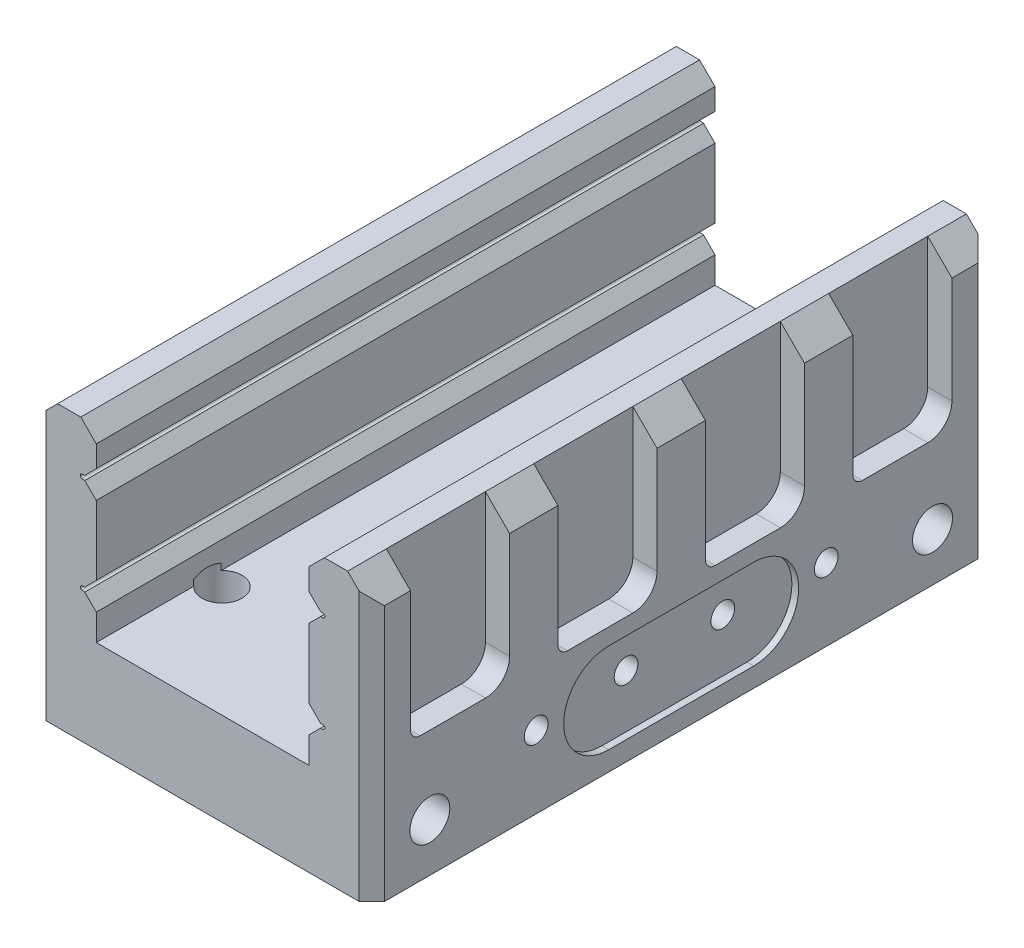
ISO-10303-21;
HEADER;
FILE_DESCRIPTION(('STEP AP214'),'2;1');
FILE_NAME('part.step','',(''),(''),'','','');
FILE_SCHEMA(('AUTOMOTIVE_DESIGN { 1 0 10303 214 1 1 1 1 }'));
ENDSEC;
DATA;
#1=APPLICATION_CONTEXT('core data for automotive mechanical design processes');
#2=APPLICATION_PROTOCOL_DEFINITION('international standard','automotive_design',2000,#1);
#3=PRODUCT_CONTEXT('',#1,'mechanical');
#4=PRODUCT('Part','Part','',(#3));
#5=PRODUCT_RELATED_PRODUCT_CATEGORY('part','',(#4));
#6=PRODUCT_DEFINITION_FORMATION('','',#4);
#7=PRODUCT_DEFINITION_CONTEXT('part definition',#1,'design');
#8=PRODUCT_DEFINITION('design','',#6,#7);
#9=PRODUCT_DEFINITION_SHAPE('','',#8);
#10=(LENGTH_UNIT() NAMED_UNIT(*) SI_UNIT(.MILLI.,.METRE.));
#11=(NAMED_UNIT(*) PLANE_ANGLE_UNIT() SI_UNIT($,.RADIAN.));
#12=(NAMED_UNIT(*) SI_UNIT($,.STERADIAN.) SOLID_ANGLE_UNIT());
#13=UNCERTAINTY_MEASURE_WITH_UNIT(LENGTH_MEASURE(1.E-05),#10,'distance_accuracy_value','');
#14=(GEOMETRIC_REPRESENTATION_CONTEXT(3) GLOBAL_UNCERTAINTY_ASSIGNED_CONTEXT((#13)) GLOBAL_UNIT_ASSIGNED_CONTEXT((#10,
#11,#12)) REPRESENTATION_CONTEXT('',''));
#15=CARTESIAN_POINT('',(0.,0.,0.));
#16=DIRECTION('',(0.,0.,1.));
#17=DIRECTION('',(1.,0.,0.));
#18=AXIS2_PLACEMENT_3D('',#15,#16,#17);
#19=CARTESIAN_POINT('',(-17.5,26.5,28.));
#20=DIRECTION('',(-0.707106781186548,0.707106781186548,0.));
#21=DIRECTION('',(0.,0.,1.));
#22=AXIS2_PLACEMENT_3D('',#19,#20,#21);
#23=PLANE('',#22);
#24=DIRECTION('',(-0.707106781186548,-0.707106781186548,0.));
#25=VECTOR('',#24,1.);
#26=CARTESIAN_POINT('',(-15.,29.,28.));
#27=LINE('',#26,#25);
#28=CARTESIAN_POINT('',(-17.5,26.5,28.));
#29=VERTEX_POINT('',#28);
#30=CARTESIAN_POINT('',(-15.,29.,28.));
#31=VERTEX_POINT('',#30);
#32=EDGE_CURVE('E621',#29,#31,#27,.F.);
#33=ORIENTED_EDGE('',*,*,#32,.F.);
#34=DIRECTION('',(0.,0.,1.));
#35=VECTOR('',#34,1.);
#36=CARTESIAN_POINT('',(-17.5,26.5,28.));
#37=LINE('',#36,#35);
#38=CARTESIAN_POINT('',(-17.5,26.5,30.7));
#39=VERTEX_POINT('',#38);
#40=EDGE_CURVE('E634',#39,#29,#37,.F.);
#41=ORIENTED_EDGE('',*,*,#40,.F.);
#42=DIRECTION('',(0.577350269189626,0.577350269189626,0.577350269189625));
#43=VECTOR('',#42,1.);
#44=CARTESIAN_POINT('',(-17.5,26.5,30.7));
#45=LINE('',#44,#43);
#46=CARTESIAN_POINT('',(-16.2,27.8,32.));
#47=VERTEX_POINT('',#46);
#48=EDGE_CURVE('E644',#39,#47,#45,.T.);
#49=ORIENTED_EDGE('',*,*,#48,.T.);
#50=DIRECTION('',(0.707106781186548,0.707106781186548,0.));
#51=VECTOR('',#50,1.);
#52=CARTESIAN_POINT('',(-16.2,27.8,32.));
#53=LINE('',#52,#51);
#54=CARTESIAN_POINT('',(-15.,29.,32.));
#55=VERTEX_POINT('',#54);
#56=EDGE_CURVE('E646',#55,#47,#53,.F.);
#57=ORIENTED_EDGE('',*,*,#56,.F.);
#58=DIRECTION('',(0.,0.,-1.));
#59=VECTOR('',#58,1.);
#60=CARTESIAN_POINT('',(-15.,29.,32.));
#61=LINE('',#60,#59);
#62=EDGE_CURVE('E637',#55,#31,#61,.T.);
#63=ORIENTED_EDGE('',*,*,#62,.T.);
#64=EDGE_LOOP('',(#33,#41,#49,#57,#63));
#65=FACE_BOUND('',#64,.T.);
#66=ADVANCED_FACE('F17',(#65),#23,.T.);
#67=CARTESIAN_POINT('',(-17.5,26.5,12.75));
#68=DIRECTION('',(-0.707106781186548,0.707106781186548,0.));
#69=DIRECTION('',(0.,0.,1.));
#70=AXIS2_PLACEMENT_3D('',#67,#68,#69);
#71=PLANE('',#70);
#72=DIRECTION('',(0.707106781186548,0.707106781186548,0.));
#73=VECTOR('',#72,1.);
#74=CARTESIAN_POINT('',(-17.5,26.5,17.75));
#75=LINE('',#74,#73);
#76=CARTESIAN_POINT('',(-15.,29.,17.75));
#77=VERTEX_POINT('',#76);
#78=CARTESIAN_POINT('',(-17.5,26.5,17.75));
#79=VERTEX_POINT('',#78);
#80=EDGE_CURVE('E660',#77,#79,#75,.F.);
#81=ORIENTED_EDGE('',*,*,#80,.F.);
#82=DIRECTION('',(0.,0.,-1.));
#83=VECTOR('',#82,1.);
#84=CARTESIAN_POINT('',(-15.,29.,17.75));
#85=LINE('',#84,#83);
#86=CARTESIAN_POINT('',(-15.,29.,12.75));
#87=VERTEX_POINT('',#86);
#88=EDGE_CURVE('E664',#77,#87,#85,.T.);
#89=ORIENTED_EDGE('',*,*,#88,.T.);
#90=DIRECTION('',(-0.707106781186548,-0.707106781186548,0.));
#91=VECTOR('',#90,1.);
#92=CARTESIAN_POINT('',(-15.,29.,12.75));
#93=LINE('',#92,#91);
#94=CARTESIAN_POINT('',(-17.5,26.5,12.75));
#95=VERTEX_POINT('',#94);
#96=EDGE_CURVE('E669',#95,#87,#93,.F.);
#97=ORIENTED_EDGE('',*,*,#96,.F.);
#98=DIRECTION('',(0.,0.,1.));
#99=VECTOR('',#98,1.);
#100=CARTESIAN_POINT('',(-17.5,26.5,12.75));
#101=LINE('',#100,#99);
#102=EDGE_CURVE('E674',#79,#95,#101,.F.);
#103=ORIENTED_EDGE('',*,*,#102,.F.);
#104=EDGE_LOOP('',(#81,#89,#97,#103));
#105=FACE_BOUND('',#104,.T.);
#106=ADVANCED_FACE('F2126',(#105),#71,.T.);
#107=CARTESIAN_POINT('',(-17.5,26.5,-2.5));
#108=DIRECTION('',(-0.707106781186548,0.707106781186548,0.));
#109=DIRECTION('',(0.,0.,1.));
#110=AXIS2_PLACEMENT_3D('',#107,#108,#109);
#111=PLANE('',#110);
#112=DIRECTION('',(-0.707106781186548,-0.707106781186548,0.));
#113=VECTOR('',#112,1.);
#114=CARTESIAN_POINT('',(-15.,29.,-2.5));
#115=LINE('',#114,#113);
#116=CARTESIAN_POINT('',(-17.5,26.5,-2.5));
#117=VERTEX_POINT('',#116);
#118=CARTESIAN_POINT('',(-15.,29.,-2.5));
#119=VERTEX_POINT('',#118);
#120=EDGE_CURVE('E679',#117,#119,#115,.F.);
#121=ORIENTED_EDGE('',*,*,#120,.F.);
#122=DIRECTION('',(0.,0.,1.));
#123=VECTOR('',#122,1.);
#124=CARTESIAN_POINT('',(-17.5,26.5,-2.5));
#125=LINE('',#124,#123);
#126=CARTESIAN_POINT('',(-17.5,26.5,2.5));
#127=VERTEX_POINT('',#126);
#128=EDGE_CURVE('E684',#127,#117,#125,.F.);
#129=ORIENTED_EDGE('',*,*,#128,.F.);
#130=DIRECTION('',(0.707106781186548,0.707106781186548,0.));
#131=VECTOR('',#130,1.);
#132=CARTESIAN_POINT('',(-17.5,26.5,2.5));
#133=LINE('',#132,#131);
#134=CARTESIAN_POINT('',(-15.,29.,2.5));
#135=VERTEX_POINT('',#134);
#136=EDGE_CURVE('E689',#135,#127,#133,.F.);
#137=ORIENTED_EDGE('',*,*,#136,.F.);
#138=DIRECTION('',(0.,0.,-1.));
#139=VECTOR('',#138,1.);
#140=CARTESIAN_POINT('',(-15.,29.,2.5));
#141=LINE('',#140,#139);
#142=EDGE_CURVE('E693',#135,#119,#141,.T.);
#143=ORIENTED_EDGE('',*,*,#142,.T.);
#144=EDGE_LOOP('',(#121,#129,#137,#143));
#145=FACE_BOUND('',#144,.T.);
#146=ADVANCED_FACE('F2131',(#145),#111,.T.);
#147=CARTESIAN_POINT('',(-17.5,26.5,-17.75));
#148=DIRECTION('',(-0.707106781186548,0.707106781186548,0.));
#149=DIRECTION('',(0.,0.,1.));
#150=AXIS2_PLACEMENT_3D('',#147,#148,#149);
#151=PLANE('',#150);
#152=DIRECTION('',(0.707106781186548,0.707106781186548,0.));
#153=VECTOR('',#152,1.);
#154=CARTESIAN_POINT('',(-17.5,26.5,-12.75));
#155=LINE('',#154,#153);
#156=CARTESIAN_POINT('',(-15.,29.,-12.75));
#157=VERTEX_POINT('',#156);
#158=CARTESIAN_POINT('',(-17.5,26.5,-12.75));
#159=VERTEX_POINT('',#158);
#160=EDGE_CURVE('E698',#157,#159,#155,.F.);
#161=ORIENTED_EDGE('',*,*,#160,.F.);
#162=DIRECTION('',(0.,0.,-1.));
#163=VECTOR('',#162,1.);
#164=CARTESIAN_POINT('',(-15.,29.,-12.75));
#165=LINE('',#164,#163);
#166=CARTESIAN_POINT('',(-15.,29.,-17.75));
#167=VERTEX_POINT('',#166);
#168=EDGE_CURVE('E702',#157,#167,#165,.T.);
#169=ORIENTED_EDGE('',*,*,#168,.T.);
#170=DIRECTION('',(-0.707106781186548,-0.707106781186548,0.));
#171=VECTOR('',#170,1.);
#172=CARTESIAN_POINT('',(-15.,29.,-17.75));
#173=LINE('',#172,#171);
#174=CARTESIAN_POINT('',(-17.5,26.5,-17.75));
#175=VERTEX_POINT('',#174);
#176=EDGE_CURVE('E707',#175,#167,#173,.F.);
#177=ORIENTED_EDGE('',*,*,#176,.F.);
#178=DIRECTION('',(0.,0.,1.));
#179=VECTOR('',#178,1.);
#180=CARTESIAN_POINT('',(-17.5,26.5,-17.75));
#181=LINE('',#180,#179);
#182=EDGE_CURVE('E712',#159,#175,#181,.F.);
#183=ORIENTED_EDGE('',*,*,#182,.F.);
#184=EDGE_LOOP('',(#161,#169,#177,#183));
#185=FACE_BOUND('',#184,.T.);
#186=ADVANCED_FACE('F2137',(#185),#151,.T.);
#187=CARTESIAN_POINT('',(-17.5,26.5,-32.));
#188=DIRECTION('',(-0.707106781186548,0.707106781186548,0.));
#189=DIRECTION('',(0.,0.,1.));
#190=AXIS2_PLACEMENT_3D('',#187,#188,#189);
#191=PLANE('',#190);
#192=DIRECTION('',(0.707106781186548,0.707106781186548,0.));
#193=VECTOR('',#192,1.);
#194=CARTESIAN_POINT('',(-17.5,26.5,-28.));
#195=LINE('',#194,#193);
#196=CARTESIAN_POINT('',(-15.,29.,-28.));
#197=VERTEX_POINT('',#196);
#198=CARTESIAN_POINT('',(-17.5,26.5,-28.));
#199=VERTEX_POINT('',#198);
#200=EDGE_CURVE('E717',#197,#199,#195,.F.);
#201=ORIENTED_EDGE('',*,*,#200,.F.);
#202=DIRECTION('',(0.,0.,-1.));
#203=VECTOR('',#202,1.);
#204=CARTESIAN_POINT('',(-15.,29.,-28.));
#205=LINE('',#204,#203);
#206=CARTESIAN_POINT('',(-15.,29.,-32.));
#207=VERTEX_POINT('',#206);
#208=EDGE_CURVE('E721',#197,#207,#205,.T.);
#209=ORIENTED_EDGE('',*,*,#208,.T.);
#210=DIRECTION('',(-0.707106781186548,-0.707106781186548,0.));
#211=VECTOR('',#210,1.);
#212=CARTESIAN_POINT('',(-15.,29.,-32.));
#213=LINE('',#212,#211);
#214=CARTESIAN_POINT('',(-16.2,27.8,-32.));
#215=VERTEX_POINT('',#214);
#216=EDGE_CURVE('E726',#207,#215,#213,.T.);
#217=ORIENTED_EDGE('',*,*,#216,.T.);
#218=DIRECTION('',(-0.577350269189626,-0.577350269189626,0.577350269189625));
#219=VECTOR('',#218,1.);
#220=CARTESIAN_POINT('',(-16.2,27.8,-32.));
#221=LINE('',#220,#219);
#222=CARTESIAN_POINT('',(-17.5,26.5,-30.7));
#223=VERTEX_POINT('',#222);
#224=EDGE_CURVE('E731',#215,#223,#221,.T.);
#225=ORIENTED_EDGE('',*,*,#224,.T.);
#226=DIRECTION('',(0.,0.,1.));
#227=VECTOR('',#226,1.);
#228=CARTESIAN_POINT('',(-17.5,26.5,-30.7));
#229=LINE('',#228,#227);
#230=EDGE_CURVE('E628',#199,#223,#229,.F.);
#231=ORIENTED_EDGE('',*,*,#230,.F.);
#232=EDGE_LOOP('',(#201,#209,#217,#225,#231));
#233=FACE_BOUND('',#232,.T.);
#234=ADVANCED_FACE('F2141',(#233),#191,.T.);
#235=CARTESIAN_POINT('',(-17.5,0.,30.7));
#236=DIRECTION('',(-1.,0.,0.));
#237=DIRECTION('',(0.,1.,0.));
#238=AXIS2_PLACEMENT_3D('',#235,#236,#237);
#239=PLANE('',#238);
#240=DIRECTION('',(0.,-1.,0.));
#241=VECTOR('',#240,1.);
#242=CARTESIAN_POINT('',(-17.5,26.5,28.));
#243=LINE('',#242,#241);
#244=CARTESIAN_POINT('',(-17.5,14.,28.));
#245=VERTEX_POINT('',#244);
#246=EDGE_CURVE('E617',#29,#245,#243,.T.);
#247=ORIENTED_EDGE('',*,*,#246,.T.);
#248=CARTESIAN_POINT('',(-17.5,13.9999999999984,27.0000000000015));
#249=DIRECTION('',(1.,0.,0.));
#250=DIRECTION('',(0.,1.56319401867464E-12,1.));
#251=AXIS2_PLACEMENT_3D('',#248,#249,#250);
#252=CIRCLE('',#251,0.99999999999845);
#253=CARTESIAN_POINT('',(-17.5,13.,27.0000000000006));
#254=VERTEX_POINT('',#253);
#255=EDGE_CURVE('E627',#245,#254,#252,.T.);
#256=ORIENTED_EDGE('',*,*,#255,.T.);
#257=DIRECTION('',(0.,0.,-1.));
#258=VECTOR('',#257,1.);
#259=CARTESIAN_POINT('',(-17.5,13.,27.0000000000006));
#260=LINE('',#259,#258);
#261=CARTESIAN_POINT('',(-17.5,13.,20.25));
#262=VERTEX_POINT('',#261);
#263=EDGE_CURVE('E745',#254,#262,#260,.T.);
#264=ORIENTED_EDGE('',*,*,#263,.T.);
#265=CARTESIAN_POINT('',(-17.5,15.5000000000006,20.2500000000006));
#266=DIRECTION('',(1.,0.,0.));
#267=DIRECTION('',(0.,-1.,-2.40163444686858E-13));
#268=AXIS2_PLACEMENT_3D('',#265,#266,#267);
#269=CIRCLE('',#268,2.50000000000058);
#270=CARTESIAN_POINT('',(-17.5,15.5000000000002,17.75));
#271=VERTEX_POINT('',#270);
#272=EDGE_CURVE('E750',#262,#271,#269,.T.);
#273=ORIENTED_EDGE('',*,*,#272,.T.);
#274=DIRECTION('',(0.,1.,0.));
#275=VECTOR('',#274,1.);
#276=CARTESIAN_POINT('',(-17.5,15.5000000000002,17.75));
#277=LINE('',#276,#275);
#278=EDGE_CURVE('E755',#271,#79,#277,.T.);
#279=ORIENTED_EDGE('',*,*,#278,.T.);
#280=ORIENTED_EDGE('',*,*,#102,.T.);
#281=DIRECTION('',(0.,-1.,0.));
#282=VECTOR('',#281,1.);
#283=CARTESIAN_POINT('',(-17.5,26.5,12.75));
#284=LINE('',#283,#282);
#285=CARTESIAN_POINT('',(-17.5,13.9999999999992,12.75));
#286=VERTEX_POINT('',#285);
#287=EDGE_CURVE('E760',#95,#286,#284,.T.);
#288=ORIENTED_EDGE('',*,*,#287,.T.);
#289=CARTESIAN_POINT('',(-17.5,13.9999999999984,11.7500000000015));
#290=DIRECTION('',(1.,0.,0.));
#291=DIRECTION('',(0.,7.79820652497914E-13,1.));
#292=AXIS2_PLACEMENT_3D('',#289,#290,#291);
#293=CIRCLE('',#292,0.99999999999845);
#294=CARTESIAN_POINT('',(-17.5,13.,11.7500000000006));
#295=VERTEX_POINT('',#294);
#296=EDGE_CURVE('E765',#286,#295,#293,.T.);
#297=ORIENTED_EDGE('',*,*,#296,.T.);
#298=DIRECTION('',(0.,0.,-1.));
#299=VECTOR('',#298,1.);
#300=CARTESIAN_POINT('',(-17.5,13.,11.7500000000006));
#301=LINE('',#300,#299);
#302=CARTESIAN_POINT('',(-17.5,13.,5.));
#303=VERTEX_POINT('',#302);
#304=EDGE_CURVE('E770',#295,#303,#301,.T.);
#305=ORIENTED_EDGE('',*,*,#304,.T.);
#306=CARTESIAN_POINT('',(-17.5,15.5000000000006,5.00000000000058));
#307=DIRECTION('',(1.,0.,0.));
#308=DIRECTION('',(0.,-1.,-2.31992203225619E-13));
#309=AXIS2_PLACEMENT_3D('',#306,#307,#308);
#310=CIRCLE('',#309,2.50000000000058);
#311=CARTESIAN_POINT('',(-17.5,15.5000000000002,2.5));
#312=VERTEX_POINT('',#311);
#313=EDGE_CURVE('E775',#303,#312,#310,.T.);
#314=ORIENTED_EDGE('',*,*,#313,.T.);
#315=DIRECTION('',(0.,1.,0.));
#316=VECTOR('',#315,1.);
#317=CARTESIAN_POINT('',(-17.5,15.5000000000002,2.5));
#318=LINE('',#317,#316);
#319=EDGE_CURVE('E780',#312,#127,#318,.T.);
#320=ORIENTED_EDGE('',*,*,#319,.T.);
#321=ORIENTED_EDGE('',*,*,#128,.T.);
#322=DIRECTION('',(0.,-1.,0.));
#323=VECTOR('',#322,1.);
#324=CARTESIAN_POINT('',(-17.5,26.5,-2.50000000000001));
#325=LINE('',#324,#323);
#326=CARTESIAN_POINT('',(-17.5,14.,-2.50000000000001));
#327=VERTEX_POINT('',#326);
#328=EDGE_CURVE('E785',#117,#327,#325,.T.);
#329=ORIENTED_EDGE('',*,*,#328,.T.);
#330=CARTESIAN_POINT('',(-17.5,13.9999999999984,-3.49999999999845));
#331=DIRECTION('',(1.,0.,0.));
#332=DIRECTION('',(0.,1.56319401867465E-12,1.));
#333=AXIS2_PLACEMENT_3D('',#330,#331,#332);
#334=CIRCLE('',#333,0.99999999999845);
#335=CARTESIAN_POINT('',(-17.5,13.,-3.49999999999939));
#336=VERTEX_POINT('',#335);
#337=EDGE_CURVE('E790',#327,#336,#334,.T.);
#338=ORIENTED_EDGE('',*,*,#337,.T.);
#339=DIRECTION('',(0.,0.,-1.));
#340=VECTOR('',#339,1.);
#341=CARTESIAN_POINT('',(-17.5,13.,-3.49999999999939));
#342=LINE('',#341,#340);
#343=CARTESIAN_POINT('',(-17.5,13.,-10.25));
#344=VERTEX_POINT('',#343);
#345=EDGE_CURVE('E795',#336,#344,#342,.T.);
#346=ORIENTED_EDGE('',*,*,#345,.T.);
#347=CARTESIAN_POINT('',(-17.5,15.5000000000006,-10.2499999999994));
#348=DIRECTION('',(1.,0.,0.));
#349=DIRECTION('',(0.,-1.,-2.32347474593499E-13));
#350=AXIS2_PLACEMENT_3D('',#347,#348,#349);
#351=CIRCLE('',#350,2.50000000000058);
#352=CARTESIAN_POINT('',(-17.5,15.5000000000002,-12.75));
#353=VERTEX_POINT('',#352);
#354=EDGE_CURVE('E800',#344,#353,#351,.T.);
#355=ORIENTED_EDGE('',*,*,#354,.T.);
#356=DIRECTION('',(0.,1.,0.));
#357=VECTOR('',#356,1.);
#358=CARTESIAN_POINT('',(-17.5,15.5000000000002,-12.75));
#359=LINE('',#358,#357);
#360=EDGE_CURVE('E805',#353,#159,#359,.T.);
#361=ORIENTED_EDGE('',*,*,#360,.T.);
#362=ORIENTED_EDGE('',*,*,#182,.T.);
#363=DIRECTION('',(0.,-1.,0.));
#364=VECTOR('',#363,1.);
#365=CARTESIAN_POINT('',(-17.5,26.5,-17.75));
#366=LINE('',#365,#364);
#367=CARTESIAN_POINT('',(-17.5,14.,-17.75));
#368=VERTEX_POINT('',#367);
#369=EDGE_CURVE('E810',#175,#368,#366,.T.);
#370=ORIENTED_EDGE('',*,*,#369,.T.);
#371=CARTESIAN_POINT('',(-17.5,13.9999999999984,-18.7499999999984));
#372=DIRECTION('',(1.,0.,0.));
#373=DIRECTION('',(0.,1.56319401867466E-12,1.));
#374=AXIS2_PLACEMENT_3D('',#371,#372,#373);
#375=CIRCLE('',#374,0.99999999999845);
#376=CARTESIAN_POINT('',(-17.5,13.,-18.7499999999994));
#377=VERTEX_POINT('',#376);
#378=EDGE_CURVE('E815',#368,#377,#375,.T.);
#379=ORIENTED_EDGE('',*,*,#378,.T.);
#380=DIRECTION('',(0.,0.,-1.));
#381=VECTOR('',#380,1.);
#382=CARTESIAN_POINT('',(-17.5,13.,-18.7499999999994));
#383=LINE('',#382,#381);
#384=CARTESIAN_POINT('',(-17.5,13.,-25.5));
#385=VERTEX_POINT('',#384);
#386=EDGE_CURVE('E820',#377,#385,#383,.T.);
#387=ORIENTED_EDGE('',*,*,#386,.T.);
#388=CARTESIAN_POINT('',(-17.5,15.5000000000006,-25.4999999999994));
#389=DIRECTION('',(1.,0.,0.));
#390=DIRECTION('',(0.,-1.,-2.35900188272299E-13));
#391=AXIS2_PLACEMENT_3D('',#388,#389,#390);
#392=CIRCLE('',#391,2.50000000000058);
#393=CARTESIAN_POINT('',(-17.5,15.5000000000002,-28.));
#394=VERTEX_POINT('',#393);
#395=EDGE_CURVE('E825',#385,#394,#392,.T.);
#396=ORIENTED_EDGE('',*,*,#395,.T.);
#397=DIRECTION('',(0.,1.,0.));
#398=VECTOR('',#397,1.);
#399=CARTESIAN_POINT('',(-17.5,15.5000000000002,-28.));
#400=LINE('',#399,#398);
#401=EDGE_CURVE('E830',#394,#199,#400,.T.);
#402=ORIENTED_EDGE('',*,*,#401,.T.);
#403=ORIENTED_EDGE('',*,*,#230,.T.);
#404=DIRECTION('',(0.,-1.,0.));
#405=VECTOR('',#404,1.);
#406=CARTESIAN_POINT('',(-17.5,26.5,-30.7));
#407=LINE('',#406,#405);
#408=CARTESIAN_POINT('',(-17.5,0.,-30.7));
#409=VERTEX_POINT('',#408);
#410=EDGE_CURVE('E835',#223,#409,#407,.T.);
#411=ORIENTED_EDGE('',*,*,#410,.T.);
#412=DIRECTION('',(0.,0.,1.));
#413=VECTOR('',#412,1.);
#414=CARTESIAN_POINT('',(-17.5,0.,-30.7));
#415=LINE('',#414,#413);
#416=CARTESIAN_POINT('',(-17.5,0.,30.7));
#417=VERTEX_POINT('',#416);
#418=EDGE_CURVE('E840',#417,#409,#415,.F.);
#419=ORIENTED_EDGE('',*,*,#418,.F.);
#420=DIRECTION('',(0.,1.,0.));
#421=VECTOR('',#420,1.);
#422=CARTESIAN_POINT('',(-17.5,0.,30.7));
#423=LINE('',#422,#421);
#424=EDGE_CURVE('E643',#39,#417,#423,.F.);
#425=ORIENTED_EDGE('',*,*,#424,.F.);
#426=ORIENTED_EDGE('',*,*,#40,.T.);
#427=EDGE_LOOP('',(#247,#256,#264,#273,#279,#280,#288,#297,#305,#314,#320,#321,#329,#338,#346,
#355,#361,#362,#370,#379,#387,#396,#402,#403,#411,#419,#425,#426));
#428=FACE_BOUND('',#427,.T.);
#429=CARTESIAN_POINT('',(-17.5,5.,26.));
#430=DIRECTION('',(1.,0.,0.));
#431=DIRECTION('',(0.,-1.42053862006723E-07,0.99999999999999));
#432=AXIS2_PLACEMENT_3D('',#429,#430,#431);
#433=CIRCLE('',#432,4.);
#434=CARTESIAN_POINT('',(-17.5,4.99999943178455,30.));
#435=VERTEX_POINT('',#434);
#436=EDGE_CURVE('E848',#435,#435,#433,.T.);
#437=ORIENTED_EDGE('',*,*,#436,.T.);
#438=EDGE_LOOP('',(#437));
#439=FACE_BOUND('',#438,.T.);
#440=CARTESIAN_POINT('',(-17.5,5.,-26.));
#441=DIRECTION('',(1.,0.,0.));
#442=DIRECTION('',(0.,0.,1.));
#443=AXIS2_PLACEMENT_3D('',#440,#441,#442);
#444=CIRCLE('',#443,4.);
#445=CARTESIAN_POINT('',(-17.5,5.,-22.));
#446=VERTEX_POINT('',#445);
#447=EDGE_CURVE('E853',#446,#446,#444,.T.);
#448=ORIENTED_EDGE('',*,*,#447,.T.);
#449=EDGE_LOOP('',(#448));
#450=FACE_BOUND('',#449,.T.);
#451=ADVANCED_FACE('F640',(#428,#439,#450),#239,.T.);
#452=CARTESIAN_POINT('',(15.,29.,28.));
#453=DIRECTION('',(0.707106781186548,0.707106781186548,0.));
#454=DIRECTION('',(0.,0.,1.));
#455=AXIS2_PLACEMENT_3D('',#452,#453,#454);
#456=PLANE('',#455);
#457=DIRECTION('',(0.,0.,-1.));
#458=VECTOR('',#457,1.);
#459=CARTESIAN_POINT('',(17.5,26.5,30.7));
#460=LINE('',#459,#458);
#461=CARTESIAN_POINT('',(17.5,26.5,30.7));
#462=VERTEX_POINT('',#461);
#463=CARTESIAN_POINT('',(17.5,26.5,28.));
#464=VERTEX_POINT('',#463);
#465=EDGE_CURVE('E856',#462,#464,#460,.T.);
#466=ORIENTED_EDGE('',*,*,#465,.T.);
#467=DIRECTION('',(-0.707106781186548,0.707106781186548,0.));
#468=VECTOR('',#467,1.);
#469=CARTESIAN_POINT('',(17.5,26.5,28.));
#470=LINE('',#469,#468);
#471=CARTESIAN_POINT('',(15.,29.,28.));
#472=VERTEX_POINT('',#471);
#473=EDGE_CURVE('E859',#464,#472,#470,.T.);
#474=ORIENTED_EDGE('',*,*,#473,.T.);
#475=DIRECTION('',(0.,0.,1.));
#476=VECTOR('',#475,1.);
#477=CARTESIAN_POINT('',(15.,29.,28.));
#478=LINE('',#477,#476);
#479=CARTESIAN_POINT('',(15.,29.,32.));
#480=VERTEX_POINT('',#479);
#481=EDGE_CURVE('E864',#480,#472,#478,.F.);
#482=ORIENTED_EDGE('',*,*,#481,.F.);
#483=DIRECTION('',(0.707106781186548,-0.707106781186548,0.));
#484=VECTOR('',#483,1.);
#485=CARTESIAN_POINT('',(15.,29.,32.));
#486=LINE('',#485,#484);
#487=CARTESIAN_POINT('',(16.2,27.8,32.));
#488=VERTEX_POINT('',#487);
#489=EDGE_CURVE('E869',#488,#480,#486,.F.);
#490=ORIENTED_EDGE('',*,*,#489,.F.);
#491=DIRECTION('',(0.577350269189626,-0.577350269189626,-0.577350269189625));
#492=VECTOR('',#491,1.);
#493=CARTESIAN_POINT('',(16.2,27.8,32.));
#494=LINE('',#493,#492);
#495=EDGE_CURVE('E873',#488,#462,#494,.T.);
#496=ORIENTED_EDGE('',*,*,#495,.T.);
#497=EDGE_LOOP('',(#466,#474,#482,#490,#496));
#498=FACE_BOUND('',#497,.T.);
#499=ADVANCED_FACE('F2148',(#498),#456,.T.);
#500=CARTESIAN_POINT('',(15.,29.,-2.5));
#501=DIRECTION('',(0.707106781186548,0.707106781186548,0.));
#502=DIRECTION('',(0.,0.,1.));
#503=AXIS2_PLACEMENT_3D('',#500,#501,#502);
#504=PLANE('',#503);
#505=DIRECTION('',(0.,0.,-1.));
#506=VECTOR('',#505,1.);
#507=CARTESIAN_POINT('',(17.5,26.5,2.5));
#508=LINE('',#507,#506);
#509=CARTESIAN_POINT('',(17.5,26.5,2.5));
#510=VERTEX_POINT('',#509);
#511=CARTESIAN_POINT('',(17.5,26.5,-2.5));
#512=VERTEX_POINT('',#511);
#513=EDGE_CURVE('E878',#510,#512,#508,.T.);
#514=ORIENTED_EDGE('',*,*,#513,.T.);
#515=DIRECTION('',(-0.707106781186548,0.707106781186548,0.));
#516=VECTOR('',#515,1.);
#517=CARTESIAN_POINT('',(17.5,26.5,-2.5));
#518=LINE('',#517,#516);
#519=CARTESIAN_POINT('',(15.,29.,-2.5));
#520=VERTEX_POINT('',#519);
#521=EDGE_CURVE('E883',#512,#520,#518,.T.);
#522=ORIENTED_EDGE('',*,*,#521,.T.);
#523=DIRECTION('',(0.,0.,1.));
#524=VECTOR('',#523,1.);
#525=CARTESIAN_POINT('',(15.,29.,-2.5));
#526=LINE('',#525,#524);
#527=CARTESIAN_POINT('',(15.,29.,2.5));
#528=VERTEX_POINT('',#527);
#529=EDGE_CURVE('E888',#528,#520,#526,.F.);
#530=ORIENTED_EDGE('',*,*,#529,.F.);
#531=DIRECTION('',(0.707106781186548,-0.707106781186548,0.));
#532=VECTOR('',#531,1.);
#533=CARTESIAN_POINT('',(15.,29.,2.5));
#534=LINE('',#533,#532);
#535=EDGE_CURVE('E893',#528,#510,#534,.T.);
#536=ORIENTED_EDGE('',*,*,#535,.T.);
#537=EDGE_LOOP('',(#514,#522,#530,#536));
#538=FACE_BOUND('',#537,.T.);
#539=ADVANCED_FACE('F2151',(#538),#504,.T.);
#540=CARTESIAN_POINT('',(15.,29.,-17.75));
#541=DIRECTION('',(0.707106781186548,0.707106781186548,0.));
#542=DIRECTION('',(0.,0.,1.));
#543=AXIS2_PLACEMENT_3D('',#540,#541,#542);
#544=PLANE('',#543);
#545=DIRECTION('',(0.,0.,1.));
#546=VECTOR('',#545,1.);
#547=CARTESIAN_POINT('',(15.,29.,-17.75));
#548=LINE('',#547,#546);
#549=CARTESIAN_POINT('',(15.,29.,-12.75));
#550=VERTEX_POINT('',#549);
#551=CARTESIAN_POINT('',(15.,29.,-17.75));
#552=VERTEX_POINT('',#551);
#553=EDGE_CURVE('E898',#550,#552,#548,.F.);
#554=ORIENTED_EDGE('',*,*,#553,.F.);
#555=DIRECTION('',(0.707106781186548,-0.707106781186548,0.));
#556=VECTOR('',#555,1.);
#557=CARTESIAN_POINT('',(15.,29.,-12.75));
#558=LINE('',#557,#556);
#559=CARTESIAN_POINT('',(17.5,26.5,-12.75));
#560=VERTEX_POINT('',#559);
#561=EDGE_CURVE('E903',#550,#560,#558,.T.);
#562=ORIENTED_EDGE('',*,*,#561,.T.);
#563=DIRECTION('',(0.,0.,-1.));
#564=VECTOR('',#563,1.);
#565=CARTESIAN_POINT('',(17.5,26.5,-12.75));
#566=LINE('',#565,#564);
#567=CARTESIAN_POINT('',(17.5,26.5,-17.75));
#568=VERTEX_POINT('',#567);
#569=EDGE_CURVE('E908',#560,#568,#566,.T.);
#570=ORIENTED_EDGE('',*,*,#569,.T.);
#571=DIRECTION('',(-0.707106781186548,0.707106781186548,0.));
#572=VECTOR('',#571,1.);
#573=CARTESIAN_POINT('',(17.5,26.5,-17.75));
#574=LINE('',#573,#572);
#575=EDGE_CURVE('E913',#568,#552,#574,.T.);
#576=ORIENTED_EDGE('',*,*,#575,.T.);
#577=EDGE_LOOP('',(#554,#562,#570,#576));
#578=FACE_BOUND('',#577,.T.);
#579=ADVANCED_FACE('F2154',(#578),#544,.T.);
#580=CARTESIAN_POINT('',(15.,29.,12.75));
#581=DIRECTION('',(0.707106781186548,0.707106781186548,0.));
#582=DIRECTION('',(0.,0.,1.));
#583=AXIS2_PLACEMENT_3D('',#580,#581,#582);
#584=PLANE('',#583);
#585=DIRECTION('',(0.,0.,1.));
#586=VECTOR('',#585,1.);
#587=CARTESIAN_POINT('',(15.,29.,12.75));
#588=LINE('',#587,#586);
#589=CARTESIAN_POINT('',(15.,29.,17.75));
#590=VERTEX_POINT('',#589);
#591=CARTESIAN_POINT('',(15.,29.,12.75));
#592=VERTEX_POINT('',#591);
#593=EDGE_CURVE('E918',#590,#592,#588,.F.);
#594=ORIENTED_EDGE('',*,*,#593,.F.);
#595=DIRECTION('',(0.707106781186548,-0.707106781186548,0.));
#596=VECTOR('',#595,1.);
#597=CARTESIAN_POINT('',(15.,29.,17.75));
#598=LINE('',#597,#596);
#599=CARTESIAN_POINT('',(17.5,26.5,17.75));
#600=VERTEX_POINT('',#599);
#601=EDGE_CURVE('E923',#590,#600,#598,.T.);
#602=ORIENTED_EDGE('',*,*,#601,.T.);
#603=DIRECTION('',(0.,0.,-1.));
#604=VECTOR('',#603,1.);
#605=CARTESIAN_POINT('',(17.5,26.5,17.75));
#606=LINE('',#605,#604);
#607=CARTESIAN_POINT('',(17.5,26.5,12.75));
#608=VERTEX_POINT('',#607);
#609=EDGE_CURVE('E928',#600,#608,#606,.T.);
#610=ORIENTED_EDGE('',*,*,#609,.T.);
#611=DIRECTION('',(-0.707106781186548,0.707106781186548,0.));
#612=VECTOR('',#611,1.);
#613=CARTESIAN_POINT('',(17.5,26.5,12.75));
#614=LINE('',#613,#612);
#615=EDGE_CURVE('E933',#608,#592,#614,.T.);
#616=ORIENTED_EDGE('',*,*,#615,.T.);
#617=EDGE_LOOP('',(#594,#602,#610,#616));
#618=FACE_BOUND('',#617,.T.);
#619=ADVANCED_FACE('F972',(#618),#584,.T.);
#620=CARTESIAN_POINT('',(11.,9.6,-32.));
#621=DIRECTION('',(-1.,0.,0.));
#622=DIRECTION('',(0.,0.,1.));
#623=AXIS2_PLACEMENT_3D('',#620,#621,#622);
#624=PLANE('',#623);
#625=DIRECTION('',(0.,0.,1.));
#626=VECTOR('',#625,1.);
#627=CARTESIAN_POINT('',(11.,9.6,-32.));
#628=LINE('',#627,#626);
#629=CARTESIAN_POINT('',(11.,9.6,-21.9221423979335));
#630=VERTEX_POINT('',#629);
#631=CARTESIAN_POINT('',(11.,9.6,-32.));
#632=VERTEX_POINT('',#631);
#633=EDGE_CURVE('E938',#630,#632,#628,.F.);
#634=ORIENTED_EDGE('',*,*,#633,.F.);
#635=DIRECTION('',(0.,0.999999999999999,-5.16549606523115E-08));
#636=VECTOR('',#635,1.);
#637=CARTESIAN_POINT('',(11.,9.6,-21.9221423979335));
#638=LINE('',#637,#636);
#639=CARTESIAN_POINT('',(11.,10.26017262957,-21.9221424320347));
#640=VERTEX_POINT('',#639);
#641=EDGE_CURVE('E942',#630,#640,#638,.T.);
#642=ORIENTED_EDGE('',*,*,#641,.T.);
#643=CARTESIAN_POINT('',(11.,10.26017262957,-21.9221424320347));
#644=CARTESIAN_POINT('',(11.,10.3348668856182,-21.7414621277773));
#645=CARTESIAN_POINT('',(11.,10.4034871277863,-21.5580945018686));
#646=CARTESIAN_POINT('',(11.,10.4951984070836,-21.2541083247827));
#647=CARTESIAN_POINT('',(11.,10.5270796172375,-21.133072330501));
#648=CARTESIAN_POINT('',(11.,10.5674948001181,-20.9182658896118));
#649=CARTESIAN_POINT('',(11.,10.5826835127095,-20.8220434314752));
#650=CARTESIAN_POINT('',(11.,10.5942560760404,-20.6821676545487));
#651=CARTESIAN_POINT('',(11.,10.5961999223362,-20.6532126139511));
#652=CARTESIAN_POINT('',(11.,10.5991358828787,-20.593470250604));
#653=CARTESIAN_POINT('',(11.,10.6001279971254,-20.5626829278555));
#654=CARTESIAN_POINT('',(11.,10.6007445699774,-20.5152233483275));
#655=CARTESIAN_POINT('',(11.,10.6008048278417,-20.4991903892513));
#656=CARTESIAN_POINT('',(11.,10.6005103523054,-20.4504761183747));
#657=CARTESIAN_POINT('',(11.,10.5996803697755,-20.4171794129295));
#658=CARTESIAN_POINT('',(11.,10.5973270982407,-20.3660991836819));
#659=CARTESIAN_POINT('',(11.,10.5963579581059,-20.3488832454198));
#660=CARTESIAN_POINT('',(11.,10.5902224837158,-20.2574185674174));
#661=CARTESIAN_POINT('',(11.,10.5837090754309,-20.2014013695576));
#662=CARTESIAN_POINT('',(11.,10.5608805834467,-20.0356531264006));
#663=CARTESIAN_POINT('',(11.,10.5421199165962,-19.94368775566));
#664=CARTESIAN_POINT('',(11.,10.4724959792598,-19.6503702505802));
#665=CARTESIAN_POINT('',(11.,10.4103722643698,-19.465645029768));
#666=CARTESIAN_POINT('',(11.,10.3179134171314,-19.2202707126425));
#667=CARTESIAN_POINT('',(11.,10.2895328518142,-19.1488779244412));
#668=CARTESIAN_POINT('',(11.,10.2601726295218,-19.0778575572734));
#669=B_SPLINE_CURVE_WITH_KNOTS('',3,(#643,#644,#645,#646,#647,#648,#649,#650,#651,#652,#653,
#654,#655,#656,#657,#658,#659,#660,#661,#662,#663,#664,#665,#666,#667,#668),.UNSPECIFIED.,.F.,
.F.,(4,2,2,2,2,2,2,2,2,2,2,2,4),(0.,0.244155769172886,0.396482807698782,0.480677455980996,
0.501726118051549,0.522774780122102,0.533299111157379,0.554347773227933,0.564872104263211,
0.609678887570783,0.701270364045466,0.912484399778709,1.),.UNSPECIFIED.);
#670=CARTESIAN_POINT('',(11.,10.2601726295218,-19.0778575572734));
#671=VERTEX_POINT('',#670);
#672=EDGE_CURVE('E947',#640,#671,#669,.T.);
#673=ORIENTED_EDGE('',*,*,#672,.T.);
#674=DIRECTION('',(0.,-0.999999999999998,-6.78505175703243E-08));
#675=VECTOR('',#674,1.);
#676=CARTESIAN_POINT('',(11.,10.2601726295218,-19.0778575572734));
#677=LINE('',#676,#675);
#678=CARTESIAN_POINT('',(11.,9.6,-19.0778576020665));
#679=VERTEX_POINT('',#678);
#680=EDGE_CURVE('E959',#671,#679,#677,.T.);
#681=ORIENTED_EDGE('',*,*,#680,.T.);
#682=DIRECTION('',(0.,0.,1.));
#683=VECTOR('',#682,1.);
#684=CARTESIAN_POINT('',(11.,9.6,-19.0778576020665));
#685=LINE('',#684,#683);
#686=CARTESIAN_POINT('',(11.,9.6,32.));
#687=VERTEX_POINT('',#686);
#688=EDGE_CURVE('E2671',#687,#679,#685,.F.);
#689=ORIENTED_EDGE('',*,*,#688,.F.);
#690=DIRECTION('',(0.,1.,0.));
#691=VECTOR('',#690,1.);
#692=CARTESIAN_POINT('',(11.,9.6,32.));
#693=LINE('',#692,#691);
#694=CARTESIAN_POINT('',(11.,12.33,32.));
#695=VERTEX_POINT('',#694);
#696=EDGE_CURVE('E2672',#687,#695,#693,.T.);
#697=ORIENTED_EDGE('',*,*,#696,.T.);
#698=DIRECTION('',(0.,0.,-1.));
#699=VECTOR('',#698,1.);
#700=CARTESIAN_POINT('',(11.,12.33,32.));
#701=LINE('',#700,#699);
#702=CARTESIAN_POINT('',(11.,12.33,-32.));
#703=VERTEX_POINT('',#702);
#704=EDGE_CURVE('E2675',#695,#703,#701,.T.);
#705=ORIENTED_EDGE('',*,*,#704,.T.);
#706=DIRECTION('',(0.,-1.,0.));
#707=VECTOR('',#706,1.);
#708=CARTESIAN_POINT('',(11.,12.33,-32.));
#709=LINE('',#708,#707);
#710=EDGE_CURVE('E2685',#632,#703,#709,.F.);
#711=ORIENTED_EDGE('',*,*,#710,.F.);
#712=EDGE_LOOP('',(#634,#642,#673,#681,#689,#697,#705,#711));
#713=FACE_BOUND('',#712,.T.);
#714=ADVANCED_FACE('F961',(#713),#624,.T.);
#715=CARTESIAN_POINT('',(-11.,9.6,32.));
#716=DIRECTION('',(1.,0.,0.));
#717=DIRECTION('',(0.,0.,-1.));
#718=AXIS2_PLACEMENT_3D('',#715,#716,#717);
#719=PLANE('',#718);
#720=DIRECTION('',(0.,0.,-1.));
#721=VECTOR('',#720,1.);
#722=CARTESIAN_POINT('',(-11.,9.6,32.));
#723=LINE('',#722,#721);
#724=CARTESIAN_POINT('',(-11.,9.6,32.));
#725=VERTEX_POINT('',#724);
#726=CARTESIAN_POINT('',(-11.,9.6,21.9221423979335));
#727=VERTEX_POINT('',#726);
#728=EDGE_CURVE('E2690',#725,#727,#723,.T.);
#729=ORIENTED_EDGE('',*,*,#728,.T.);
#730=DIRECTION('',(0.,0.999999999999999,5.16549606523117E-08));
#731=VECTOR('',#730,1.);
#732=CARTESIAN_POINT('',(-11.,9.6,21.9221423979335));
#733=LINE('',#732,#731);
#734=CARTESIAN_POINT('',(-11.,10.26017262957,21.9221424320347));
#735=VERTEX_POINT('',#734);
#736=EDGE_CURVE('E2695',#727,#735,#733,.T.);
#737=ORIENTED_EDGE('',*,*,#736,.T.);
#738=CARTESIAN_POINT('',(-11.,10.26017262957,21.9221424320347));
#739=CARTESIAN_POINT('',(-11.,10.3348668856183,21.7414621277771));
#740=CARTESIAN_POINT('',(-11.,10.4034871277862,21.5580945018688));
#741=CARTESIAN_POINT('',(-11.,10.4951984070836,21.2541083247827));
#742=CARTESIAN_POINT('',(-11.,10.5270796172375,21.133072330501));
#743=CARTESIAN_POINT('',(-11.,10.5674948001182,20.9182658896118));
#744=CARTESIAN_POINT('',(-11.,10.5826835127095,20.8220434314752));
#745=CARTESIAN_POINT('',(-11.,10.5942560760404,20.6821676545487));
#746=CARTESIAN_POINT('',(-11.,10.5961999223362,20.6532126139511));
#747=CARTESIAN_POINT('',(-11.,10.5991358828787,20.593470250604));
#748=CARTESIAN_POINT('',(-11.,10.6001279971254,20.5626829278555));
#749=CARTESIAN_POINT('',(-11.,10.6007445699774,20.5152233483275));
#750=CARTESIAN_POINT('',(-11.,10.6008048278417,20.4991903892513));
#751=CARTESIAN_POINT('',(-11.,10.6005103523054,20.4504761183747));
#752=CARTESIAN_POINT('',(-11.,10.5996803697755,20.4171794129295));
#753=CARTESIAN_POINT('',(-11.,10.5973270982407,20.3660991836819));
#754=CARTESIAN_POINT('',(-11.,10.5963579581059,20.3488832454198));
#755=CARTESIAN_POINT('',(-11.,10.5902224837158,20.2574185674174));
#756=CARTESIAN_POINT('',(-11.,10.5837090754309,20.2014013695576));
#757=CARTESIAN_POINT('',(-11.,10.5608805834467,20.0356531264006));
#758=CARTESIAN_POINT('',(-11.,10.5421199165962,19.94368775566));
#759=CARTESIAN_POINT('',(-11.,10.4724959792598,19.6503702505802));
#760=CARTESIAN_POINT('',(-11.,10.4103722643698,19.465645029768));
#761=CARTESIAN_POINT('',(-11.,10.3179134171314,19.2202707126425));
#762=CARTESIAN_POINT('',(-11.,10.2895328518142,19.1488779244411));
#763=CARTESIAN_POINT('',(-11.,10.2601726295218,19.0778575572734));
#764=B_SPLINE_CURVE_WITH_KNOTS('',3,(#738,#739,#740,#741,#742,#743,#744,#745,#746,#747,#748,
#749,#750,#751,#752,#753,#754,#755,#756,#757,#758,#759,#760,#761,#762,#763),.UNSPECIFIED.,.F.,
.F.,(4,2,2,2,2,2,2,2,2,2,2,2,4),(0.,0.244155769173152,0.39648280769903,0.480677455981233,
0.501726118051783,0.522774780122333,0.533299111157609,0.554347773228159,0.564872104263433,
0.609678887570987,0.701270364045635,0.912484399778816,1.),.UNSPECIFIED.);
#765=CARTESIAN_POINT('',(-11.,10.2601726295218,19.0778575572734));
#766=VERTEX_POINT('',#765);
#767=EDGE_CURVE('E996',#735,#766,#764,.T.);
#768=ORIENTED_EDGE('',*,*,#767,.T.);
#769=DIRECTION('',(0.,-0.999999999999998,6.78505068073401E-08));
#770=VECTOR('',#769,1.);
#771=CARTESIAN_POINT('',(-11.,10.2601726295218,19.0778575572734));
#772=LINE('',#771,#770);
#773=CARTESIAN_POINT('',(-11.,9.6,19.0778576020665));
#774=VERTEX_POINT('',#773);
#775=EDGE_CURVE('E987',#766,#774,#772,.T.);
#776=ORIENTED_EDGE('',*,*,#775,.T.);
#777=DIRECTION('',(0.,0.,-1.));
#778=VECTOR('',#777,1.);
#779=CARTESIAN_POINT('',(-11.,9.6,19.0778576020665));
#780=LINE('',#779,#778);
#781=CARTESIAN_POINT('',(-11.,9.6,-32.));
#782=VERTEX_POINT('',#781);
#783=EDGE_CURVE('E995',#774,#782,#780,.T.);
#784=ORIENTED_EDGE('',*,*,#783,.T.);
#785=DIRECTION('',(0.,1.,0.));
#786=VECTOR('',#785,1.);
#787=CARTESIAN_POINT('',(-11.,9.6,-32.));
#788=LINE('',#787,#786);
#789=CARTESIAN_POINT('',(-11.,12.33,-32.));
#790=VERTEX_POINT('',#789);
#791=EDGE_CURVE('E1001',#790,#782,#788,.F.);
#792=ORIENTED_EDGE('',*,*,#791,.F.);
#793=DIRECTION('',(0.,0.,1.));
#794=VECTOR('',#793,1.);
#795=CARTESIAN_POINT('',(-11.,12.33,-32.));
#796=LINE('',#795,#794);
#797=CARTESIAN_POINT('',(-11.,12.33,32.));
#798=VERTEX_POINT('',#797);
#799=EDGE_CURVE('E1006',#798,#790,#796,.F.);
#800=ORIENTED_EDGE('',*,*,#799,.F.);
#801=DIRECTION('',(0.,-1.,0.));
#802=VECTOR('',#801,1.);
#803=CARTESIAN_POINT('',(-11.,12.33,32.));
#804=LINE('',#803,#802);
#805=EDGE_CURVE('E1010',#798,#725,#804,.T.);
#806=ORIENTED_EDGE('',*,*,#805,.T.);
#807=EDGE_LOOP('',(#729,#737,#768,#776,#784,#792,#800,#806));
#808=FACE_BOUND('',#807,.T.);
#809=ADVANCED_FACE('F971',(#808),#719,.T.);
#810=CARTESIAN_POINT('',(12.6,29.,32.));
#811=DIRECTION('',(0.,1.,0.));
#812=DIRECTION('',(1.,0.,0.));
#813=AXIS2_PLACEMENT_3D('',#810,#811,#812);
#814=PLANE('',#813);
#815=DIRECTION('',(0.,0.,1.));
#816=VECTOR('',#815,1.);
#817=CARTESIAN_POINT('',(12.6,29.,-32.));
#818=LINE('',#817,#816);
#819=CARTESIAN_POINT('',(12.6,29.,32.));
#820=VERTEX_POINT('',#819);
#821=CARTESIAN_POINT('',(12.6,29.,-32.));
#822=VERTEX_POINT('',#821);
#823=EDGE_CURVE('E1015',#820,#822,#818,.F.);
#824=ORIENTED_EDGE('',*,*,#823,.F.);
#825=DIRECTION('',(1.,0.,0.));
#826=VECTOR('',#825,1.);
#827=CARTESIAN_POINT('',(12.6,29.,32.));
#828=LINE('',#827,#826);
#829=EDGE_CURVE('E1019',#480,#820,#828,.F.);
#830=ORIENTED_EDGE('',*,*,#829,.F.);
#831=ORIENTED_EDGE('',*,*,#481,.T.);
#832=DIRECTION('',(0.,0.,-1.));
#833=VECTOR('',#832,1.);
#834=CARTESIAN_POINT('',(15.,29.,28.));
#835=LINE('',#834,#833);
#836=EDGE_CURVE('E1024',#590,#472,#835,.F.);
#837=ORIENTED_EDGE('',*,*,#836,.F.);
#838=ORIENTED_EDGE('',*,*,#593,.T.);
#839=DIRECTION('',(0.,0.,-1.));
#840=VECTOR('',#839,1.);
#841=CARTESIAN_POINT('',(15.,29.,12.75));
#842=LINE('',#841,#840);
#843=EDGE_CURVE('E1028',#528,#592,#842,.F.);
#844=ORIENTED_EDGE('',*,*,#843,.F.);
#845=ORIENTED_EDGE('',*,*,#529,.T.);
#846=DIRECTION('',(0.,0.,-1.));
#847=VECTOR('',#846,1.);
#848=CARTESIAN_POINT('',(15.,29.,-2.50000000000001));
#849=LINE('',#848,#847);
#850=EDGE_CURVE('E1032',#550,#520,#849,.F.);
#851=ORIENTED_EDGE('',*,*,#850,.F.);
#852=ORIENTED_EDGE('',*,*,#553,.T.);
#853=DIRECTION('',(0.,0.,-1.));
#854=VECTOR('',#853,1.);
#855=CARTESIAN_POINT('',(15.,29.,-17.75));
#856=LINE('',#855,#854);
#857=CARTESIAN_POINT('',(15.,29.,-28.));
#858=VERTEX_POINT('',#857);
#859=EDGE_CURVE('E1036',#858,#552,#856,.F.);
#860=ORIENTED_EDGE('',*,*,#859,.F.);
#861=DIRECTION('',(0.,0.,-1.));
#862=VECTOR('',#861,1.);
#863=CARTESIAN_POINT('',(15.,29.,-28.));
#864=LINE('',#863,#862);
#865=CARTESIAN_POINT('',(15.,29.,-32.));
#866=VERTEX_POINT('',#865);
#867=EDGE_CURVE('E1040',#858,#866,#864,.T.);
#868=ORIENTED_EDGE('',*,*,#867,.T.);
#869=DIRECTION('',(-1.,0.,0.));
#870=VECTOR('',#869,1.);
#871=CARTESIAN_POINT('',(15.,29.,-32.));
#872=LINE('',#871,#870);
#873=EDGE_CURVE('E1045',#866,#822,#872,.T.);
#874=ORIENTED_EDGE('',*,*,#873,.T.);
#875=EDGE_LOOP('',(#824,#830,#831,#837,#838,#844,#845,#851,#852,#860,#868,#874));
#876=FACE_BOUND('',#875,.T.);
#877=ADVANCED_FACE('F977',(#876),#814,.T.);
#878=CARTESIAN_POINT('',(-15.,29.,32.));
#879=DIRECTION('',(0.,1.,0.));
#880=DIRECTION('',(1.,0.,0.));
#881=AXIS2_PLACEMENT_3D('',#878,#879,#880);
#882=PLANE('',#881);
#883=DIRECTION('',(0.,0.,-1.));
#884=VECTOR('',#883,1.);
#885=CARTESIAN_POINT('',(-12.6,29.,32.));
#886=LINE('',#885,#884);
#887=CARTESIAN_POINT('',(-12.6,29.,32.));
#888=VERTEX_POINT('',#887);
#889=CARTESIAN_POINT('',(-12.6,29.,-32.));
#890=VERTEX_POINT('',#889);
#891=EDGE_CURVE('E1050',#888,#890,#886,.T.);
#892=ORIENTED_EDGE('',*,*,#891,.T.);
#893=DIRECTION('',(-1.,0.,0.));
#894=VECTOR('',#893,1.);
#895=CARTESIAN_POINT('',(-12.6,29.,-32.));
#896=LINE('',#895,#894);
#897=EDGE_CURVE('E1055',#890,#207,#896,.T.);
#898=ORIENTED_EDGE('',*,*,#897,.T.);
#899=ORIENTED_EDGE('',*,*,#208,.F.);
#900=DIRECTION('',(0.,0.,1.));
#901=VECTOR('',#900,1.);
#902=CARTESIAN_POINT('',(-15.,29.,-28.));
#903=LINE('',#902,#901);
#904=EDGE_CURVE('E1060',#197,#167,#903,.T.);
#905=ORIENTED_EDGE('',*,*,#904,.T.);
#906=ORIENTED_EDGE('',*,*,#168,.F.);
#907=DIRECTION('',(0.,0.,1.));
#908=VECTOR('',#907,1.);
#909=CARTESIAN_POINT('',(-15.,29.,-12.75));
#910=LINE('',#909,#908);
#911=EDGE_CURVE('E1065',#157,#119,#910,.T.);
#912=ORIENTED_EDGE('',*,*,#911,.T.);
#913=ORIENTED_EDGE('',*,*,#142,.F.);
#914=DIRECTION('',(0.,0.,1.));
#915=VECTOR('',#914,1.);
#916=CARTESIAN_POINT('',(-15.,29.,2.5));
#917=LINE('',#916,#915);
#918=EDGE_CURVE('E1070',#135,#87,#917,.T.);
#919=ORIENTED_EDGE('',*,*,#918,.T.);
#920=ORIENTED_EDGE('',*,*,#88,.F.);
#921=DIRECTION('',(0.,0.,1.));
#922=VECTOR('',#921,1.);
#923=CARTESIAN_POINT('',(-15.,29.,17.75));
#924=LINE('',#923,#922);
#925=EDGE_CURVE('E1075',#77,#31,#924,.T.);
#926=ORIENTED_EDGE('',*,*,#925,.T.);
#927=ORIENTED_EDGE('',*,*,#62,.F.);
#928=DIRECTION('',(1.,0.,0.));
#929=VECTOR('',#928,1.);
#930=CARTESIAN_POINT('',(-15.,29.,32.));
#931=LINE('',#930,#929);
#932=EDGE_CURVE('E1080',#888,#55,#931,.F.);
#933=ORIENTED_EDGE('',*,*,#932,.F.);
#934=EDGE_LOOP('',(#892,#898,#899,#905,#906,#912,#913,#919,#920,#926,#927,#933));
#935=FACE_BOUND('',#934,.T.);
#936=ADVANCED_FACE('F2617',(#935),#882,.T.);
#937=CARTESIAN_POINT('',(16.2,0.,32.));
#938=DIRECTION('',(0.,0.,1.));
#939=DIRECTION('',(0.,1.,0.));
#940=AXIS2_PLACEMENT_3D('',#937,#938,#939);
#941=PLANE('',#940);
#942=DIRECTION('',(-0.707106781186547,-0.707106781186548,0.));
#943=VECTOR('',#942,1.);
#944=CARTESIAN_POINT('',(12.6,29.,32.));
#945=LINE('',#944,#943);
#946=CARTESIAN_POINT('',(11.,27.4,32.));
#947=VERTEX_POINT('',#946);
#948=EDGE_CURVE('E1084',#947,#820,#945,.F.);
#949=ORIENTED_EDGE('',*,*,#948,.F.);
#950=DIRECTION('',(0.,-1.,0.));
#951=VECTOR('',#950,1.);
#952=CARTESIAN_POINT('',(11.,27.4,32.));
#953=LINE('',#952,#951);
#954=CARTESIAN_POINT('',(11.,25.17,32.));
#955=VERTEX_POINT('',#954);
#956=EDGE_CURVE('E1088',#955,#947,#953,.F.);
#957=ORIENTED_EDGE('',*,*,#956,.F.);
#958=DIRECTION('',(0.707106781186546,-0.707106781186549,0.));
#959=VECTOR('',#958,1.);
#960=CARTESIAN_POINT('',(11.,25.17,32.));
#961=LINE('',#960,#959);
#962=CARTESIAN_POINT('',(12.192097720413,23.977902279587,32.));
#963=VERTEX_POINT('',#962);
#964=EDGE_CURVE('E1093',#963,#955,#961,.F.);
#965=ORIENTED_EDGE('',*,*,#964,.F.);
#966=DIRECTION('',(0.994634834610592,-0.103448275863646,0.));
#967=VECTOR('',#966,1.);
#968=CARTESIAN_POINT('',(12.192097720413,23.977902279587,32.));
#969=LINE('',#968,#967);
#970=CARTESIAN_POINT('',(12.470689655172,23.948926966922,32.));
#971=VERTEX_POINT('',#970);
#972=EDGE_CURVE('E1098',#971,#963,#969,.F.);
#973=ORIENTED_EDGE('',*,*,#972,.F.);
#974=CARTESIAN_POINT('',(12.4500000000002,23.75,32.));
#975=DIRECTION('',(0.,0.,-1.));
#976=DIRECTION('',(0.103448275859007,0.994634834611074,0.));
#977=AXIS2_PLACEMENT_3D('',#974,#975,#976);
#978=CIRCLE('',#977,0.199999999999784);
#979=CARTESIAN_POINT('',(12.470689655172,23.551073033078,32.));
#980=VERTEX_POINT('',#979);
#981=EDGE_CURVE('E1103',#980,#971,#978,.F.);
#982=ORIENTED_EDGE('',*,*,#981,.F.);
#983=DIRECTION('',(-0.99463483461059,-0.103448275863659,0.));
#984=VECTOR('',#983,1.);
#985=CARTESIAN_POINT('',(12.470689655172,23.551073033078,32.));
#986=LINE('',#985,#984);
#987=CARTESIAN_POINT('',(12.192097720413,23.522097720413,32.));
#988=VERTEX_POINT('',#987);
#989=EDGE_CURVE('E1108',#988,#980,#986,.F.);
#990=ORIENTED_EDGE('',*,*,#989,.F.);
#991=DIRECTION('',(-0.707106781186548,-0.707106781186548,0.));
#992=VECTOR('',#991,1.);
#993=CARTESIAN_POINT('',(12.192097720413,23.522097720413,32.));
#994=LINE('',#993,#992);
#995=CARTESIAN_POINT('',(11.,22.33,32.));
#996=VERTEX_POINT('',#995);
#997=EDGE_CURVE('E1113',#996,#988,#994,.F.);
#998=ORIENTED_EDGE('',*,*,#997,.F.);
#999=DIRECTION('',(0.,-1.,0.));
#1000=VECTOR('',#999,1.);
#1001=CARTESIAN_POINT('',(11.,22.33,32.));
#1002=LINE('',#1001,#1000);
#1003=CARTESIAN_POINT('',(11.,15.17,32.));
#1004=VERTEX_POINT('',#1003);
#1005=EDGE_CURVE('E1118',#1004,#996,#1002,.F.);
#1006=ORIENTED_EDGE('',*,*,#1005,.F.);
#1007=DIRECTION('',(0.707106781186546,-0.707106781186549,0.));
#1008=VECTOR('',#1007,1.);
#1009=CARTESIAN_POINT('',(11.,15.17,32.));
#1010=LINE('',#1009,#1008);
#1011=CARTESIAN_POINT('',(12.192097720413,13.977902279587,32.));
#1012=VERTEX_POINT('',#1011);
#1013=EDGE_CURVE('E1123',#1012,#1004,#1010,.F.);
#1014=ORIENTED_EDGE('',*,*,#1013,.F.);
#1015=DIRECTION('',(0.994634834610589,-0.103448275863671,0.));
#1016=VECTOR('',#1015,1.);
#1017=CARTESIAN_POINT('',(12.192097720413,13.977902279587,32.));
#1018=LINE('',#1017,#1016);
#1019=CARTESIAN_POINT('',(12.470689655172,13.948926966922,32.));
#1020=VERTEX_POINT('',#1019);
#1021=EDGE_CURVE('E1128',#1020,#1012,#1018,.F.);
#1022=ORIENTED_EDGE('',*,*,#1021,.F.);
#1023=CARTESIAN_POINT('',(12.4500000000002,13.75,32.));
#1024=DIRECTION('',(0.,0.,-1.));
#1025=DIRECTION('',(0.103448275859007,0.994634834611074,0.));
#1026=AXIS2_PLACEMENT_3D('',#1023,#1024,#1025);
#1027=CIRCLE('',#1026,0.199999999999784);
#1028=CARTESIAN_POINT('',(12.470689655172,13.551073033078,32.));
#1029=VERTEX_POINT('',#1028);
#1030=EDGE_CURVE('E1133',#1029,#1020,#1027,.F.);
#1031=ORIENTED_EDGE('',*,*,#1030,.F.);
#1032=DIRECTION('',(-0.99463483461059,-0.103448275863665,0.));
#1033=VECTOR('',#1032,1.);
#1034=CARTESIAN_POINT('',(12.470689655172,13.551073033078,32.));
#1035=LINE('',#1034,#1033);
#1036=CARTESIAN_POINT('',(12.192097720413,13.522097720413,32.));
#1037=VERTEX_POINT('',#1036);
#1038=EDGE_CURVE('E1138',#1037,#1029,#1035,.F.);
#1039=ORIENTED_EDGE('',*,*,#1038,.F.);
#1040=DIRECTION('',(-0.707106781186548,-0.707106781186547,0.));
#1041=VECTOR('',#1040,1.);
#1042=CARTESIAN_POINT('',(12.192097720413,13.522097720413,32.));
#1043=LINE('',#1042,#1041);
#1044=EDGE_CURVE('E1143',#695,#1037,#1043,.F.);
#1045=ORIENTED_EDGE('',*,*,#1044,.F.);
#1046=ORIENTED_EDGE('',*,*,#696,.F.);
#1047=DIRECTION('',(-1.,0.,0.));
#1048=VECTOR('',#1047,1.);
#1049=CARTESIAN_POINT('',(11.,9.6,32.));
#1050=LINE('',#1049,#1048);
#1051=EDGE_CURVE('E1148',#725,#687,#1050,.F.);
#1052=ORIENTED_EDGE('',*,*,#1051,.F.);
#1053=ORIENTED_EDGE('',*,*,#805,.F.);
#1054=DIRECTION('',(-0.707106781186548,0.707106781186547,0.));
#1055=VECTOR('',#1054,1.);
#1056=CARTESIAN_POINT('',(-11.,12.33,32.));
#1057=LINE('',#1056,#1055);
#1058=CARTESIAN_POINT('',(-12.192097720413,13.522097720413,32.));
#1059=VERTEX_POINT('',#1058);
#1060=EDGE_CURVE('E1152',#1059,#798,#1057,.F.);
#1061=ORIENTED_EDGE('',*,*,#1060,.F.);
#1062=DIRECTION('',(-0.99463483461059,0.103448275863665,0.));
#1063=VECTOR('',#1062,1.);
#1064=CARTESIAN_POINT('',(-12.192097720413,13.522097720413,32.));
#1065=LINE('',#1064,#1063);
#1066=CARTESIAN_POINT('',(-12.470689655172,13.551073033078,32.));
#1067=VERTEX_POINT('',#1066);
#1068=EDGE_CURVE('E1156',#1067,#1059,#1065,.F.);
#1069=ORIENTED_EDGE('',*,*,#1068,.F.);
#1070=CARTESIAN_POINT('',(-12.4500000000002,13.75,32.));
#1071=DIRECTION('',(0.,0.,-1.));
#1072=DIRECTION('',(-0.103448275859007,-0.994634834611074,0.));
#1073=AXIS2_PLACEMENT_3D('',#1070,#1071,#1072);
#1074=CIRCLE('',#1073,0.199999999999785);
#1075=CARTESIAN_POINT('',(-12.470689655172,13.948926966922,32.));
#1076=VERTEX_POINT('',#1075);
#1077=EDGE_CURVE('E1161',#1076,#1067,#1074,.F.);
#1078=ORIENTED_EDGE('',*,*,#1077,.F.);
#1079=DIRECTION('',(0.99463483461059,0.103448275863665,0.));
#1080=VECTOR('',#1079,1.);
#1081=CARTESIAN_POINT('',(-12.470689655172,13.948926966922,32.));
#1082=LINE('',#1081,#1080);
#1083=CARTESIAN_POINT('',(-12.192097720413,13.977902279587,32.));
#1084=VERTEX_POINT('',#1083);
#1085=EDGE_CURVE('E1166',#1084,#1076,#1082,.F.);
#1086=ORIENTED_EDGE('',*,*,#1085,.F.);
#1087=DIRECTION('',(0.707106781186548,0.707106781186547,0.));
#1088=VECTOR('',#1087,1.);
#1089=CARTESIAN_POINT('',(-12.192097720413,13.977902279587,32.));
#1090=LINE('',#1089,#1088);
#1091=CARTESIAN_POINT('',(-11.,15.17,32.));
#1092=VERTEX_POINT('',#1091);
#1093=EDGE_CURVE('E1171',#1092,#1084,#1090,.F.);
#1094=ORIENTED_EDGE('',*,*,#1093,.F.);
#1095=DIRECTION('',(0.,1.,0.));
#1096=VECTOR('',#1095,1.);
#1097=CARTESIAN_POINT('',(-11.,15.17,32.));
#1098=LINE('',#1097,#1096);
#1099=CARTESIAN_POINT('',(-11.,22.33,32.));
#1100=VERTEX_POINT('',#1099);
#1101=EDGE_CURVE('E1176',#1100,#1092,#1098,.F.);
#1102=ORIENTED_EDGE('',*,*,#1101,.F.);
#1103=DIRECTION('',(-0.707106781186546,0.707106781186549,0.));
#1104=VECTOR('',#1103,1.);
#1105=CARTESIAN_POINT('',(-11.,22.33,32.));
#1106=LINE('',#1105,#1104);
#1107=CARTESIAN_POINT('',(-12.192097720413,23.522097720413,32.));
#1108=VERTEX_POINT('',#1107);
#1109=EDGE_CURVE('E1181',#1108,#1100,#1106,.F.);
#1110=ORIENTED_EDGE('',*,*,#1109,.F.);
#1111=DIRECTION('',(-0.994634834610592,0.103448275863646,0.));
#1112=VECTOR('',#1111,1.);
#1113=CARTESIAN_POINT('',(-12.192097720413,23.522097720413,32.));
#1114=LINE('',#1113,#1112);
#1115=CARTESIAN_POINT('',(-12.470689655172,23.551073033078,32.));
#1116=VERTEX_POINT('',#1115);
#1117=EDGE_CURVE('E1186',#1116,#1108,#1114,.F.);
#1118=ORIENTED_EDGE('',*,*,#1117,.F.);
#1119=CARTESIAN_POINT('',(-12.4500000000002,23.75,32.));
#1120=DIRECTION('',(0.,0.,-1.));
#1121=DIRECTION('',(-0.103448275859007,-0.994634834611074,0.));
#1122=AXIS2_PLACEMENT_3D('',#1119,#1120,#1121);
#1123=CIRCLE('',#1122,0.199999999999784);
#1124=CARTESIAN_POINT('',(-12.470689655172,23.948926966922,32.));
#1125=VERTEX_POINT('',#1124);
#1126=EDGE_CURVE('E1191',#1125,#1116,#1123,.F.);
#1127=ORIENTED_EDGE('',*,*,#1126,.F.);
#1128=DIRECTION('',(0.994634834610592,0.103448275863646,0.));
#1129=VECTOR('',#1128,1.);
#1130=CARTESIAN_POINT('',(-12.470689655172,23.948926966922,32.));
#1131=LINE('',#1130,#1129);
#1132=CARTESIAN_POINT('',(-12.192097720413,23.977902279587,32.));
#1133=VERTEX_POINT('',#1132);
#1134=EDGE_CURVE('E1196',#1133,#1125,#1131,.F.);
#1135=ORIENTED_EDGE('',*,*,#1134,.F.);
#1136=DIRECTION('',(0.707106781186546,0.707106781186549,0.));
#1137=VECTOR('',#1136,1.);
#1138=CARTESIAN_POINT('',(-12.192097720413,23.977902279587,32.));
#1139=LINE('',#1138,#1137);
#1140=CARTESIAN_POINT('',(-11.,25.17,32.));
#1141=VERTEX_POINT('',#1140);
#1142=EDGE_CURVE('E1201',#1141,#1133,#1139,.F.);
#1143=ORIENTED_EDGE('',*,*,#1142,.F.);
#1144=DIRECTION('',(0.,1.,0.));
#1145=VECTOR('',#1144,1.);
#1146=CARTESIAN_POINT('',(-11.,25.17,32.));
#1147=LINE('',#1146,#1145);
#1148=CARTESIAN_POINT('',(-11.,27.4,32.));
#1149=VERTEX_POINT('',#1148);
#1150=EDGE_CURVE('E1205',#1149,#1141,#1147,.F.);
#1151=ORIENTED_EDGE('',*,*,#1150,.F.);
#1152=DIRECTION('',(-0.707106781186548,0.707106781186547,0.));
#1153=VECTOR('',#1152,1.);
#1154=CARTESIAN_POINT('',(-11.,27.4,32.));
#1155=LINE('',#1154,#1153);
#1156=EDGE_CURVE('E1210',#888,#1149,#1155,.F.);
#1157=ORIENTED_EDGE('',*,*,#1156,.F.);
#1158=ORIENTED_EDGE('',*,*,#932,.T.);
#1159=ORIENTED_EDGE('',*,*,#56,.T.);
#1160=DIRECTION('',(0.,-1.,0.));
#1161=VECTOR('',#1160,1.);
#1162=CARTESIAN_POINT('',(-16.2,27.8,32.));
#1163=LINE('',#1162,#1161);
#1164=CARTESIAN_POINT('',(-16.2,0.,32.));
#1165=VERTEX_POINT('',#1164);
#1166=EDGE_CURVE('E1215',#47,#1165,#1163,.T.);
#1167=ORIENTED_EDGE('',*,*,#1166,.T.);
#1168=DIRECTION('',(1.,0.,0.));
#1169=VECTOR('',#1168,1.);
#1170=CARTESIAN_POINT('',(-16.2,0.,32.));
#1171=LINE('',#1170,#1169);
#1172=CARTESIAN_POINT('',(16.2,0.,32.));
#1173=VERTEX_POINT('',#1172);
#1174=EDGE_CURVE('E1220',#1165,#1173,#1171,.T.);
#1175=ORIENTED_EDGE('',*,*,#1174,.T.);
#1176=DIRECTION('',(0.,1.,0.));
#1177=VECTOR('',#1176,1.);
#1178=CARTESIAN_POINT('',(16.2,0.,32.));
#1179=LINE('',#1178,#1177);
#1180=EDGE_CURVE('E1225',#488,#1173,#1179,.F.);
#1181=ORIENTED_EDGE('',*,*,#1180,.F.);
#1182=ORIENTED_EDGE('',*,*,#489,.T.);
#1183=ORIENTED_EDGE('',*,*,#829,.T.);
#1184=EDGE_LOOP('',(#949,#957,#965,#973,#982,#990,#998,#1006,#1014,#1022,#1031,#1039,#1045,
#1046,#1052,#1053,#1061,#1069,#1078,#1086,#1094,#1102,#1110,#1118,#1127,#1135,#1143,#1151,#1157,
#1158,#1159,#1167,#1175,#1181,#1182,#1183));
#1185=FACE_BOUND('',#1184,.T.);
#1186=ADVANCED_FACE('F2221',(#1185),#941,.T.);
#1187=CARTESIAN_POINT('',(16.2,0.,-32.));
#1188=DIRECTION('',(0.,0.,-1.));
#1189=DIRECTION('',(-1.,0.,0.));
#1190=AXIS2_PLACEMENT_3D('',#1187,#1188,#1189);
#1191=PLANE('',#1190);
#1192=DIRECTION('',(0.,1.,0.));
#1193=VECTOR('',#1192,1.);
#1194=CARTESIAN_POINT('',(11.,25.17,-32.));
#1195=LINE('',#1194,#1193);
#1196=CARTESIAN_POINT('',(11.,25.17,-32.));
#1197=VERTEX_POINT('',#1196);
#1198=CARTESIAN_POINT('',(11.,27.4,-32.));
#1199=VERTEX_POINT('',#1198);
#1200=EDGE_CURVE('E1229',#1197,#1199,#1195,.T.);
#1201=ORIENTED_EDGE('',*,*,#1200,.T.);
#1202=DIRECTION('',(0.707106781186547,0.707106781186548,0.));
#1203=VECTOR('',#1202,1.);
#1204=CARTESIAN_POINT('',(11.,27.4,-32.));
#1205=LINE('',#1204,#1203);
#1206=EDGE_CURVE('E1234',#1199,#822,#1205,.T.);
#1207=ORIENTED_EDGE('',*,*,#1206,.T.);
#1208=ORIENTED_EDGE('',*,*,#873,.F.);
#1209=DIRECTION('',(0.707106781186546,-0.707106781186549,0.));
#1210=VECTOR('',#1209,1.);
#1211=CARTESIAN_POINT('',(15.,29.,-32.));
#1212=LINE('',#1211,#1210);
#1213=CARTESIAN_POINT('',(16.2,27.8,-32.));
#1214=VERTEX_POINT('',#1213);
#1215=EDGE_CURVE('E1239',#1214,#866,#1212,.F.);
#1216=ORIENTED_EDGE('',*,*,#1215,.F.);
#1217=DIRECTION('',(0.,-1.,0.));
#1218=VECTOR('',#1217,1.);
#1219=CARTESIAN_POINT('',(16.2,27.8,-32.));
#1220=LINE('',#1219,#1218);
#1221=CARTESIAN_POINT('',(16.2,0.,-32.));
#1222=VERTEX_POINT('',#1221);
#1223=EDGE_CURVE('E1243',#1214,#1222,#1220,.T.);
#1224=ORIENTED_EDGE('',*,*,#1223,.T.);
#1225=DIRECTION('',(-1.,0.,0.));
#1226=VECTOR('',#1225,1.);
#1227=CARTESIAN_POINT('',(16.2,0.,-32.));
#1228=LINE('',#1227,#1226);
#1229=CARTESIAN_POINT('',(-16.2,0.,-32.));
#1230=VERTEX_POINT('',#1229);
#1231=EDGE_CURVE('E1248',#1230,#1222,#1228,.F.);
#1232=ORIENTED_EDGE('',*,*,#1231,.F.);
#1233=DIRECTION('',(0.,1.,0.));
#1234=VECTOR('',#1233,1.);
#1235=CARTESIAN_POINT('',(-16.2,0.,-32.));
#1236=LINE('',#1235,#1234);
#1237=EDGE_CURVE('E1253',#215,#1230,#1236,.F.);
#1238=ORIENTED_EDGE('',*,*,#1237,.F.);
#1239=ORIENTED_EDGE('',*,*,#216,.F.);
#1240=ORIENTED_EDGE('',*,*,#897,.F.);
#1241=DIRECTION('',(0.707106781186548,-0.707106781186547,0.));
#1242=VECTOR('',#1241,1.);
#1243=CARTESIAN_POINT('',(-12.6,29.,-32.));
#1244=LINE('',#1243,#1242);
#1245=CARTESIAN_POINT('',(-11.,27.4,-32.));
#1246=VERTEX_POINT('',#1245);
#1247=EDGE_CURVE('E1257',#890,#1246,#1244,.T.);
#1248=ORIENTED_EDGE('',*,*,#1247,.T.);
#1249=DIRECTION('',(0.,-1.,0.));
#1250=VECTOR('',#1249,1.);
#1251=CARTESIAN_POINT('',(-11.,27.4,-32.));
#1252=LINE('',#1251,#1250);
#1253=CARTESIAN_POINT('',(-11.,25.17,-32.));
#1254=VERTEX_POINT('',#1253);
#1255=EDGE_CURVE('E1262',#1246,#1254,#1252,.T.);
#1256=ORIENTED_EDGE('',*,*,#1255,.T.);
#1257=DIRECTION('',(-0.707106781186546,-0.707106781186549,0.));
#1258=VECTOR('',#1257,1.);
#1259=CARTESIAN_POINT('',(-11.,25.17,-32.));
#1260=LINE('',#1259,#1258);
#1261=CARTESIAN_POINT('',(-12.192097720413,23.977902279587,-32.));
#1262=VERTEX_POINT('',#1261);
#1263=EDGE_CURVE('E1267',#1254,#1262,#1260,.T.);
#1264=ORIENTED_EDGE('',*,*,#1263,.T.);
#1265=DIRECTION('',(-0.994634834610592,-0.103448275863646,0.));
#1266=VECTOR('',#1265,1.);
#1267=CARTESIAN_POINT('',(-12.192097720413,23.977902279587,-32.));
#1268=LINE('',#1267,#1266);
#1269=CARTESIAN_POINT('',(-12.470689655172,23.948926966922,-32.));
#1270=VERTEX_POINT('',#1269);
#1271=EDGE_CURVE('E1272',#1262,#1270,#1268,.T.);
#1272=ORIENTED_EDGE('',*,*,#1271,.T.);
#1273=CARTESIAN_POINT('',(-12.4500000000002,23.75,-32.));
#1274=DIRECTION('',(0.,0.,1.));
#1275=DIRECTION('',(-0.10344827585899,0.994634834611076,0.));
#1276=AXIS2_PLACEMENT_3D('',#1273,#1274,#1275);
#1277=CIRCLE('',#1276,0.199999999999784);
#1278=CARTESIAN_POINT('',(-12.470689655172,23.551073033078,-32.));
#1279=VERTEX_POINT('',#1278);
#1280=EDGE_CURVE('E1277',#1270,#1279,#1277,.T.);
#1281=ORIENTED_EDGE('',*,*,#1280,.T.);
#1282=DIRECTION('',(0.994634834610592,-0.103448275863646,0.));
#1283=VECTOR('',#1282,1.);
#1284=CARTESIAN_POINT('',(-12.470689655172,23.551073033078,-32.));
#1285=LINE('',#1284,#1283);
#1286=CARTESIAN_POINT('',(-12.192097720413,23.522097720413,-32.));
#1287=VERTEX_POINT('',#1286);
#1288=EDGE_CURVE('E1282',#1279,#1287,#1285,.T.);
#1289=ORIENTED_EDGE('',*,*,#1288,.T.);
#1290=DIRECTION('',(0.707106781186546,-0.707106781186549,0.));
#1291=VECTOR('',#1290,1.);
#1292=CARTESIAN_POINT('',(-12.192097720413,23.522097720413,-32.));
#1293=LINE('',#1292,#1291);
#1294=CARTESIAN_POINT('',(-11.,22.33,-32.));
#1295=VERTEX_POINT('',#1294);
#1296=EDGE_CURVE('E1287',#1287,#1295,#1293,.T.);
#1297=ORIENTED_EDGE('',*,*,#1296,.T.);
#1298=DIRECTION('',(0.,-1.,0.));
#1299=VECTOR('',#1298,1.);
#1300=CARTESIAN_POINT('',(-11.,22.33,-32.));
#1301=LINE('',#1300,#1299);
#1302=CARTESIAN_POINT('',(-11.,15.17,-32.));
#1303=VERTEX_POINT('',#1302);
#1304=EDGE_CURVE('E1292',#1295,#1303,#1301,.T.);
#1305=ORIENTED_EDGE('',*,*,#1304,.T.);
#1306=DIRECTION('',(-0.707106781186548,-0.707106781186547,0.));
#1307=VECTOR('',#1306,1.);
#1308=CARTESIAN_POINT('',(-11.,15.17,-32.));
#1309=LINE('',#1308,#1307);
#1310=CARTESIAN_POINT('',(-12.192097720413,13.977902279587,-32.));
#1311=VERTEX_POINT('',#1310);
#1312=EDGE_CURVE('E1297',#1303,#1311,#1309,.T.);
#1313=ORIENTED_EDGE('',*,*,#1312,.T.);
#1314=DIRECTION('',(-0.99463483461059,-0.103448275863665,0.));
#1315=VECTOR('',#1314,1.);
#1316=CARTESIAN_POINT('',(-12.192097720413,13.977902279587,-32.));
#1317=LINE('',#1316,#1315);
#1318=CARTESIAN_POINT('',(-12.470689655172,13.948926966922,-32.));
#1319=VERTEX_POINT('',#1318);
#1320=EDGE_CURVE('E1302',#1311,#1319,#1317,.T.);
#1321=ORIENTED_EDGE('',*,*,#1320,.T.);
#1322=CARTESIAN_POINT('',(-12.4500000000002,13.75,-32.));
#1323=DIRECTION('',(0.,0.,1.));
#1324=DIRECTION('',(-0.103448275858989,0.994634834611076,0.));
#1325=AXIS2_PLACEMENT_3D('',#1322,#1323,#1324);
#1326=CIRCLE('',#1325,0.199999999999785);
#1327=CARTESIAN_POINT('',(-12.470689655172,13.551073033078,-32.));
#1328=VERTEX_POINT('',#1327);
#1329=EDGE_CURVE('E1307',#1319,#1328,#1326,.T.);
#1330=ORIENTED_EDGE('',*,*,#1329,.T.);
#1331=DIRECTION('',(0.99463483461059,-0.103448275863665,0.));
#1332=VECTOR('',#1331,1.);
#1333=CARTESIAN_POINT('',(-12.470689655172,13.551073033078,-32.));
#1334=LINE('',#1333,#1332);
#1335=CARTESIAN_POINT('',(-12.192097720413,13.522097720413,-32.));
#1336=VERTEX_POINT('',#1335);
#1337=EDGE_CURVE('E1312',#1328,#1336,#1334,.T.);
#1338=ORIENTED_EDGE('',*,*,#1337,.T.);
#1339=DIRECTION('',(0.707106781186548,-0.707106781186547,0.));
#1340=VECTOR('',#1339,1.);
#1341=CARTESIAN_POINT('',(-12.192097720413,13.522097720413,-32.));
#1342=LINE('',#1341,#1340);
#1343=EDGE_CURVE('E1317',#1336,#790,#1342,.T.);
#1344=ORIENTED_EDGE('',*,*,#1343,.T.);
#1345=ORIENTED_EDGE('',*,*,#791,.T.);
#1346=DIRECTION('',(1.,0.,0.));
#1347=VECTOR('',#1346,1.);
#1348=CARTESIAN_POINT('',(-11.,9.6,-32.));
#1349=LINE('',#1348,#1347);
#1350=EDGE_CURVE('E1322',#782,#632,#1349,.T.);
#1351=ORIENTED_EDGE('',*,*,#1350,.T.);
#1352=ORIENTED_EDGE('',*,*,#710,.T.);
#1353=DIRECTION('',(0.707106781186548,0.707106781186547,0.));
#1354=VECTOR('',#1353,1.);
#1355=CARTESIAN_POINT('',(11.,12.33,-32.));
#1356=LINE('',#1355,#1354);
#1357=CARTESIAN_POINT('',(12.192097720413,13.522097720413,-32.));
#1358=VERTEX_POINT('',#1357);
#1359=EDGE_CURVE('E1327',#703,#1358,#1356,.T.);
#1360=ORIENTED_EDGE('',*,*,#1359,.T.);
#1361=DIRECTION('',(0.99463483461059,0.103448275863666,0.));
#1362=VECTOR('',#1361,1.);
#1363=CARTESIAN_POINT('',(12.192097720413,13.522097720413,-32.));
#1364=LINE('',#1363,#1362);
#1365=CARTESIAN_POINT('',(12.470689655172,13.551073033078,-32.));
#1366=VERTEX_POINT('',#1365);
#1367=EDGE_CURVE('E1332',#1358,#1366,#1364,.T.);
#1368=ORIENTED_EDGE('',*,*,#1367,.T.);
#1369=CARTESIAN_POINT('',(12.4500000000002,13.75,-32.));
#1370=DIRECTION('',(0.,0.,1.));
#1371=DIRECTION('',(0.103448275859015,-0.994634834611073,0.));
#1372=AXIS2_PLACEMENT_3D('',#1369,#1370,#1371);
#1373=CIRCLE('',#1372,0.199999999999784);
#1374=CARTESIAN_POINT('',(12.470689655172,13.948926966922,-32.));
#1375=VERTEX_POINT('',#1374);
#1376=EDGE_CURVE('E1337',#1366,#1375,#1373,.T.);
#1377=ORIENTED_EDGE('',*,*,#1376,.T.);
#1378=DIRECTION('',(-0.994634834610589,0.103448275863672,0.));
#1379=VECTOR('',#1378,1.);
#1380=CARTESIAN_POINT('',(12.470689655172,13.948926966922,-32.));
#1381=LINE('',#1380,#1379);
#1382=CARTESIAN_POINT('',(12.192097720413,13.977902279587,-32.));
#1383=VERTEX_POINT('',#1382);
#1384=EDGE_CURVE('E1342',#1375,#1383,#1381,.T.);
#1385=ORIENTED_EDGE('',*,*,#1384,.T.);
#1386=DIRECTION('',(-0.707106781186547,0.707106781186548,0.));
#1387=VECTOR('',#1386,1.);
#1388=CARTESIAN_POINT('',(12.192097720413,13.977902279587,-32.));
#1389=LINE('',#1388,#1387);
#1390=CARTESIAN_POINT('',(11.,15.17,-32.));
#1391=VERTEX_POINT('',#1390);
#1392=EDGE_CURVE('E1347',#1383,#1391,#1389,.T.);
#1393=ORIENTED_EDGE('',*,*,#1392,.T.);
#1394=DIRECTION('',(0.,1.,0.));
#1395=VECTOR('',#1394,1.);
#1396=CARTESIAN_POINT('',(11.,15.17,-32.));
#1397=LINE('',#1396,#1395);
#1398=CARTESIAN_POINT('',(11.,22.33,-32.));
#1399=VERTEX_POINT('',#1398);
#1400=EDGE_CURVE('E1352',#1391,#1399,#1397,.T.);
#1401=ORIENTED_EDGE('',*,*,#1400,.T.);
#1402=DIRECTION('',(0.707106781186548,0.707106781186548,0.));
#1403=VECTOR('',#1402,1.);
#1404=CARTESIAN_POINT('',(11.,22.33,-32.));
#1405=LINE('',#1404,#1403);
#1406=CARTESIAN_POINT('',(12.192097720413,23.522097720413,-32.));
#1407=VERTEX_POINT('',#1406);
#1408=EDGE_CURVE('E1357',#1399,#1407,#1405,.T.);
#1409=ORIENTED_EDGE('',*,*,#1408,.T.);
#1410=DIRECTION('',(0.99463483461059,0.103448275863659,0.));
#1411=VECTOR('',#1410,1.);
#1412=CARTESIAN_POINT('',(12.192097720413,23.522097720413,-32.));
#1413=LINE('',#1412,#1411);
#1414=CARTESIAN_POINT('',(12.470689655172,23.551073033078,-32.));
#1415=VERTEX_POINT('',#1414);
#1416=EDGE_CURVE('E1362',#1407,#1415,#1413,.T.);
#1417=ORIENTED_EDGE('',*,*,#1416,.T.);
#1418=CARTESIAN_POINT('',(12.4500000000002,23.75,-32.));
#1419=DIRECTION('',(0.,0.,1.));
#1420=DIRECTION('',(0.103448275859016,-0.994634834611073,0.));
#1421=AXIS2_PLACEMENT_3D('',#1418,#1419,#1420);
#1422=CIRCLE('',#1421,0.199999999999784);
#1423=CARTESIAN_POINT('',(12.470689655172,23.948926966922,-32.));
#1424=VERTEX_POINT('',#1423);
#1425=EDGE_CURVE('E1367',#1415,#1424,#1422,.T.);
#1426=ORIENTED_EDGE('',*,*,#1425,.T.);
#1427=DIRECTION('',(-0.994634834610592,0.103448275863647,0.));
#1428=VECTOR('',#1427,1.);
#1429=CARTESIAN_POINT('',(12.470689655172,23.948926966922,-32.));
#1430=LINE('',#1429,#1428);
#1431=CARTESIAN_POINT('',(12.192097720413,23.977902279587,-32.));
#1432=VERTEX_POINT('',#1431);
#1433=EDGE_CURVE('E1372',#1424,#1432,#1430,.T.);
#1434=ORIENTED_EDGE('',*,*,#1433,.T.);
#1435=DIRECTION('',(-0.707106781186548,0.707106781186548,0.));
#1436=VECTOR('',#1435,1.);
#1437=CARTESIAN_POINT('',(12.192097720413,23.977902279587,-32.));
#1438=LINE('',#1437,#1436);
#1439=EDGE_CURVE('E1377',#1432,#1197,#1438,.T.);
#1440=ORIENTED_EDGE('',*,*,#1439,.T.);
#1441=EDGE_LOOP('',(#1201,#1207,#1208,#1216,#1224,#1232,#1238,#1239,#1240,#1248,#1256,#1264,
#1272,#1281,#1289,#1297,#1305,#1313,#1321,#1330,#1338,#1344,#1345,#1351,#1352,#1360,#1368,#1377,
#1385,#1393,#1401,#1409,#1417,#1426,#1434,#1440));
#1442=FACE_BOUND('',#1441,.T.);
#1443=ADVANCED_FACE('F2214',(#1442),#1191,.T.);
#1444=CARTESIAN_POINT('',(-17.5,0.,-32.));
#1445=DIRECTION('',(0.,-1.,0.));
#1446=DIRECTION('',(1.,0.,0.));
#1447=AXIS2_PLACEMENT_3D('',#1444,#1445,#1446);
#1448=PLANE('',#1447);
#1449=ORIENTED_EDGE('',*,*,#418,.T.);
#1450=DIRECTION('',(0.707106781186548,0.,-0.707106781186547));
#1451=VECTOR('',#1450,1.);
#1452=CARTESIAN_POINT('',(-17.5,0.,-30.7));
#1453=LINE('',#1452,#1451);
#1454=EDGE_CURVE('E1382',#1230,#409,#1453,.F.);
#1455=ORIENTED_EDGE('',*,*,#1454,.F.);
#1456=ORIENTED_EDGE('',*,*,#1231,.T.);
#1457=DIRECTION('',(0.707106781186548,0.,0.707106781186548));
#1458=VECTOR('',#1457,1.);
#1459=CARTESIAN_POINT('',(16.2,0.,-32.));
#1460=LINE('',#1459,#1458);
#1461=CARTESIAN_POINT('',(17.5,0.,-30.7));
#1462=VERTEX_POINT('',#1461);
#1463=EDGE_CURVE('E1386',#1462,#1222,#1460,.F.);
#1464=ORIENTED_EDGE('',*,*,#1463,.F.);
#1465=DIRECTION('',(0.,0.,1.));
#1466=VECTOR('',#1465,1.);
#1467=CARTESIAN_POINT('',(17.5,0.,-30.7));
#1468=LINE('',#1467,#1466);
#1469=CARTESIAN_POINT('',(17.5,0.,30.7));
#1470=VERTEX_POINT('',#1469);
#1471=EDGE_CURVE('E1390',#1470,#1462,#1468,.F.);
#1472=ORIENTED_EDGE('',*,*,#1471,.F.);
#1473=DIRECTION('',(-0.707106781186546,0.,0.707106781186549));
#1474=VECTOR('',#1473,1.);
#1475=CARTESIAN_POINT('',(17.5,0.,30.7));
#1476=LINE('',#1475,#1474);
#1477=EDGE_CURVE('E1395',#1173,#1470,#1476,.F.);
#1478=ORIENTED_EDGE('',*,*,#1477,.F.);
#1479=ORIENTED_EDGE('',*,*,#1174,.F.);
#1480=DIRECTION('',(-0.707106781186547,0.,-0.707106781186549));
#1481=VECTOR('',#1480,1.);
#1482=CARTESIAN_POINT('',(-16.2,0.,32.));
#1483=LINE('',#1482,#1481);
#1484=EDGE_CURVE('E1399',#417,#1165,#1483,.F.);
#1485=ORIENTED_EDGE('',*,*,#1484,.F.);
#1486=EDGE_LOOP('',(#1449,#1455,#1456,#1464,#1472,#1478,#1479,#1485));
#1487=FACE_BOUND('',#1486,.T.);
#1488=CARTESIAN_POINT('',(-9.5,0.,20.5));
#1489=DIRECTION('',(0.,1.,0.));
#1490=DIRECTION('',(0.,0.,-1.));
#1491=AXIS2_PLACEMENT_3D('',#1488,#1489,#1490);
#1492=CIRCLE('',#1491,2.067);
#1493=CARTESIAN_POINT('',(-9.5,0.,18.433));
#1494=VERTEX_POINT('',#1493);
#1495=EDGE_CURVE('E1403',#1494,#1494,#1492,.F.);
#1496=ORIENTED_EDGE('',*,*,#1495,.F.);
#1497=EDGE_LOOP('',(#1496));
#1498=FACE_BOUND('',#1497,.T.);
#1499=CARTESIAN_POINT('',(9.5,0.,-20.5));
#1500=DIRECTION('',(0.,1.,0.));
#1501=DIRECTION('',(0.,0.,-1.));
#1502=AXIS2_PLACEMENT_3D('',#1499,#1500,#1501);
#1503=CIRCLE('',#1502,2.067);
#1504=CARTESIAN_POINT('',(9.5,0.,-22.567));
#1505=VERTEX_POINT('',#1504);
#1506=EDGE_CURVE('E1408',#1505,#1505,#1503,.F.);
#1507=ORIENTED_EDGE('',*,*,#1506,.F.);
#1508=EDGE_LOOP('',(#1507));
#1509=FACE_BOUND('',#1508,.T.);
#1510=ADVANCED_FACE('F2479',(#1487,#1498,#1509),#1448,.T.);
#1511=CARTESIAN_POINT('',(17.5,0.,-30.7));
#1512=DIRECTION('',(1.,0.,0.));
#1513=DIRECTION('',(0.,1.,0.));
#1514=AXIS2_PLACEMENT_3D('',#1511,#1512,#1513);
#1515=PLANE('',#1514);
#1516=CARTESIAN_POINT('',(17.5,13.9999999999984,27.0000000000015));
#1517=DIRECTION('',(-1.,0.,0.));
#1518=DIRECTION('',(0.,-1.,-1.32871491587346E-12));
#1519=AXIS2_PLACEMENT_3D('',#1516,#1517,#1518);
#1520=CIRCLE('',#1519,0.99999999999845);
#1521=CARTESIAN_POINT('',(17.5,14.,28.));
#1522=VERTEX_POINT('',#1521);
#1523=CARTESIAN_POINT('',(17.5,13.,27.0000000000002));
#1524=VERTEX_POINT('',#1523);
#1525=EDGE_CURVE('E1411',#1522,#1524,#1520,.F.);
#1526=ORIENTED_EDGE('',*,*,#1525,.F.);
#1527=DIRECTION('',(0.,1.,0.));
#1528=VECTOR('',#1527,1.);
#1529=CARTESIAN_POINT('',(17.5,14.,28.));
#1530=LINE('',#1529,#1528);
#1531=EDGE_CURVE('E1414',#464,#1522,#1530,.F.);
#1532=ORIENTED_EDGE('',*,*,#1531,.F.);
#1533=ORIENTED_EDGE('',*,*,#465,.F.);
#1534=DIRECTION('',(0.,-1.,0.));
#1535=VECTOR('',#1534,1.);
#1536=CARTESIAN_POINT('',(17.5,26.5,30.7));
#1537=LINE('',#1536,#1535);
#1538=EDGE_CURVE('E1419',#462,#1470,#1537,.T.);
#1539=ORIENTED_EDGE('',*,*,#1538,.T.);
#1540=ORIENTED_EDGE('',*,*,#1471,.T.);
#1541=DIRECTION('',(0.,1.,0.));
#1542=VECTOR('',#1541,1.);
#1543=CARTESIAN_POINT('',(17.5,0.,-30.7));
#1544=LINE('',#1543,#1542);
#1545=CARTESIAN_POINT('',(17.5,26.5,-30.7));
#1546=VERTEX_POINT('',#1545);
#1547=EDGE_CURVE('E1424',#1546,#1462,#1544,.F.);
#1548=ORIENTED_EDGE('',*,*,#1547,.F.);
#1549=DIRECTION('',(0.,0.,1.));
#1550=VECTOR('',#1549,1.);
#1551=CARTESIAN_POINT('',(17.5,26.5,-30.7));
#1552=LINE('',#1551,#1550);
#1553=CARTESIAN_POINT('',(17.5,26.5,-28.));
#1554=VERTEX_POINT('',#1553);
#1555=EDGE_CURVE('E1428',#1554,#1546,#1552,.F.);
#1556=ORIENTED_EDGE('',*,*,#1555,.F.);
#1557=DIRECTION('',(0.,-1.,0.));
#1558=VECTOR('',#1557,1.);
#1559=CARTESIAN_POINT('',(17.5,26.5,-28.));
#1560=LINE('',#1559,#1558);
#1561=CARTESIAN_POINT('',(17.5,15.5000000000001,-28.));
#1562=VERTEX_POINT('',#1561);
#1563=EDGE_CURVE('E1433',#1562,#1554,#1560,.F.);
#1564=ORIENTED_EDGE('',*,*,#1563,.F.);
#1565=CARTESIAN_POINT('',(17.5,15.5000000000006,-25.4999999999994));
#1566=DIRECTION('',(-1.,0.,0.));
#1567=DIRECTION('',(0.,-2.14583906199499E-13,-1.));
#1568=AXIS2_PLACEMENT_3D('',#1565,#1566,#1567);
#1569=CIRCLE('',#1568,2.50000000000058);
#1570=CARTESIAN_POINT('',(17.5,13.,-25.5));
#1571=VERTEX_POINT('',#1570);
#1572=EDGE_CURVE('E1437',#1571,#1562,#1569,.F.);
#1573=ORIENTED_EDGE('',*,*,#1572,.F.);
#1574=DIRECTION('',(0.,0.,1.));
#1575=VECTOR('',#1574,1.);
#1576=CARTESIAN_POINT('',(17.5,13.,-25.5));
#1577=LINE('',#1576,#1575);
#1578=CARTESIAN_POINT('',(17.5,13.,-18.7499999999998));
#1579=VERTEX_POINT('',#1578);
#1580=EDGE_CURVE('E1441',#1579,#1571,#1577,.F.);
#1581=ORIENTED_EDGE('',*,*,#1580,.F.);
#1582=CARTESIAN_POINT('',(17.5,13.9999999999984,-18.7499999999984));
#1583=DIRECTION('',(-1.,0.,0.));
#1584=DIRECTION('',(0.,-1.,-1.32871491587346E-12));
#1585=AXIS2_PLACEMENT_3D('',#1582,#1583,#1584);
#1586=CIRCLE('',#1585,0.99999999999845);
#1587=CARTESIAN_POINT('',(17.5,14.,-17.75));
#1588=VERTEX_POINT('',#1587);
#1589=EDGE_CURVE('E1446',#1588,#1579,#1586,.F.);
#1590=ORIENTED_EDGE('',*,*,#1589,.F.);
#1591=DIRECTION('',(0.,1.,0.));
#1592=VECTOR('',#1591,1.);
#1593=CARTESIAN_POINT('',(17.5,14.,-17.75));
#1594=LINE('',#1593,#1592);
#1595=EDGE_CURVE('E1451',#568,#1588,#1594,.F.);
#1596=ORIENTED_EDGE('',*,*,#1595,.F.);
#1597=ORIENTED_EDGE('',*,*,#569,.F.);
#1598=DIRECTION('',(0.,-1.,0.));
#1599=VECTOR('',#1598,1.);
#1600=CARTESIAN_POINT('',(17.5,26.5,-12.75));
#1601=LINE('',#1600,#1599);
#1602=CARTESIAN_POINT('',(17.5,15.5000000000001,-12.75));
#1603=VERTEX_POINT('',#1602);
#1604=EDGE_CURVE('E1456',#1603,#560,#1601,.F.);
#1605=ORIENTED_EDGE('',*,*,#1604,.F.);
#1606=CARTESIAN_POINT('',(17.5,15.5000000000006,-10.2499999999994));
#1607=DIRECTION('',(-1.,0.,0.));
#1608=DIRECTION('',(0.,-2.145839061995E-13,-1.));
#1609=AXIS2_PLACEMENT_3D('',#1606,#1607,#1608);
#1610=CIRCLE('',#1609,2.50000000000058);
#1611=CARTESIAN_POINT('',(17.5,13.,-10.25));
#1612=VERTEX_POINT('',#1611);
#1613=EDGE_CURVE('E1460',#1612,#1603,#1610,.F.);
#1614=ORIENTED_EDGE('',*,*,#1613,.F.);
#1615=DIRECTION('',(0.,0.,1.));
#1616=VECTOR('',#1615,1.);
#1617=CARTESIAN_POINT('',(17.5,13.,-10.25));
#1618=LINE('',#1617,#1616);
#1619=CARTESIAN_POINT('',(17.5,13.,-3.49999999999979));
#1620=VERTEX_POINT('',#1619);
#1621=EDGE_CURVE('E1464',#1620,#1612,#1618,.F.);
#1622=ORIENTED_EDGE('',*,*,#1621,.F.);
#1623=CARTESIAN_POINT('',(17.5,13.9999999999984,-3.49999999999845));
#1624=DIRECTION('',(-1.,0.,0.));
#1625=DIRECTION('',(0.,-1.,-1.33670852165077E-12));
#1626=AXIS2_PLACEMENT_3D('',#1623,#1624,#1625);
#1627=CIRCLE('',#1626,0.99999999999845);
#1628=CARTESIAN_POINT('',(17.5,14.,-2.5));
#1629=VERTEX_POINT('',#1628);
#1630=EDGE_CURVE('E1469',#1629,#1620,#1627,.F.);
#1631=ORIENTED_EDGE('',*,*,#1630,.F.);
#1632=DIRECTION('',(0.,1.,0.));
#1633=VECTOR('',#1632,1.);
#1634=CARTESIAN_POINT('',(17.5,14.,-2.5));
#1635=LINE('',#1634,#1633);
#1636=EDGE_CURVE('E1474',#512,#1629,#1635,.F.);
#1637=ORIENTED_EDGE('',*,*,#1636,.F.);
#1638=ORIENTED_EDGE('',*,*,#513,.F.);
#1639=DIRECTION('',(0.,-1.,0.));
#1640=VECTOR('',#1639,1.);
#1641=CARTESIAN_POINT('',(17.5,26.5,2.50000000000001));
#1642=LINE('',#1641,#1640);
#1643=CARTESIAN_POINT('',(17.5,15.5000000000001,2.5));
#1644=VERTEX_POINT('',#1643);
#1645=EDGE_CURVE('E1479',#1644,#510,#1642,.F.);
#1646=ORIENTED_EDGE('',*,*,#1645,.F.);
#1647=CARTESIAN_POINT('',(17.5,15.5000000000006,5.00000000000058));
#1648=DIRECTION('',(-1.,0.,0.));
#1649=DIRECTION('',(0.,-2.145839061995E-13,-1.));
#1650=AXIS2_PLACEMENT_3D('',#1647,#1648,#1649);
#1651=CIRCLE('',#1650,2.50000000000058);
#1652=CARTESIAN_POINT('',(17.5,13.,5.00000000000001));
#1653=VERTEX_POINT('',#1652);
#1654=EDGE_CURVE('E1483',#1653,#1644,#1651,.F.);
#1655=ORIENTED_EDGE('',*,*,#1654,.F.);
#1656=DIRECTION('',(0.,0.,1.));
#1657=VECTOR('',#1656,1.);
#1658=CARTESIAN_POINT('',(17.5,13.,5.00000000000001));
#1659=LINE('',#1658,#1657);
#1660=CARTESIAN_POINT('',(17.5,13.,11.7500000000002));
#1661=VERTEX_POINT('',#1660);
#1662=EDGE_CURVE('E1487',#1661,#1653,#1659,.F.);
#1663=ORIENTED_EDGE('',*,*,#1662,.F.);
#1664=CARTESIAN_POINT('',(17.5,13.9999999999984,11.7500000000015));
#1665=DIRECTION('',(-1.,0.,0.));
#1666=DIRECTION('',(0.,-1.,-1.32693855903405E-12));
#1667=AXIS2_PLACEMENT_3D('',#1664,#1665,#1666);
#1668=CIRCLE('',#1667,0.99999999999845);
#1669=CARTESIAN_POINT('',(17.5,14.,12.75));
#1670=VERTEX_POINT('',#1669);
#1671=EDGE_CURVE('E1492',#1670,#1661,#1668,.F.);
#1672=ORIENTED_EDGE('',*,*,#1671,.F.);
#1673=DIRECTION('',(0.,1.,0.));
#1674=VECTOR('',#1673,1.);
#1675=CARTESIAN_POINT('',(17.5,14.,12.75));
#1676=LINE('',#1675,#1674);
#1677=EDGE_CURVE('E1497',#608,#1670,#1676,.F.);
#1678=ORIENTED_EDGE('',*,*,#1677,.F.);
#1679=ORIENTED_EDGE('',*,*,#609,.F.);
#1680=DIRECTION('',(0.,-1.,0.));
#1681=VECTOR('',#1680,1.);
#1682=CARTESIAN_POINT('',(17.5,26.5,17.75));
#1683=LINE('',#1682,#1681);
#1684=CARTESIAN_POINT('',(17.5,15.5000000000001,17.75));
#1685=VERTEX_POINT('',#1684);
#1686=EDGE_CURVE('E1502',#1685,#600,#1683,.F.);
#1687=ORIENTED_EDGE('',*,*,#1686,.F.);
#1688=CARTESIAN_POINT('',(17.5,15.5000000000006,20.2500000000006));
#1689=DIRECTION('',(-1.,0.,0.));
#1690=DIRECTION('',(0.,-2.14583906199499E-13,-1.));
#1691=AXIS2_PLACEMENT_3D('',#1688,#1689,#1690);
#1692=CIRCLE('',#1691,2.50000000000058);
#1693=CARTESIAN_POINT('',(17.5,13.,20.25));
#1694=VERTEX_POINT('',#1693);
#1695=EDGE_CURVE('E1506',#1694,#1685,#1692,.F.);
#1696=ORIENTED_EDGE('',*,*,#1695,.F.);
#1697=DIRECTION('',(0.,0.,1.));
#1698=VECTOR('',#1697,1.);
#1699=CARTESIAN_POINT('',(17.5,13.,20.25));
#1700=LINE('',#1699,#1698);
#1701=EDGE_CURVE('E1510',#1524,#1694,#1700,.F.);
#1702=ORIENTED_EDGE('',*,*,#1701,.F.);
#1703=EDGE_LOOP('',(#1526,#1532,#1533,#1539,#1540,#1548,#1556,#1564,#1573,#1581,#1590,#1596,
#1597,#1605,#1614,#1622,#1631,#1637,#1638,#1646,#1655,#1663,#1672,#1678,#1679,#1687,#1696,#1702));
#1704=FACE_BOUND('',#1703,.T.);
#1705=DIRECTION('',(0.,0.,1.));
#1706=VECTOR('',#1705,1.);
#1707=CARTESIAN_POINT('',(17.5,2.,-7.5));
#1708=LINE('',#1707,#1706);
#1709=CARTESIAN_POINT('',(17.5,1.99999999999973,7.5));
#1710=VERTEX_POINT('',#1709);
#1711=CARTESIAN_POINT('',(17.5,2.,-7.5));
#1712=VERTEX_POINT('',#1711);
#1713=EDGE_CURVE('E1515',#1710,#1712,#1708,.F.);
#1714=ORIENTED_EDGE('',*,*,#1713,.F.);
#1715=CARTESIAN_POINT('',(17.5,6.64999999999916,7.49999999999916));
#1716=DIRECTION('',(-1.,0.,0.));
#1717=DIRECTION('',(0.,-1.,1.80691781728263E-13));
#1718=AXIS2_PLACEMENT_3D('',#1715,#1716,#1717);
#1719=CIRCLE('',#1718,4.65000000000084);
#1720=CARTESIAN_POINT('',(17.5,11.3,7.5));
#1721=VERTEX_POINT('',#1720);
#1722=EDGE_CURVE('E1520',#1721,#1710,#1719,.F.);
#1723=ORIENTED_EDGE('',*,*,#1722,.F.);
#1724=DIRECTION('',(0.,0.,-1.));
#1725=VECTOR('',#1724,1.);
#1726=CARTESIAN_POINT('',(17.5,11.3,7.5));
#1727=LINE('',#1726,#1725);
#1728=CARTESIAN_POINT('',(17.5,11.3000000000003,-7.5));
#1729=VERTEX_POINT('',#1728);
#1730=EDGE_CURVE('E1525',#1729,#1721,#1727,.F.);
#1731=ORIENTED_EDGE('',*,*,#1730,.F.);
#1732=CARTESIAN_POINT('',(17.5,6.65000000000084,-7.49999999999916));
#1733=DIRECTION('',(-1.,0.,0.));
#1734=DIRECTION('',(0.,1.,-1.80691781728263E-13));
#1735=AXIS2_PLACEMENT_3D('',#1732,#1733,#1734);
#1736=CIRCLE('',#1735,4.65000000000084);
#1737=EDGE_CURVE('E1529',#1712,#1729,#1736,.F.);
#1738=ORIENTED_EDGE('',*,*,#1737,.F.);
#1739=EDGE_LOOP('',(#1714,#1723,#1731,#1738));
#1740=FACE_BOUND('',#1739,.T.);
#1741=CARTESIAN_POINT('',(17.5,5.,26.));
#1742=DIRECTION('',(-1.,0.,0.));
#1743=DIRECTION('',(0.,0.,-1.));
#1744=AXIS2_PLACEMENT_3D('',#1741,#1742,#1743);
#1745=CIRCLE('',#1744,2.067);
#1746=CARTESIAN_POINT('',(17.5,5.,23.933));
#1747=VERTEX_POINT('',#1746);
#1748=EDGE_CURVE('E1534',#1747,#1747,#1745,.F.);
#1749=ORIENTED_EDGE('',*,*,#1748,.F.);
#1750=EDGE_LOOP('',(#1749));
#1751=FACE_BOUND('',#1750,.T.);
#1752=CARTESIAN_POINT('',(17.5,5.,-26.));
#1753=DIRECTION('',(-1.,0.,0.));
#1754=DIRECTION('',(0.,0.,-1.));
#1755=AXIS2_PLACEMENT_3D('',#1752,#1753,#1754);
#1756=CIRCLE('',#1755,2.067);
#1757=CARTESIAN_POINT('',(17.5,5.,-28.067));
#1758=VERTEX_POINT('',#1757);
#1759=EDGE_CURVE('E1539',#1758,#1758,#1756,.F.);
#1760=ORIENTED_EDGE('',*,*,#1759,.F.);
#1761=EDGE_LOOP('',(#1760));
#1762=FACE_BOUND('',#1761,.T.);
#1763=CARTESIAN_POINT('',(17.5,7.5,-15.));
#1764=DIRECTION('',(-1.,0.,0.));
#1765=DIRECTION('',(0.,0.,-1.));
#1766=AXIS2_PLACEMENT_3D('',#1763,#1764,#1765);
#1767=CIRCLE('',#1766,1.2295);
#1768=CARTESIAN_POINT('',(17.5,7.5,-16.2295));
#1769=VERTEX_POINT('',#1768);
#1770=EDGE_CURVE('E1542',#1769,#1769,#1767,.F.);
#1771=ORIENTED_EDGE('',*,*,#1770,.F.);
#1772=EDGE_LOOP('',(#1771));
#1773=FACE_BOUND('',#1772,.T.);
#1774=CARTESIAN_POINT('',(17.5,7.5,15.));
#1775=DIRECTION('',(-1.,0.,0.));
#1776=DIRECTION('',(0.,0.,-1.));
#1777=AXIS2_PLACEMENT_3D('',#1774,#1775,#1776);
#1778=CIRCLE('',#1777,1.2295);
#1779=CARTESIAN_POINT('',(17.5,7.5,13.7705));
#1780=VERTEX_POINT('',#1779);
#1781=EDGE_CURVE('E1545',#1780,#1780,#1778,.F.);
#1782=ORIENTED_EDGE('',*,*,#1781,.F.);
#1783=EDGE_LOOP('',(#1782));
#1784=FACE_BOUND('',#1783,.T.);
#1785=ADVANCED_FACE('F2176',(#1704,#1740,#1751,#1762,#1773,#1784),#1515,.T.);
#1786=CARTESIAN_POINT('',(15.,29.,-32.));
#1787=DIRECTION('',(0.707106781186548,0.707106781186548,0.));
#1788=DIRECTION('',(0.,0.,1.));
#1789=AXIS2_PLACEMENT_3D('',#1786,#1787,#1788);
#1790=PLANE('',#1789);
#1791=ORIENTED_EDGE('',*,*,#867,.F.);
#1792=DIRECTION('',(0.707106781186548,-0.707106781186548,0.));
#1793=VECTOR('',#1792,1.);
#1794=CARTESIAN_POINT('',(15.,29.,-28.));
#1795=LINE('',#1794,#1793);
#1796=EDGE_CURVE('E1548',#858,#1554,#1795,.T.);
#1797=ORIENTED_EDGE('',*,*,#1796,.T.);
#1798=ORIENTED_EDGE('',*,*,#1555,.T.);
#1799=DIRECTION('',(-0.577350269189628,0.577350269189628,-0.577350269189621));
#1800=VECTOR('',#1799,1.);
#1801=CARTESIAN_POINT('',(17.5,26.5,-30.7));
#1802=LINE('',#1801,#1800);
#1803=EDGE_CURVE('E1551',#1546,#1214,#1802,.T.);
#1804=ORIENTED_EDGE('',*,*,#1803,.T.);
#1805=ORIENTED_EDGE('',*,*,#1215,.T.);
#1806=EDGE_LOOP('',(#1791,#1797,#1798,#1804,#1805));
#1807=FACE_BOUND('',#1806,.T.);
#1808=ADVANCED_FACE('F2211',(#1807),#1790,.T.);
#1809=CARTESIAN_POINT('',(16.2,0.,-32.));
#1810=DIRECTION('',(0.707106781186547,0.,-0.707106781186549));
#1811=DIRECTION('',(0.,1.,0.));
#1812=AXIS2_PLACEMENT_3D('',#1809,#1810,#1811);
#1813=PLANE('',#1812);
#1814=ORIENTED_EDGE('',*,*,#1547,.T.);
#1815=ORIENTED_EDGE('',*,*,#1463,.T.);
#1816=ORIENTED_EDGE('',*,*,#1223,.F.);
#1817=ORIENTED_EDGE('',*,*,#1803,.F.);
#1818=EDGE_LOOP('',(#1814,#1815,#1816,#1817));
#1819=FACE_BOUND('',#1818,.T.);
#1820=ADVANCED_FACE('F2485',(#1819),#1813,.T.);
#1821=CARTESIAN_POINT('',(-17.5,0.,-30.7));
#1822=DIRECTION('',(-0.707106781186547,0.,-0.707106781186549));
#1823=DIRECTION('',(0.,1.,0.));
#1824=AXIS2_PLACEMENT_3D('',#1821,#1822,#1823);
#1825=PLANE('',#1824);
#1826=ORIENTED_EDGE('',*,*,#1237,.T.);
#1827=ORIENTED_EDGE('',*,*,#1454,.T.);
#1828=ORIENTED_EDGE('',*,*,#410,.F.);
#1829=ORIENTED_EDGE('',*,*,#224,.F.);
#1830=EDGE_LOOP('',(#1826,#1827,#1828,#1829));
#1831=FACE_BOUND('',#1830,.T.);
#1832=ADVANCED_FACE('F2493',(#1831),#1825,.T.);
#1833=CARTESIAN_POINT('',(-16.2,0.,32.));
#1834=DIRECTION('',(-0.707106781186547,0.,0.707106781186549));
#1835=DIRECTION('',(0.,1.,0.));
#1836=AXIS2_PLACEMENT_3D('',#1833,#1834,#1835);
#1837=PLANE('',#1836);
#1838=ORIENTED_EDGE('',*,*,#424,.T.);
#1839=ORIENTED_EDGE('',*,*,#1484,.T.);
#1840=ORIENTED_EDGE('',*,*,#1166,.F.);
#1841=ORIENTED_EDGE('',*,*,#48,.F.);
#1842=EDGE_LOOP('',(#1838,#1839,#1840,#1841));
#1843=FACE_BOUND('',#1842,.T.);
#1844=ADVANCED_FACE('F2497',(#1843),#1837,.T.);
#1845=CARTESIAN_POINT('',(17.5,0.,30.7));
#1846=DIRECTION('',(0.707106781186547,0.,0.707106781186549));
#1847=DIRECTION('',(0.,1.,0.));
#1848=AXIS2_PLACEMENT_3D('',#1845,#1846,#1847);
#1849=PLANE('',#1848);
#1850=ORIENTED_EDGE('',*,*,#1180,.T.);
#1851=ORIENTED_EDGE('',*,*,#1477,.T.);
#1852=ORIENTED_EDGE('',*,*,#1538,.F.);
#1853=ORIENTED_EDGE('',*,*,#495,.F.);
#1854=EDGE_LOOP('',(#1850,#1851,#1852,#1853));
#1855=FACE_BOUND('',#1854,.T.);
#1856=ADVANCED_FACE('F2501',(#1855),#1849,.T.);
#1857=CARTESIAN_POINT('',(-12.470689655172,23.948926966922,-32.));
#1858=DIRECTION('',(0.103448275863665,-0.99463483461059,0.));
#1859=DIRECTION('',(0.99463483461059,0.103448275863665,0.));
#1860=AXIS2_PLACEMENT_3D('',#1857,#1858,#1859);
#1861=PLANE('',#1860);
#1862=ORIENTED_EDGE('',*,*,#1271,.F.);
#1863=DIRECTION('',(0.,0.,1.));
#1864=VECTOR('',#1863,1.);
#1865=CARTESIAN_POINT('',(-12.192097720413,23.977902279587,-32.));
#1866=LINE('',#1865,#1864);
#1867=EDGE_CURVE('E1556',#1133,#1262,#1866,.F.);
#1868=ORIENTED_EDGE('',*,*,#1867,.F.);
#1869=ORIENTED_EDGE('',*,*,#1134,.T.);
#1870=DIRECTION('',(0.,0.,-1.));
#1871=VECTOR('',#1870,1.);
#1872=CARTESIAN_POINT('',(-12.470689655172,23.948926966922,32.));
#1873=LINE('',#1872,#1871);
#1874=EDGE_CURVE('E1560',#1125,#1270,#1873,.T.);
#1875=ORIENTED_EDGE('',*,*,#1874,.T.);
#1876=EDGE_LOOP('',(#1862,#1868,#1869,#1875));
#1877=FACE_BOUND('',#1876,.T.);
#1878=ADVANCED_FACE('F2505',(#1877),#1861,.T.);
#1879=CARTESIAN_POINT('',(-12.4500000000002,23.75,32.));
#1880=DIRECTION('',(0.,0.,-1.));
#1881=DIRECTION('',(-0.10344827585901,-0.994634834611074,0.));
#1882=AXIS2_PLACEMENT_3D('',#1879,#1880,#1881);
#1883=CYLINDRICAL_SURFACE('',#1882,0.199999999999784);
#1884=ORIENTED_EDGE('',*,*,#1280,.F.);
#1885=ORIENTED_EDGE('',*,*,#1874,.F.);
#1886=ORIENTED_EDGE('',*,*,#1126,.T.);
#1887=DIRECTION('',(0.,0.,-1.));
#1888=VECTOR('',#1887,1.);
#1889=CARTESIAN_POINT('',(-12.470689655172,23.551073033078,32.));
#1890=LINE('',#1889,#1888);
#1891=EDGE_CURVE('E1565',#1116,#1279,#1890,.T.);
#1892=ORIENTED_EDGE('',*,*,#1891,.T.);
#1893=EDGE_LOOP('',(#1884,#1885,#1886,#1892));
#1894=FACE_BOUND('',#1893,.T.);
#1895=ADVANCED_FACE('F2509',(#1894),#1883,.F.);
#1896=CARTESIAN_POINT('',(-12.192097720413,23.522097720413,-32.));
#1897=DIRECTION('',(0.103448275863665,0.99463483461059,0.));
#1898=DIRECTION('',(-0.99463483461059,0.103448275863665,0.));
#1899=AXIS2_PLACEMENT_3D('',#1896,#1897,#1898);
#1900=PLANE('',#1899);
#1901=ORIENTED_EDGE('',*,*,#1288,.F.);
#1902=ORIENTED_EDGE('',*,*,#1891,.F.);
#1903=ORIENTED_EDGE('',*,*,#1117,.T.);
#1904=DIRECTION('',(0.,0.,-1.));
#1905=VECTOR('',#1904,1.);
#1906=CARTESIAN_POINT('',(-12.192097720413,23.522097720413,32.));
#1907=LINE('',#1906,#1905);
#1908=EDGE_CURVE('E1570',#1108,#1287,#1907,.T.);
#1909=ORIENTED_EDGE('',*,*,#1908,.T.);
#1910=EDGE_LOOP('',(#1901,#1902,#1903,#1909));
#1911=FACE_BOUND('',#1910,.T.);
#1912=ADVANCED_FACE('F2513',(#1911),#1900,.T.);
#1913=CARTESIAN_POINT('',(-11.,22.33,-32.));
#1914=DIRECTION('',(0.707106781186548,0.707106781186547,0.));
#1915=DIRECTION('',(-0.707106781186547,0.707106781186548,0.));
#1916=AXIS2_PLACEMENT_3D('',#1913,#1914,#1915);
#1917=PLANE('',#1916);
#1918=ORIENTED_EDGE('',*,*,#1296,.F.);
#1919=ORIENTED_EDGE('',*,*,#1908,.F.);
#1920=ORIENTED_EDGE('',*,*,#1109,.T.);
#1921=DIRECTION('',(0.,0.,-1.));
#1922=VECTOR('',#1921,1.);
#1923=CARTESIAN_POINT('',(-11.,22.33,32.));
#1924=LINE('',#1923,#1922);
#1925=EDGE_CURVE('E1575',#1100,#1295,#1924,.T.);
#1926=ORIENTED_EDGE('',*,*,#1925,.T.);
#1927=EDGE_LOOP('',(#1918,#1919,#1920,#1926));
#1928=FACE_BOUND('',#1927,.T.);
#1929=ADVANCED_FACE('F2517',(#1928),#1917,.T.);
#1930=CARTESIAN_POINT('',(-11.,15.17,32.));
#1931=DIRECTION('',(1.,0.,0.));
#1932=DIRECTION('',(0.,0.,-1.));
#1933=AXIS2_PLACEMENT_3D('',#1930,#1931,#1932);
#1934=PLANE('',#1933);
#1935=ORIENTED_EDGE('',*,*,#1304,.F.);
#1936=ORIENTED_EDGE('',*,*,#1925,.F.);
#1937=ORIENTED_EDGE('',*,*,#1101,.T.);
#1938=DIRECTION('',(0.,0.,-1.));
#1939=VECTOR('',#1938,1.);
#1940=CARTESIAN_POINT('',(-11.,15.17,32.));
#1941=LINE('',#1940,#1939);
#1942=EDGE_CURVE('E1580',#1092,#1303,#1941,.T.);
#1943=ORIENTED_EDGE('',*,*,#1942,.T.);
#1944=EDGE_LOOP('',(#1935,#1936,#1937,#1943));
#1945=FACE_BOUND('',#1944,.T.);
#1946=ADVANCED_FACE('F2521',(#1945),#1934,.T.);
#1947=CARTESIAN_POINT('',(-12.192097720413,13.977902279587,-32.));
#1948=DIRECTION('',(0.707106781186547,-0.707106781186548,0.));
#1949=DIRECTION('',(0.707106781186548,0.707106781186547,0.));
#1950=AXIS2_PLACEMENT_3D('',#1947,#1948,#1949);
#1951=PLANE('',#1950);
#1952=ORIENTED_EDGE('',*,*,#1312,.F.);
#1953=ORIENTED_EDGE('',*,*,#1942,.F.);
#1954=ORIENTED_EDGE('',*,*,#1093,.T.);
#1955=DIRECTION('',(0.,0.,-1.));
#1956=VECTOR('',#1955,1.);
#1957=CARTESIAN_POINT('',(-12.192097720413,13.977902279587,32.));
#1958=LINE('',#1957,#1956);
#1959=EDGE_CURVE('E1585',#1084,#1311,#1958,.T.);
#1960=ORIENTED_EDGE('',*,*,#1959,.T.);
#1961=EDGE_LOOP('',(#1952,#1953,#1954,#1960));
#1962=FACE_BOUND('',#1961,.T.);
#1963=ADVANCED_FACE('F2525',(#1962),#1951,.T.);
#1964=CARTESIAN_POINT('',(-12.470689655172,13.948926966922,-32.));
#1965=DIRECTION('',(0.103448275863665,-0.99463483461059,0.));
#1966=DIRECTION('',(0.99463483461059,0.103448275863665,0.));
#1967=AXIS2_PLACEMENT_3D('',#1964,#1965,#1966);
#1968=PLANE('',#1967);
#1969=ORIENTED_EDGE('',*,*,#1320,.F.);
#1970=ORIENTED_EDGE('',*,*,#1959,.F.);
#1971=ORIENTED_EDGE('',*,*,#1085,.T.);
#1972=DIRECTION('',(0.,0.,-1.));
#1973=VECTOR('',#1972,1.);
#1974=CARTESIAN_POINT('',(-12.470689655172,13.948926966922,32.));
#1975=LINE('',#1974,#1973);
#1976=EDGE_CURVE('E1590',#1076,#1319,#1975,.T.);
#1977=ORIENTED_EDGE('',*,*,#1976,.T.);
#1978=EDGE_LOOP('',(#1969,#1970,#1971,#1977));
#1979=FACE_BOUND('',#1978,.T.);
#1980=ADVANCED_FACE('F2529',(#1979),#1968,.T.);
#1981=CARTESIAN_POINT('',(-12.4500000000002,13.75,32.));
#1982=DIRECTION('',(0.,0.,-1.));
#1983=DIRECTION('',(-0.103448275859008,-0.994634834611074,0.));
#1984=AXIS2_PLACEMENT_3D('',#1981,#1982,#1983);
#1985=CYLINDRICAL_SURFACE('',#1984,0.199999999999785);
#1986=ORIENTED_EDGE('',*,*,#1329,.F.);
#1987=ORIENTED_EDGE('',*,*,#1976,.F.);
#1988=ORIENTED_EDGE('',*,*,#1077,.T.);
#1989=DIRECTION('',(0.,0.,-1.));
#1990=VECTOR('',#1989,1.);
#1991=CARTESIAN_POINT('',(-12.470689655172,13.551073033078,32.));
#1992=LINE('',#1991,#1990);
#1993=EDGE_CURVE('E1595',#1067,#1328,#1992,.T.);
#1994=ORIENTED_EDGE('',*,*,#1993,.T.);
#1995=EDGE_LOOP('',(#1986,#1987,#1988,#1994));
#1996=FACE_BOUND('',#1995,.T.);
#1997=ADVANCED_FACE('F2533',(#1996),#1985,.F.);
#1998=CARTESIAN_POINT('',(-12.192097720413,13.522097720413,-32.));
#1999=DIRECTION('',(0.103448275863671,0.994634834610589,0.));
#2000=DIRECTION('',(-0.994634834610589,0.103448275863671,0.));
#2001=AXIS2_PLACEMENT_3D('',#1998,#1999,#2000);
#2002=PLANE('',#2001);
#2003=ORIENTED_EDGE('',*,*,#1337,.F.);
#2004=ORIENTED_EDGE('',*,*,#1993,.F.);
#2005=ORIENTED_EDGE('',*,*,#1068,.T.);
#2006=DIRECTION('',(0.,0.,-1.));
#2007=VECTOR('',#2006,1.);
#2008=CARTESIAN_POINT('',(-12.192097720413,13.522097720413,32.));
#2009=LINE('',#2008,#2007);
#2010=EDGE_CURVE('E1600',#1059,#1336,#2009,.T.);
#2011=ORIENTED_EDGE('',*,*,#2010,.T.);
#2012=EDGE_LOOP('',(#2003,#2004,#2005,#2011));
#2013=FACE_BOUND('',#2012,.T.);
#2014=ADVANCED_FACE('F2537',(#2013),#2002,.T.);
#2015=CARTESIAN_POINT('',(-11.,12.33,-32.));
#2016=DIRECTION('',(0.707106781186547,0.707106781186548,0.));
#2017=DIRECTION('',(-0.707106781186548,0.707106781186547,0.));
#2018=AXIS2_PLACEMENT_3D('',#2015,#2016,#2017);
#2019=PLANE('',#2018);
#2020=ORIENTED_EDGE('',*,*,#1343,.F.);
#2021=ORIENTED_EDGE('',*,*,#2010,.F.);
#2022=ORIENTED_EDGE('',*,*,#1060,.T.);
#2023=ORIENTED_EDGE('',*,*,#799,.T.);
#2024=EDGE_LOOP('',(#2020,#2021,#2022,#2023));
#2025=FACE_BOUND('',#2024,.T.);
#2026=ADVANCED_FACE('F2541',(#2025),#2019,.T.);
#2027=CARTESIAN_POINT('',(-11.,9.6,-32.));
#2028=DIRECTION('',(0.,1.,0.));
#2029=DIRECTION('',(0.,0.,1.));
#2030=AXIS2_PLACEMENT_3D('',#2027,#2028,#2029);
#2031=PLANE('',#2030);
#2032=ORIENTED_EDGE('',*,*,#688,.T.);
#2033=CARTESIAN_POINT('',(9.5,9.6,-20.5));
#2034=DIRECTION('',(0.,-1.,0.));
#2035=DIRECTION('',(1.39794051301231E-07,0.,-0.99999999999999));
#2036=AXIS2_PLACEMENT_3D('',#2033,#2034,#2035);
#2037=CIRCLE('',#2036,2.067);
#2038=EDGE_CURVE('E1605',#679,#630,#2037,.T.);
#2039=ORIENTED_EDGE('',*,*,#2038,.T.);
#2040=ORIENTED_EDGE('',*,*,#633,.T.);
#2041=ORIENTED_EDGE('',*,*,#1350,.F.);
#2042=ORIENTED_EDGE('',*,*,#783,.F.);
#2043=CARTESIAN_POINT('',(-9.5,9.6,20.5));
#2044=DIRECTION('',(0.,-1.,0.));
#2045=DIRECTION('',(-2.29158095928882E-06,0.,0.999999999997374));
#2046=AXIS2_PLACEMENT_3D('',#2043,#2044,#2045);
#2047=CIRCLE('',#2046,2.067);
#2048=EDGE_CURVE('E1610',#774,#727,#2047,.T.);
#2049=ORIENTED_EDGE('',*,*,#2048,.T.);
#2050=ORIENTED_EDGE('',*,*,#728,.F.);
#2051=ORIENTED_EDGE('',*,*,#1051,.T.);
#2052=EDGE_LOOP('',(#2032,#2039,#2040,#2041,#2042,#2049,#2050,#2051));
#2053=FACE_BOUND('',#2052,.T.);
#2054=ADVANCED_FACE('F2545',(#2053),#2031,.T.);
#2055=CARTESIAN_POINT('',(12.192097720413,13.522097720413,-32.));
#2056=DIRECTION('',(-0.707106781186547,0.707106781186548,0.));
#2057=DIRECTION('',(-0.707106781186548,-0.707106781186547,0.));
#2058=AXIS2_PLACEMENT_3D('',#2055,#2056,#2057);
#2059=PLANE('',#2058);
#2060=ORIENTED_EDGE('',*,*,#1359,.F.);
#2061=ORIENTED_EDGE('',*,*,#704,.F.);
#2062=ORIENTED_EDGE('',*,*,#1044,.T.);
#2063=DIRECTION('',(0.,0.,-1.));
#2064=VECTOR('',#2063,1.);
#2065=CARTESIAN_POINT('',(12.192097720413,13.522097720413,32.));
#2066=LINE('',#2065,#2064);
#2067=EDGE_CURVE('E1615',#1037,#1358,#2066,.T.);
#2068=ORIENTED_EDGE('',*,*,#2067,.T.);
#2069=EDGE_LOOP('',(#2060,#2061,#2062,#2068));
#2070=FACE_BOUND('',#2069,.T.);
#2071=ADVANCED_FACE('F2549',(#2070),#2059,.T.);
#2072=CARTESIAN_POINT('',(12.470689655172,13.551073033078,-32.));
#2073=DIRECTION('',(-0.103448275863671,0.994634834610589,0.));
#2074=DIRECTION('',(-0.994634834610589,-0.103448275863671,0.));
#2075=AXIS2_PLACEMENT_3D('',#2072,#2073,#2074);
#2076=PLANE('',#2075);
#2077=ORIENTED_EDGE('',*,*,#1367,.F.);
#2078=ORIENTED_EDGE('',*,*,#2067,.F.);
#2079=ORIENTED_EDGE('',*,*,#1038,.T.);
#2080=DIRECTION('',(0.,0.,-1.));
#2081=VECTOR('',#2080,1.);
#2082=CARTESIAN_POINT('',(12.470689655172,13.551073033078,32.));
#2083=LINE('',#2082,#2081);
#2084=EDGE_CURVE('E1620',#1029,#1366,#2083,.T.);
#2085=ORIENTED_EDGE('',*,*,#2084,.T.);
#2086=EDGE_LOOP('',(#2077,#2078,#2079,#2085));
#2087=FACE_BOUND('',#2086,.T.);
#2088=ADVANCED_FACE('F2553',(#2087),#2076,.T.);
#2089=CARTESIAN_POINT('',(12.4500000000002,13.75,32.));
#2090=DIRECTION('',(0.,0.,-1.));
#2091=DIRECTION('',(0.103448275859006,0.994634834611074,0.));
#2092=AXIS2_PLACEMENT_3D('',#2089,#2090,#2091);
#2093=CYLINDRICAL_SURFACE('',#2092,0.199999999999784);
#2094=ORIENTED_EDGE('',*,*,#1376,.F.);
#2095=ORIENTED_EDGE('',*,*,#2084,.F.);
#2096=ORIENTED_EDGE('',*,*,#1030,.T.);
#2097=DIRECTION('',(0.,0.,-1.));
#2098=VECTOR('',#2097,1.);
#2099=CARTESIAN_POINT('',(12.470689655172,13.948926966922,32.));
#2100=LINE('',#2099,#2098);
#2101=EDGE_CURVE('E1625',#1020,#1375,#2100,.T.);
#2102=ORIENTED_EDGE('',*,*,#2101,.T.);
#2103=EDGE_LOOP('',(#2094,#2095,#2096,#2102));
#2104=FACE_BOUND('',#2103,.T.);
#2105=ADVANCED_FACE('F2557',(#2104),#2093,.F.);
#2106=CARTESIAN_POINT('',(12.192097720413,13.977902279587,-32.));
#2107=DIRECTION('',(-0.103448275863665,-0.99463483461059,0.));
#2108=DIRECTION('',(0.99463483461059,-0.103448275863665,0.));
#2109=AXIS2_PLACEMENT_3D('',#2106,#2107,#2108);
#2110=PLANE('',#2109);
#2111=ORIENTED_EDGE('',*,*,#1384,.F.);
#2112=ORIENTED_EDGE('',*,*,#2101,.F.);
#2113=ORIENTED_EDGE('',*,*,#1021,.T.);
#2114=DIRECTION('',(0.,0.,-1.));
#2115=VECTOR('',#2114,1.);
#2116=CARTESIAN_POINT('',(12.192097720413,13.977902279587,32.));
#2117=LINE('',#2116,#2115);
#2118=EDGE_CURVE('E1630',#1012,#1383,#2117,.T.);
#2119=ORIENTED_EDGE('',*,*,#2118,.T.);
#2120=EDGE_LOOP('',(#2111,#2112,#2113,#2119));
#2121=FACE_BOUND('',#2120,.T.);
#2122=ADVANCED_FACE('F2561',(#2121),#2110,.T.);
#2123=CARTESIAN_POINT('',(11.,15.17,-32.));
#2124=DIRECTION('',(-0.707106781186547,-0.707106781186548,0.));
#2125=DIRECTION('',(0.707106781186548,-0.707106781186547,0.));
#2126=AXIS2_PLACEMENT_3D('',#2123,#2124,#2125);
#2127=PLANE('',#2126);
#2128=ORIENTED_EDGE('',*,*,#1392,.F.);
#2129=ORIENTED_EDGE('',*,*,#2118,.F.);
#2130=ORIENTED_EDGE('',*,*,#1013,.T.);
#2131=DIRECTION('',(0.,0.,-1.));
#2132=VECTOR('',#2131,1.);
#2133=CARTESIAN_POINT('',(11.,15.17,32.));
#2134=LINE('',#2133,#2132);
#2135=EDGE_CURVE('E1635',#1004,#1391,#2134,.T.);
#2136=ORIENTED_EDGE('',*,*,#2135,.T.);
#2137=EDGE_LOOP('',(#2128,#2129,#2130,#2136));
#2138=FACE_BOUND('',#2137,.T.);
#2139=ADVANCED_FACE('F2565',(#2138),#2127,.T.);
#2140=CARTESIAN_POINT('',(11.,15.17,-32.));
#2141=DIRECTION('',(-1.,0.,0.));
#2142=DIRECTION('',(0.,0.,1.));
#2143=AXIS2_PLACEMENT_3D('',#2140,#2141,#2142);
#2144=PLANE('',#2143);
#2145=ORIENTED_EDGE('',*,*,#1400,.F.);
#2146=ORIENTED_EDGE('',*,*,#2135,.F.);
#2147=ORIENTED_EDGE('',*,*,#1005,.T.);
#2148=DIRECTION('',(0.,0.,-1.));
#2149=VECTOR('',#2148,1.);
#2150=CARTESIAN_POINT('',(11.,22.33,32.));
#2151=LINE('',#2150,#2149);
#2152=EDGE_CURVE('E1640',#996,#1399,#2151,.T.);
#2153=ORIENTED_EDGE('',*,*,#2152,.T.);
#2154=EDGE_LOOP('',(#2145,#2146,#2147,#2153));
#2155=FACE_BOUND('',#2154,.T.);
#2156=ADVANCED_FACE('F2569',(#2155),#2144,.T.);
#2157=CARTESIAN_POINT('',(12.192097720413,23.522097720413,-32.));
#2158=DIRECTION('',(-0.707106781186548,0.707106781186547,0.));
#2159=DIRECTION('',(-0.707106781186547,-0.707106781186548,0.));
#2160=AXIS2_PLACEMENT_3D('',#2157,#2158,#2159);
#2161=PLANE('',#2160);
#2162=ORIENTED_EDGE('',*,*,#1408,.F.);
#2163=ORIENTED_EDGE('',*,*,#2152,.F.);
#2164=ORIENTED_EDGE('',*,*,#997,.T.);
#2165=DIRECTION('',(0.,0.,-1.));
#2166=VECTOR('',#2165,1.);
#2167=CARTESIAN_POINT('',(12.192097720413,23.522097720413,32.));
#2168=LINE('',#2167,#2166);
#2169=EDGE_CURVE('E1645',#988,#1407,#2168,.T.);
#2170=ORIENTED_EDGE('',*,*,#2169,.T.);
#2171=EDGE_LOOP('',(#2162,#2163,#2164,#2170));
#2172=FACE_BOUND('',#2171,.T.);
#2173=ADVANCED_FACE('F2573',(#2172),#2161,.T.);
#2174=CARTESIAN_POINT('',(12.470689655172,23.551073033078,-32.));
#2175=DIRECTION('',(-0.103448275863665,0.99463483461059,0.));
#2176=DIRECTION('',(-0.99463483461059,-0.103448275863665,0.));
#2177=AXIS2_PLACEMENT_3D('',#2174,#2175,#2176);
#2178=PLANE('',#2177);
#2179=ORIENTED_EDGE('',*,*,#1416,.F.);
#2180=ORIENTED_EDGE('',*,*,#2169,.F.);
#2181=ORIENTED_EDGE('',*,*,#989,.T.);
#2182=DIRECTION('',(0.,0.,-1.));
#2183=VECTOR('',#2182,1.);
#2184=CARTESIAN_POINT('',(12.470689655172,23.551073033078,32.));
#2185=LINE('',#2184,#2183);
#2186=EDGE_CURVE('E1650',#980,#1415,#2185,.T.);
#2187=ORIENTED_EDGE('',*,*,#2186,.T.);
#2188=EDGE_LOOP('',(#2179,#2180,#2181,#2187));
#2189=FACE_BOUND('',#2188,.T.);
#2190=ADVANCED_FACE('F2577',(#2189),#2178,.T.);
#2191=CARTESIAN_POINT('',(12.4500000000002,23.75,32.));
#2192=DIRECTION('',(0.,0.,-1.));
#2193=DIRECTION('',(0.103448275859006,0.994634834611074,0.));
#2194=AXIS2_PLACEMENT_3D('',#2191,#2192,#2193);
#2195=CYLINDRICAL_SURFACE('',#2194,0.199999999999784);
#2196=ORIENTED_EDGE('',*,*,#1425,.F.);
#2197=ORIENTED_EDGE('',*,*,#2186,.F.);
#2198=ORIENTED_EDGE('',*,*,#981,.T.);
#2199=DIRECTION('',(0.,0.,-1.));
#2200=VECTOR('',#2199,1.);
#2201=CARTESIAN_POINT('',(12.470689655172,23.948926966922,32.));
#2202=LINE('',#2201,#2200);
#2203=EDGE_CURVE('E1655',#971,#1424,#2202,.T.);
#2204=ORIENTED_EDGE('',*,*,#2203,.T.);
#2205=EDGE_LOOP('',(#2196,#2197,#2198,#2204));
#2206=FACE_BOUND('',#2205,.T.);
#2207=ADVANCED_FACE('F2581',(#2206),#2195,.F.);
#2208=CARTESIAN_POINT('',(12.192097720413,23.977902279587,-32.));
#2209=DIRECTION('',(-0.103448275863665,-0.99463483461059,0.));
#2210=DIRECTION('',(0.99463483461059,-0.103448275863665,0.));
#2211=AXIS2_PLACEMENT_3D('',#2208,#2209,#2210);
#2212=PLANE('',#2211);
#2213=ORIENTED_EDGE('',*,*,#1433,.F.);
#2214=ORIENTED_EDGE('',*,*,#2203,.F.);
#2215=ORIENTED_EDGE('',*,*,#972,.T.);
#2216=DIRECTION('',(0.,0.,-1.));
#2217=VECTOR('',#2216,1.);
#2218=CARTESIAN_POINT('',(12.192097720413,23.977902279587,32.));
#2219=LINE('',#2218,#2217);
#2220=EDGE_CURVE('E1660',#963,#1432,#2219,.T.);
#2221=ORIENTED_EDGE('',*,*,#2220,.T.);
#2222=EDGE_LOOP('',(#2213,#2214,#2215,#2221));
#2223=FACE_BOUND('',#2222,.T.);
#2224=ADVANCED_FACE('F2585',(#2223),#2212,.T.);
#2225=CARTESIAN_POINT('',(11.,25.17,-32.));
#2226=DIRECTION('',(-0.707106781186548,-0.707106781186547,0.));
#2227=DIRECTION('',(0.707106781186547,-0.707106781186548,0.));
#2228=AXIS2_PLACEMENT_3D('',#2225,#2226,#2227);
#2229=PLANE('',#2228);
#2230=ORIENTED_EDGE('',*,*,#1439,.F.);
#2231=ORIENTED_EDGE('',*,*,#2220,.F.);
#2232=ORIENTED_EDGE('',*,*,#964,.T.);
#2233=DIRECTION('',(0.,0.,-1.));
#2234=VECTOR('',#2233,1.);
#2235=CARTESIAN_POINT('',(11.,25.17,32.));
#2236=LINE('',#2235,#2234);
#2237=EDGE_CURVE('E1665',#955,#1197,#2236,.T.);
#2238=ORIENTED_EDGE('',*,*,#2237,.T.);
#2239=EDGE_LOOP('',(#2230,#2231,#2232,#2238));
#2240=FACE_BOUND('',#2239,.T.);
#2241=ADVANCED_FACE('F2589',(#2240),#2229,.T.);
#2242=CARTESIAN_POINT('',(11.,25.17,-32.));
#2243=DIRECTION('',(-1.,0.,0.));
#2244=DIRECTION('',(0.,0.,1.));
#2245=AXIS2_PLACEMENT_3D('',#2242,#2243,#2244);
#2246=PLANE('',#2245);
#2247=ORIENTED_EDGE('',*,*,#1200,.F.);
#2248=ORIENTED_EDGE('',*,*,#2237,.F.);
#2249=ORIENTED_EDGE('',*,*,#956,.T.);
#2250=DIRECTION('',(0.,0.,-1.));
#2251=VECTOR('',#2250,1.);
#2252=CARTESIAN_POINT('',(11.,27.4,32.));
#2253=LINE('',#2252,#2251);
#2254=EDGE_CURVE('E1670',#947,#1199,#2253,.T.);
#2255=ORIENTED_EDGE('',*,*,#2254,.T.);
#2256=EDGE_LOOP('',(#2247,#2248,#2249,#2255));
#2257=FACE_BOUND('',#2256,.T.);
#2258=ADVANCED_FACE('F2593',(#2257),#2246,.T.);
#2259=CARTESIAN_POINT('',(12.6,29.,-32.));
#2260=DIRECTION('',(-0.707106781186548,0.707106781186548,0.));
#2261=DIRECTION('',(-0.707106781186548,-0.707106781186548,0.));
#2262=AXIS2_PLACEMENT_3D('',#2259,#2260,#2261);
#2263=PLANE('',#2262);
#2264=ORIENTED_EDGE('',*,*,#1206,.F.);
#2265=ORIENTED_EDGE('',*,*,#2254,.F.);
#2266=ORIENTED_EDGE('',*,*,#948,.T.);
#2267=ORIENTED_EDGE('',*,*,#823,.T.);
#2268=EDGE_LOOP('',(#2264,#2265,#2266,#2267));
#2269=FACE_BOUND('',#2268,.T.);
#2270=ADVANCED_FACE('F2597',(#2269),#2263,.T.);
#2271=CARTESIAN_POINT('',(-11.,27.4,-32.));
#2272=DIRECTION('',(0.707106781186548,0.707106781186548,0.));
#2273=DIRECTION('',(-0.707106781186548,0.707106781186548,0.));
#2274=AXIS2_PLACEMENT_3D('',#2271,#2272,#2273);
#2275=PLANE('',#2274);
#2276=ORIENTED_EDGE('',*,*,#1247,.F.);
#2277=ORIENTED_EDGE('',*,*,#891,.F.);
#2278=ORIENTED_EDGE('',*,*,#1156,.T.);
#2279=DIRECTION('',(0.,0.,-1.));
#2280=VECTOR('',#2279,1.);
#2281=CARTESIAN_POINT('',(-11.,27.4,32.));
#2282=LINE('',#2281,#2280);
#2283=EDGE_CURVE('E1675',#1149,#1246,#2282,.T.);
#2284=ORIENTED_EDGE('',*,*,#2283,.T.);
#2285=EDGE_LOOP('',(#2276,#2277,#2278,#2284));
#2286=FACE_BOUND('',#2285,.T.);
#2287=ADVANCED_FACE('F2601',(#2286),#2275,.T.);
#2288=CARTESIAN_POINT('',(-11.,25.17,32.));
#2289=DIRECTION('',(1.,0.,0.));
#2290=DIRECTION('',(0.,0.,-1.));
#2291=AXIS2_PLACEMENT_3D('',#2288,#2289,#2290);
#2292=PLANE('',#2291);
#2293=ORIENTED_EDGE('',*,*,#1255,.F.);
#2294=ORIENTED_EDGE('',*,*,#2283,.F.);
#2295=ORIENTED_EDGE('',*,*,#1150,.T.);
#2296=DIRECTION('',(0.,0.,-1.));
#2297=VECTOR('',#2296,1.);
#2298=CARTESIAN_POINT('',(-11.,25.17,32.));
#2299=LINE('',#2298,#2297);
#2300=EDGE_CURVE('E1680',#1141,#1254,#2299,.T.);
#2301=ORIENTED_EDGE('',*,*,#2300,.T.);
#2302=EDGE_LOOP('',(#2293,#2294,#2295,#2301));
#2303=FACE_BOUND('',#2302,.T.);
#2304=ADVANCED_FACE('F2603',(#2303),#2292,.T.);
#2305=CARTESIAN_POINT('',(-12.192097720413,23.977902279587,-32.));
#2306=DIRECTION('',(0.707106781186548,-0.707106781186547,0.));
#2307=DIRECTION('',(0.707106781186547,0.707106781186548,0.));
#2308=AXIS2_PLACEMENT_3D('',#2305,#2306,#2307);
#2309=PLANE('',#2308);
#2310=ORIENTED_EDGE('',*,*,#1263,.F.);
#2311=ORIENTED_EDGE('',*,*,#2300,.F.);
#2312=ORIENTED_EDGE('',*,*,#1142,.T.);
#2313=ORIENTED_EDGE('',*,*,#1867,.T.);
#2314=EDGE_LOOP('',(#2310,#2311,#2312,#2313));
#2315=FACE_BOUND('',#2314,.T.);
#2316=ADVANCED_FACE('F1712',(#2315),#2309,.T.);
#2317=CARTESIAN_POINT('',(-9.5,10.2601726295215,20.5));
#2318=DIRECTION('',(0.,-1.,0.));
#2319=DIRECTION('',(-0.725689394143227,0.,0.688022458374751));
#2320=AXIS2_PLACEMENT_3D('',#2317,#2318,#2319);
#2321=CONICAL_SURFACE('',#2320,2.06700003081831,1.02974425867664);
#2322=CARTESIAN_POINT('',(-9.5,10.2601726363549,20.5));
#2323=DIRECTION('',(0.,-1.,0.));
#2324=DIRECTION('',(-0.725689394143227,0.,0.688022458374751));
#2325=AXIS2_PLACEMENT_3D('',#2322,#2323,#2324);
#2326=CIRCLE('',#2325,2.06700001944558);
#2327=EDGE_CURVE('E1685',#735,#766,#2326,.T.);
#2328=ORIENTED_EDGE('',*,*,#2327,.T.);
#2329=ORIENTED_EDGE('',*,*,#767,.F.);
#2330=EDGE_LOOP('',(#2328,#2329));
#2331=FACE_BOUND('',#2330,.T.);
#2332=ADVANCED_FACE('F1701',(#2331),#2321,.F.);
#2333=CARTESIAN_POINT('',(9.5,10.2601726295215,-20.5));
#2334=DIRECTION('',(0.,-1.,0.));
#2335=DIRECTION('',(0.725689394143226,0.,-0.688022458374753));
#2336=AXIS2_PLACEMENT_3D('',#2333,#2334,#2335);
#2337=CONICAL_SURFACE('',#2336,2.06700003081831,1.02974425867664);
#2338=CARTESIAN_POINT('',(9.5,10.2601726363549,-20.5));
#2339=DIRECTION('',(0.,-1.,0.));
#2340=DIRECTION('',(0.725689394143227,0.,-0.688022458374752));
#2341=AXIS2_PLACEMENT_3D('',#2338,#2339,#2340);
#2342=CIRCLE('',#2341,2.06700001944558);
#2343=EDGE_CURVE('E1690',#640,#671,#2342,.T.);
#2344=ORIENTED_EDGE('',*,*,#2343,.T.);
#2345=ORIENTED_EDGE('',*,*,#672,.F.);
#2346=EDGE_LOOP('',(#2344,#2345));
#2347=FACE_BOUND('',#2346,.T.);
#2348=ADVANCED_FACE('F1711',(#2347),#2337,.F.);
#2349=CARTESIAN_POINT('',(-14.6,1.,22.));
#2350=DIRECTION('',(-1.,0.,0.));
#2351=DIRECTION('',(0.,0.,1.));
#2352=AXIS2_PLACEMENT_3D('',#2349,#2350,#2351);
#2353=PLANE('',#2352);
#2354=CARTESIAN_POINT('',(-14.6,5.,26.));
#2355=DIRECTION('',(-1.,0.,0.));
#2356=DIRECTION('',(0.,0.,-1.));
#2357=AXIS2_PLACEMENT_3D('',#2354,#2355,#2356);
#2358=CIRCLE('',#2357,4.);
#2359=CARTESIAN_POINT('',(-14.6,5.,22.));
#2360=VERTEX_POINT('',#2359);
#2361=EDGE_CURVE('E1725',#2360,#2360,#2358,.F.);
#2362=ORIENTED_EDGE('',*,*,#2361,.F.);
#2363=EDGE_LOOP('',(#2362));
#2364=FACE_BOUND('',#2363,.T.);
#2365=CARTESIAN_POINT('',(-14.6,5.,26.));
#2366=DIRECTION('',(1.,0.,0.));
#2367=DIRECTION('',(0.,-1.42053923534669E-07,0.99999999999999));
#2368=AXIS2_PLACEMENT_3D('',#2365,#2366,#2367);
#2369=CIRCLE('',#2368,2.067);
#2370=CARTESIAN_POINT('',(-14.6,4.99999970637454,28.067));
#2371=VERTEX_POINT('',#2370);
#2372=EDGE_CURVE('E1733',#2371,#2371,#2369,.T.);
#2373=ORIENTED_EDGE('',*,*,#2372,.T.);
#2374=EDGE_LOOP('',(#2373));
#2375=FACE_BOUND('',#2374,.T.);
#2376=ADVANCED_FACE('F1717',(#2364,#2375),#2353,.T.);
#2377=CARTESIAN_POINT('',(-14.6,1.,-30.));
#2378=DIRECTION('',(-1.,0.,0.));
#2379=DIRECTION('',(0.,0.,1.));
#2380=AXIS2_PLACEMENT_3D('',#2377,#2378,#2379);
#2381=PLANE('',#2380);
#2382=CARTESIAN_POINT('',(-14.6,5.,-26.));
#2383=DIRECTION('',(-1.,0.,0.));
#2384=DIRECTION('',(0.,0.,-1.));
#2385=AXIS2_PLACEMENT_3D('',#2382,#2383,#2384);
#2386=CIRCLE('',#2385,4.);
#2387=CARTESIAN_POINT('',(-14.6,5.,-30.));
#2388=VERTEX_POINT('',#2387);
#2389=EDGE_CURVE('E1736',#2388,#2388,#2386,.F.);
#2390=ORIENTED_EDGE('',*,*,#2389,.F.);
#2391=EDGE_LOOP('',(#2390));
#2392=FACE_BOUND('',#2391,.T.);
#2393=CARTESIAN_POINT('',(-14.6,5.,-26.));
#2394=DIRECTION('',(1.,0.,0.));
#2395=DIRECTION('',(0.,-1.42053923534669E-07,0.99999999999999));
#2396=AXIS2_PLACEMENT_3D('',#2393,#2394,#2395);
#2397=CIRCLE('',#2396,2.067);
#2398=CARTESIAN_POINT('',(-14.6,4.99999970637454,-23.933));
#2399=VERTEX_POINT('',#2398);
#2400=EDGE_CURVE('E1739',#2399,#2399,#2397,.T.);
#2401=ORIENTED_EDGE('',*,*,#2400,.T.);
#2402=EDGE_LOOP('',(#2401));
#2403=FACE_BOUND('',#2402,.T.);
#2404=ADVANCED_FACE('F2971',(#2392,#2403),#2381,.T.);
#2405=CARTESIAN_POINT('',(15.,14.,12.75));
#2406=DIRECTION('',(0.,0.,-1.));
#2407=DIRECTION('',(0.,1.,0.));
#2408=AXIS2_PLACEMENT_3D('',#2405,#2406,#2407);
#2409=PLANE('',#2408);
#2410=ORIENTED_EDGE('',*,*,#1677,.T.);
#2411=DIRECTION('',(-1.,0.,0.));
#2412=VECTOR('',#2411,1.);
#2413=CARTESIAN_POINT('',(17.5,14.,12.75));
#2414=LINE('',#2413,#2412);
#2415=CARTESIAN_POINT('',(15.,14.,12.75));
#2416=VERTEX_POINT('',#2415);
#2417=EDGE_CURVE('E1742',#2416,#1670,#2414,.F.);
#2418=ORIENTED_EDGE('',*,*,#2417,.F.);
#2419=DIRECTION('',(0.,1.,0.));
#2420=VECTOR('',#2419,1.);
#2421=CARTESIAN_POINT('',(15.,14.,12.75));
#2422=LINE('',#2421,#2420);
#2423=EDGE_CURVE('E1744',#592,#2416,#2422,.F.);
#2424=ORIENTED_EDGE('',*,*,#2423,.F.);
#2425=ORIENTED_EDGE('',*,*,#615,.F.);
#2426=EDGE_LOOP('',(#2410,#2418,#2424,#2425));
#2427=FACE_BOUND('',#2426,.T.);
#2428=ADVANCED_FACE('F2245',(#2427),#2409,.T.);
#2429=CARTESIAN_POINT('',(17.5,15.5,2.5));
#2430=DIRECTION('',(0.,0.,1.));
#2431=DIRECTION('',(0.,1.,0.));
#2432=AXIS2_PLACEMENT_3D('',#2429,#2430,#2431);
#2433=PLANE('',#2432);
#2434=DIRECTION('',(0.,-1.,0.));
#2435=VECTOR('',#2434,1.);
#2436=CARTESIAN_POINT('',(15.,29.,2.5));
#2437=LINE('',#2436,#2435);
#2438=CARTESIAN_POINT('',(15.,15.5000000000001,2.5));
#2439=VERTEX_POINT('',#2438);
#2440=EDGE_CURVE('E1748',#2439,#528,#2437,.F.);
#2441=ORIENTED_EDGE('',*,*,#2440,.F.);
#2442=DIRECTION('',(1.,0.,0.));
#2443=VECTOR('',#2442,1.);
#2444=CARTESIAN_POINT('',(15.,15.5000000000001,2.5));
#2445=LINE('',#2444,#2443);
#2446=EDGE_CURVE('E1752',#2439,#1644,#2445,.T.);
#2447=ORIENTED_EDGE('',*,*,#2446,.T.);
#2448=ORIENTED_EDGE('',*,*,#1645,.T.);
#2449=ORIENTED_EDGE('',*,*,#535,.F.);
#2450=EDGE_LOOP('',(#2441,#2447,#2448,#2449));
#2451=FACE_BOUND('',#2450,.T.);
#2452=ADVANCED_FACE('F2266',(#2451),#2433,.T.);
#2453=CARTESIAN_POINT('',(15.,13.9999999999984,11.7500000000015));
#2454=DIRECTION('',(1.,0.,0.));
#2455=DIRECTION('',(0.,1.56154012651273E-12,1.));
#2456=AXIS2_PLACEMENT_3D('',#2453,#2454,#2455);
#2457=CYLINDRICAL_SURFACE('',#2456,0.99999999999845);
#2458=ORIENTED_EDGE('',*,*,#1671,.T.);
#2459=DIRECTION('',(-1.,0.,0.));
#2460=VECTOR('',#2459,1.);
#2461=CARTESIAN_POINT('',(17.5,13.,11.7500000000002));
#2462=LINE('',#2461,#2460);
#2463=CARTESIAN_POINT('',(15.,13.,11.7500000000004));
#2464=VERTEX_POINT('',#2463);
#2465=EDGE_CURVE('E1757',#2464,#1661,#2462,.F.);
#2466=ORIENTED_EDGE('',*,*,#2465,.F.);
#2467=CARTESIAN_POINT('',(15.,13.9999999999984,11.7500000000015));
#2468=DIRECTION('',(-1.,0.,0.));
#2469=DIRECTION('',(0.,-1.,-1.15463194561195E-12));
#2470=AXIS2_PLACEMENT_3D('',#2467,#2468,#2469);
#2471=CIRCLE('',#2470,0.99999999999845);
#2472=EDGE_CURVE('E1761',#2416,#2464,#2471,.F.);
#2473=ORIENTED_EDGE('',*,*,#2472,.F.);
#2474=ORIENTED_EDGE('',*,*,#2417,.T.);
#2475=EDGE_LOOP('',(#2458,#2466,#2473,#2474));
#2476=FACE_BOUND('',#2475,.T.);
#2477=ADVANCED_FACE('F2253',(#2476),#2457,.F.);
#2478=CARTESIAN_POINT('',(15.,13.,11.7500000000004));
#2479=DIRECTION('',(0.,1.,0.));
#2480=DIRECTION('',(1.,0.,0.));
#2481=AXIS2_PLACEMENT_3D('',#2478,#2479,#2480);
#2482=PLANE('',#2481);
#2483=ORIENTED_EDGE('',*,*,#1662,.T.);
#2484=DIRECTION('',(-1.,0.,0.));
#2485=VECTOR('',#2484,1.);
#2486=CARTESIAN_POINT('',(17.5,13.,5.));
#2487=LINE('',#2486,#2485);
#2488=CARTESIAN_POINT('',(15.,13.,5.));
#2489=VERTEX_POINT('',#2488);
#2490=EDGE_CURVE('E1765',#2489,#1653,#2487,.F.);
#2491=ORIENTED_EDGE('',*,*,#2490,.F.);
#2492=DIRECTION('',(0.,0.,1.));
#2493=VECTOR('',#2492,1.);
#2494=CARTESIAN_POINT('',(15.,13.,5.));
#2495=LINE('',#2494,#2493);
#2496=EDGE_CURVE('E1769',#2464,#2489,#2495,.F.);
#2497=ORIENTED_EDGE('',*,*,#2496,.F.);
#2498=ORIENTED_EDGE('',*,*,#2465,.T.);
#2499=EDGE_LOOP('',(#2483,#2491,#2497,#2498));
#2500=FACE_BOUND('',#2499,.T.);
#2501=ADVANCED_FACE('F2255',(#2500),#2482,.T.);
#2502=CARTESIAN_POINT('',(15.,15.5000000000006,5.00000000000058));
#2503=DIRECTION('',(1.,0.,0.));
#2504=DIRECTION('',(0.,-1.,-2.31630870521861E-13));
#2505=AXIS2_PLACEMENT_3D('',#2502,#2503,#2504);
#2506=CYLINDRICAL_SURFACE('',#2505,2.50000000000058);
#2507=ORIENTED_EDGE('',*,*,#1654,.T.);
#2508=ORIENTED_EDGE('',*,*,#2446,.F.);
#2509=CARTESIAN_POINT('',(15.,15.5000000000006,5.00000000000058));
#2510=DIRECTION('',(-1.,0.,0.));
#2511=DIRECTION('',(0.,-2.07478478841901E-13,-1.));
#2512=AXIS2_PLACEMENT_3D('',#2509,#2510,#2511);
#2513=CIRCLE('',#2512,2.50000000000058);
#2514=EDGE_CURVE('E1773',#2489,#2439,#2513,.F.);
#2515=ORIENTED_EDGE('',*,*,#2514,.F.);
#2516=ORIENTED_EDGE('',*,*,#2490,.T.);
#2517=EDGE_LOOP('',(#2507,#2508,#2515,#2516));
#2518=FACE_BOUND('',#2517,.T.);
#2519=ADVANCED_FACE('F2262',(#2518),#2506,.F.);
#2520=CARTESIAN_POINT('',(15.,13.,12.7500000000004));
#2521=DIRECTION('',(1.,0.,0.));
#2522=DIRECTION('',(0.,0.,-1.));
#2523=AXIS2_PLACEMENT_3D('',#2520,#2521,#2522);
#2524=PLANE('',#2523);
#2525=ORIENTED_EDGE('',*,*,#2423,.T.);
#2526=ORIENTED_EDGE('',*,*,#2472,.T.);
#2527=ORIENTED_EDGE('',*,*,#2496,.T.);
#2528=ORIENTED_EDGE('',*,*,#2514,.T.);
#2529=ORIENTED_EDGE('',*,*,#2440,.T.);
#2530=ORIENTED_EDGE('',*,*,#843,.T.);
#2531=EDGE_LOOP('',(#2525,#2526,#2527,#2528,#2529,#2530));
#2532=FACE_BOUND('',#2531,.T.);
#2533=ADVANCED_FACE('F2249',(#2532),#2524,.T.);
#2534=CARTESIAN_POINT('',(15.,14.,-17.75));
#2535=DIRECTION('',(0.,0.,-1.));
#2536=DIRECTION('',(0.,1.,0.));
#2537=AXIS2_PLACEMENT_3D('',#2534,#2535,#2536);
#2538=PLANE('',#2537);
#2539=ORIENTED_EDGE('',*,*,#1595,.T.);
#2540=DIRECTION('',(-1.,0.,0.));
#2541=VECTOR('',#2540,1.);
#2542=CARTESIAN_POINT('',(17.5,14.,-17.75));
#2543=LINE('',#2542,#2541);
#2544=CARTESIAN_POINT('',(15.,14.,-17.75));
#2545=VERTEX_POINT('',#2544);
#2546=EDGE_CURVE('E1777',#2545,#1588,#2543,.F.);
#2547=ORIENTED_EDGE('',*,*,#2546,.F.);
#2548=DIRECTION('',(0.,1.,0.));
#2549=VECTOR('',#2548,1.);
#2550=CARTESIAN_POINT('',(15.,14.,-17.75));
#2551=LINE('',#2550,#2549);
#2552=EDGE_CURVE('E1781',#552,#2545,#2551,.F.);
#2553=ORIENTED_EDGE('',*,*,#2552,.F.);
#2554=ORIENTED_EDGE('',*,*,#575,.F.);
#2555=EDGE_LOOP('',(#2539,#2547,#2553,#2554));
#2556=FACE_BOUND('',#2555,.T.);
#2557=ADVANCED_FACE('F2184',(#2556),#2538,.T.);
#2558=CARTESIAN_POINT('',(17.5,15.5,-28.));
#2559=DIRECTION('',(0.,0.,1.));
#2560=DIRECTION('',(0.,1.,0.));
#2561=AXIS2_PLACEMENT_3D('',#2558,#2559,#2560);
#2562=PLANE('',#2561);
#2563=DIRECTION('',(0.,-1.,0.));
#2564=VECTOR('',#2563,1.);
#2565=CARTESIAN_POINT('',(15.,29.,-28.));
#2566=LINE('',#2565,#2564);
#2567=CARTESIAN_POINT('',(15.,15.5000000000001,-28.));
#2568=VERTEX_POINT('',#2567);
#2569=EDGE_CURVE('E1785',#2568,#858,#2566,.F.);
#2570=ORIENTED_EDGE('',*,*,#2569,.F.);
#2571=DIRECTION('',(1.,0.,0.));
#2572=VECTOR('',#2571,1.);
#2573=CARTESIAN_POINT('',(15.,15.5000000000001,-28.));
#2574=LINE('',#2573,#2572);
#2575=EDGE_CURVE('E1789',#2568,#1562,#2574,.T.);
#2576=ORIENTED_EDGE('',*,*,#2575,.T.);
#2577=ORIENTED_EDGE('',*,*,#1563,.T.);
#2578=ORIENTED_EDGE('',*,*,#1796,.F.);
#2579=EDGE_LOOP('',(#2570,#2576,#2577,#2578));
#2580=FACE_BOUND('',#2579,.T.);
#2581=ADVANCED_FACE('F2205',(#2580),#2562,.T.);
#2582=CARTESIAN_POINT('',(15.,13.9999999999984,-18.7499999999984));
#2583=DIRECTION('',(1.,0.,0.));
#2584=DIRECTION('',(0.,1.56154012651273E-12,1.));
#2585=AXIS2_PLACEMENT_3D('',#2582,#2583,#2584);
#2586=CYLINDRICAL_SURFACE('',#2585,0.99999999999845);
#2587=ORIENTED_EDGE('',*,*,#1589,.T.);
#2588=DIRECTION('',(-1.,0.,0.));
#2589=VECTOR('',#2588,1.);
#2590=CARTESIAN_POINT('',(17.5,13.,-18.7499999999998));
#2591=LINE('',#2590,#2589);
#2592=CARTESIAN_POINT('',(15.,13.,-18.7499999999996));
#2593=VERTEX_POINT('',#2592);
#2594=EDGE_CURVE('E1794',#2593,#1579,#2591,.F.);
#2595=ORIENTED_EDGE('',*,*,#2594,.F.);
#2596=CARTESIAN_POINT('',(15.,13.9999999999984,-18.7499999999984));
#2597=DIRECTION('',(-1.,0.,0.));
#2598=DIRECTION('',(0.,-1.,-1.16529008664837E-12));
#2599=AXIS2_PLACEMENT_3D('',#2596,#2597,#2598);
#2600=CIRCLE('',#2599,0.99999999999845);
#2601=EDGE_CURVE('E1798',#2545,#2593,#2600,.F.);
#2602=ORIENTED_EDGE('',*,*,#2601,.F.);
#2603=ORIENTED_EDGE('',*,*,#2546,.T.);
#2604=EDGE_LOOP('',(#2587,#2595,#2602,#2603));
#2605=FACE_BOUND('',#2604,.T.);
#2606=ADVANCED_FACE('F2192',(#2605),#2586,.F.);
#2607=CARTESIAN_POINT('',(15.,13.,-18.7499999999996));
#2608=DIRECTION('',(0.,1.,0.));
#2609=DIRECTION('',(1.,0.,0.));
#2610=AXIS2_PLACEMENT_3D('',#2607,#2608,#2609);
#2611=PLANE('',#2610);
#2612=ORIENTED_EDGE('',*,*,#1580,.T.);
#2613=DIRECTION('',(-1.,0.,0.));
#2614=VECTOR('',#2613,1.);
#2615=CARTESIAN_POINT('',(17.5,13.,-25.5));
#2616=LINE('',#2615,#2614);
#2617=CARTESIAN_POINT('',(15.,13.,-25.5));
#2618=VERTEX_POINT('',#2617);
#2619=EDGE_CURVE('E1802',#2618,#1571,#2616,.F.);
#2620=ORIENTED_EDGE('',*,*,#2619,.F.);
#2621=DIRECTION('',(0.,0.,1.));
#2622=VECTOR('',#2621,1.);
#2623=CARTESIAN_POINT('',(15.,13.,-25.5));
#2624=LINE('',#2623,#2622);
#2625=EDGE_CURVE('E1806',#2593,#2618,#2624,.F.);
#2626=ORIENTED_EDGE('',*,*,#2625,.F.);
#2627=ORIENTED_EDGE('',*,*,#2594,.T.);
#2628=EDGE_LOOP('',(#2612,#2620,#2626,#2627));
#2629=FACE_BOUND('',#2628,.T.);
#2630=ADVANCED_FACE('F2194',(#2629),#2611,.T.);
#2631=CARTESIAN_POINT('',(15.,15.5000000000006,-25.4999999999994));
#2632=DIRECTION('',(1.,0.,0.));
#2633=DIRECTION('',(0.,-1.,-2.39624476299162E-13));
#2634=AXIS2_PLACEMENT_3D('',#2631,#2632,#2633);
#2635=CYLINDRICAL_SURFACE('',#2634,2.50000000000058);
#2636=ORIENTED_EDGE('',*,*,#1572,.T.);
#2637=ORIENTED_EDGE('',*,*,#2575,.F.);
#2638=CARTESIAN_POINT('',(15.,15.5000000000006,-25.4999999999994));
#2639=DIRECTION('',(-1.,0.,0.));
#2640=DIRECTION('',(0.,-2.07478478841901E-13,-1.));
#2641=AXIS2_PLACEMENT_3D('',#2638,#2639,#2640);
#2642=CIRCLE('',#2641,2.50000000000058);
#2643=EDGE_CURVE('E1810',#2618,#2568,#2642,.F.);
#2644=ORIENTED_EDGE('',*,*,#2643,.F.);
#2645=ORIENTED_EDGE('',*,*,#2619,.T.);
#2646=EDGE_LOOP('',(#2636,#2637,#2644,#2645));
#2647=FACE_BOUND('',#2646,.T.);
#2648=ADVANCED_FACE('F2201',(#2647),#2635,.F.);
#2649=CARTESIAN_POINT('',(15.,13.,-17.7499999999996));
#2650=DIRECTION('',(1.,0.,0.));
#2651=DIRECTION('',(0.,0.,-1.));
#2652=AXIS2_PLACEMENT_3D('',#2649,#2650,#2651);
#2653=PLANE('',#2652);
#2654=ORIENTED_EDGE('',*,*,#2552,.T.);
#2655=ORIENTED_EDGE('',*,*,#2601,.T.);
#2656=ORIENTED_EDGE('',*,*,#2625,.T.);
#2657=ORIENTED_EDGE('',*,*,#2643,.T.);
#2658=ORIENTED_EDGE('',*,*,#2569,.T.);
#2659=ORIENTED_EDGE('',*,*,#859,.T.);
#2660=EDGE_LOOP('',(#2654,#2655,#2656,#2657,#2658,#2659));
#2661=FACE_BOUND('',#2660,.T.);
#2662=ADVANCED_FACE('F2188',(#2661),#2653,.T.);
#2663=CARTESIAN_POINT('',(15.,14.,-2.5));
#2664=DIRECTION('',(0.,0.,-1.));
#2665=DIRECTION('',(0.,1.,0.));
#2666=AXIS2_PLACEMENT_3D('',#2663,#2664,#2665);
#2667=PLANE('',#2666);
#2668=ORIENTED_EDGE('',*,*,#1636,.T.);
#2669=DIRECTION('',(-1.,0.,0.));
#2670=VECTOR('',#2669,1.);
#2671=CARTESIAN_POINT('',(17.5,14.,-2.5));
#2672=LINE('',#2671,#2670);
#2673=CARTESIAN_POINT('',(15.,14.,-2.5));
#2674=VERTEX_POINT('',#2673);
#2675=EDGE_CURVE('E1814',#2674,#1629,#2672,.F.);
#2676=ORIENTED_EDGE('',*,*,#2675,.F.);
#2677=DIRECTION('',(0.,1.,0.));
#2678=VECTOR('',#2677,1.);
#2679=CARTESIAN_POINT('',(15.,14.,-2.5));
#2680=LINE('',#2679,#2678);
#2681=EDGE_CURVE('E1818',#520,#2674,#2680,.F.);
#2682=ORIENTED_EDGE('',*,*,#2681,.F.);
#2683=ORIENTED_EDGE('',*,*,#521,.F.);
#2684=EDGE_LOOP('',(#2668,#2676,#2682,#2683));
#2685=FACE_BOUND('',#2684,.T.);
#2686=ADVANCED_FACE('F2272',(#2685),#2667,.T.);
#2687=CARTESIAN_POINT('',(17.5,15.5,-12.75));
#2688=DIRECTION('',(0.,0.,1.));
#2689=DIRECTION('',(0.,1.,0.));
#2690=AXIS2_PLACEMENT_3D('',#2687,#2688,#2689);
#2691=PLANE('',#2690);
#2692=DIRECTION('',(0.,-1.,0.));
#2693=VECTOR('',#2692,1.);
#2694=CARTESIAN_POINT('',(15.,29.,-12.75));
#2695=LINE('',#2694,#2693);
#2696=CARTESIAN_POINT('',(15.,15.5000000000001,-12.75));
#2697=VERTEX_POINT('',#2696);
#2698=EDGE_CURVE('E1822',#2697,#550,#2695,.F.);
#2699=ORIENTED_EDGE('',*,*,#2698,.F.);
#2700=DIRECTION('',(1.,0.,0.));
#2701=VECTOR('',#2700,1.);
#2702=CARTESIAN_POINT('',(15.,15.5000000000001,-12.75));
#2703=LINE('',#2702,#2701);
#2704=EDGE_CURVE('E1826',#2697,#1603,#2703,.T.);
#2705=ORIENTED_EDGE('',*,*,#2704,.T.);
#2706=ORIENTED_EDGE('',*,*,#1604,.T.);
#2707=ORIENTED_EDGE('',*,*,#561,.F.);
#2708=EDGE_LOOP('',(#2699,#2705,#2706,#2707));
#2709=FACE_BOUND('',#2708,.T.);
#2710=ADVANCED_FACE('F2170',(#2709),#2691,.T.);
#2711=CARTESIAN_POINT('',(15.,13.9999999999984,-3.49999999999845));
#2712=DIRECTION('',(1.,0.,0.));
#2713=DIRECTION('',(0.,1.56154012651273E-12,1.));
#2714=AXIS2_PLACEMENT_3D('',#2711,#2712,#2713);
#2715=CYLINDRICAL_SURFACE('',#2714,0.99999999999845);
#2716=ORIENTED_EDGE('',*,*,#1630,.T.);
#2717=DIRECTION('',(-1.,0.,0.));
#2718=VECTOR('',#2717,1.);
#2719=CARTESIAN_POINT('',(17.5,13.,-3.49999999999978));
#2720=LINE('',#2719,#2718);
#2721=CARTESIAN_POINT('',(15.,13.,-3.49999999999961));
#2722=VERTEX_POINT('',#2721);
#2723=EDGE_CURVE('E1831',#2722,#1620,#2720,.F.);
#2724=ORIENTED_EDGE('',*,*,#2723,.F.);
#2725=CARTESIAN_POINT('',(15.,13.9999999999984,-3.49999999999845));
#2726=DIRECTION('',(-1.,0.,0.));
#2727=DIRECTION('',(0.,-1.,-1.16351372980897E-12));
#2728=AXIS2_PLACEMENT_3D('',#2725,#2726,#2727);
#2729=CIRCLE('',#2728,0.99999999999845);
#2730=EDGE_CURVE('E1835',#2674,#2722,#2729,.F.);
#2731=ORIENTED_EDGE('',*,*,#2730,.F.);
#2732=ORIENTED_EDGE('',*,*,#2675,.T.);
#2733=EDGE_LOOP('',(#2716,#2724,#2731,#2732));
#2734=FACE_BOUND('',#2733,.T.);
#2735=ADVANCED_FACE('F2277',(#2734),#2715,.F.);
#2736=CARTESIAN_POINT('',(15.,13.,-3.49999999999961));
#2737=DIRECTION('',(0.,1.,0.));
#2738=DIRECTION('',(1.,0.,0.));
#2739=AXIS2_PLACEMENT_3D('',#2736,#2737,#2738);
#2740=PLANE('',#2739);
#2741=ORIENTED_EDGE('',*,*,#1621,.T.);
#2742=DIRECTION('',(-1.,0.,0.));
#2743=VECTOR('',#2742,1.);
#2744=CARTESIAN_POINT('',(17.5,13.,-10.25));
#2745=LINE('',#2744,#2743);
#2746=CARTESIAN_POINT('',(15.,13.,-10.25));
#2747=VERTEX_POINT('',#2746);
#2748=EDGE_CURVE('E1839',#2747,#1612,#2745,.F.);
#2749=ORIENTED_EDGE('',*,*,#2748,.F.);
#2750=DIRECTION('',(0.,0.,1.));
#2751=VECTOR('',#2750,1.);
#2752=CARTESIAN_POINT('',(15.,13.,-10.25));
#2753=LINE('',#2752,#2751);
#2754=EDGE_CURVE('E1843',#2722,#2747,#2753,.F.);
#2755=ORIENTED_EDGE('',*,*,#2754,.F.);
#2756=ORIENTED_EDGE('',*,*,#2723,.T.);
#2757=EDGE_LOOP('',(#2741,#2749,#2755,#2756));
#2758=FACE_BOUND('',#2757,.T.);
#2759=ADVANCED_FACE('F2285',(#2758),#2740,.T.);
#2760=CARTESIAN_POINT('',(15.,15.5000000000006,-10.2499999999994));
#2761=DIRECTION('',(1.,0.,0.));
#2762=DIRECTION('',(0.,-1.,-2.32519048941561E-13));
#2763=AXIS2_PLACEMENT_3D('',#2760,#2761,#2762);
#2764=CYLINDRICAL_SURFACE('',#2763,2.50000000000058);
#2765=ORIENTED_EDGE('',*,*,#1613,.T.);
#2766=ORIENTED_EDGE('',*,*,#2704,.F.);
#2767=CARTESIAN_POINT('',(15.,15.5000000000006,-10.2499999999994));
#2768=DIRECTION('',(-1.,0.,0.));
#2769=DIRECTION('',(0.,-2.07478478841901E-13,-1.));
#2770=AXIS2_PLACEMENT_3D('',#2767,#2768,#2769);
#2771=CIRCLE('',#2770,2.50000000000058);
#2772=EDGE_CURVE('E1847',#2747,#2697,#2771,.F.);
#2773=ORIENTED_EDGE('',*,*,#2772,.F.);
#2774=ORIENTED_EDGE('',*,*,#2748,.T.);
#2775=EDGE_LOOP('',(#2765,#2766,#2773,#2774));
#2776=FACE_BOUND('',#2775,.T.);
#2777=ADVANCED_FACE('F2287',(#2776),#2764,.F.);
#2778=CARTESIAN_POINT('',(15.,13.,-2.49999999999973));
#2779=DIRECTION('',(1.,0.,0.));
#2780=DIRECTION('',(0.,0.,-1.));
#2781=AXIS2_PLACEMENT_3D('',#2778,#2779,#2780);
#2782=PLANE('',#2781);
#2783=ORIENTED_EDGE('',*,*,#2681,.T.);
#2784=ORIENTED_EDGE('',*,*,#2730,.T.);
#2785=ORIENTED_EDGE('',*,*,#2754,.T.);
#2786=ORIENTED_EDGE('',*,*,#2772,.T.);
#2787=ORIENTED_EDGE('',*,*,#2698,.T.);
#2788=ORIENTED_EDGE('',*,*,#850,.T.);
#2789=EDGE_LOOP('',(#2783,#2784,#2785,#2786,#2787,#2788));
#2790=FACE_BOUND('',#2789,.T.);
#2791=ADVANCED_FACE('F2281',(#2790),#2782,.T.);
#2792=CARTESIAN_POINT('',(15.,14.,28.));
#2793=DIRECTION('',(0.,0.,-1.));
#2794=DIRECTION('',(0.,1.,0.));
#2795=AXIS2_PLACEMENT_3D('',#2792,#2793,#2794);
#2796=PLANE('',#2795);
#2797=ORIENTED_EDGE('',*,*,#1531,.T.);
#2798=DIRECTION('',(-1.,0.,0.));
#2799=VECTOR('',#2798,1.);
#2800=CARTESIAN_POINT('',(17.5,14.,28.));
#2801=LINE('',#2800,#2799);
#2802=CARTESIAN_POINT('',(15.,14.,28.));
#2803=VERTEX_POINT('',#2802);
#2804=EDGE_CURVE('E1851',#2803,#1522,#2801,.F.);
#2805=ORIENTED_EDGE('',*,*,#2804,.F.);
#2806=DIRECTION('',(0.,1.,0.));
#2807=VECTOR('',#2806,1.);
#2808=CARTESIAN_POINT('',(15.,14.,28.));
#2809=LINE('',#2808,#2807);
#2810=EDGE_CURVE('E1855',#472,#2803,#2809,.F.);
#2811=ORIENTED_EDGE('',*,*,#2810,.F.);
#2812=ORIENTED_EDGE('',*,*,#473,.F.);
#2813=EDGE_LOOP('',(#2797,#2805,#2811,#2812));
#2814=FACE_BOUND('',#2813,.T.);
#2815=ADVANCED_FACE('F2294',(#2814),#2796,.T.);
#2816=CARTESIAN_POINT('',(17.5,15.5,17.75));
#2817=DIRECTION('',(0.,0.,1.));
#2818=DIRECTION('',(0.,1.,0.));
#2819=AXIS2_PLACEMENT_3D('',#2816,#2817,#2818);
#2820=PLANE('',#2819);
#2821=DIRECTION('',(0.,-1.,0.));
#2822=VECTOR('',#2821,1.);
#2823=CARTESIAN_POINT('',(15.,29.,17.75));
#2824=LINE('',#2823,#2822);
#2825=CARTESIAN_POINT('',(15.,15.5000000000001,17.75));
#2826=VERTEX_POINT('',#2825);
#2827=EDGE_CURVE('E1859',#2826,#590,#2824,.F.);
#2828=ORIENTED_EDGE('',*,*,#2827,.F.);
#2829=DIRECTION('',(1.,0.,0.));
#2830=VECTOR('',#2829,1.);
#2831=CARTESIAN_POINT('',(15.,15.5000000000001,17.75));
#2832=LINE('',#2831,#2830);
#2833=EDGE_CURVE('E1863',#2826,#1685,#2832,.T.);
#2834=ORIENTED_EDGE('',*,*,#2833,.T.);
#2835=ORIENTED_EDGE('',*,*,#1686,.T.);
#2836=ORIENTED_EDGE('',*,*,#601,.F.);
#2837=EDGE_LOOP('',(#2828,#2834,#2835,#2836));
#2838=FACE_BOUND('',#2837,.T.);
#2839=ADVANCED_FACE('F2235',(#2838),#2820,.T.);
#2840=CARTESIAN_POINT('',(15.,13.9999999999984,27.0000000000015));
#2841=DIRECTION('',(1.,0.,0.));
#2842=DIRECTION('',(0.,1.56154012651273E-12,1.));
#2843=AXIS2_PLACEMENT_3D('',#2840,#2841,#2842);
#2844=CYLINDRICAL_SURFACE('',#2843,0.99999999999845);
#2845=ORIENTED_EDGE('',*,*,#1525,.T.);
#2846=DIRECTION('',(-1.,0.,0.));
#2847=VECTOR('',#2846,1.);
#2848=CARTESIAN_POINT('',(17.5,13.,27.0000000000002));
#2849=LINE('',#2848,#2847);
#2850=CARTESIAN_POINT('',(15.,13.,27.0000000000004));
#2851=VERTEX_POINT('',#2850);
#2852=EDGE_CURVE('E1868',#2851,#1524,#2849,.F.);
#2853=ORIENTED_EDGE('',*,*,#2852,.F.);
#2854=CARTESIAN_POINT('',(15.,13.9999999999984,27.0000000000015));
#2855=DIRECTION('',(-1.,0.,0.));
#2856=DIRECTION('',(0.,-1.,-1.16173737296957E-12));
#2857=AXIS2_PLACEMENT_3D('',#2854,#2855,#2856);
#2858=CIRCLE('',#2857,0.99999999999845);
#2859=EDGE_CURVE('E1872',#2803,#2851,#2858,.F.);
#2860=ORIENTED_EDGE('',*,*,#2859,.F.);
#2861=ORIENTED_EDGE('',*,*,#2804,.T.);
#2862=EDGE_LOOP('',(#2845,#2853,#2860,#2861));
#2863=FACE_BOUND('',#2862,.T.);
#2864=ADVANCED_FACE('F2304',(#2863),#2844,.F.);
#2865=CARTESIAN_POINT('',(15.,13.,27.0000000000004));
#2866=DIRECTION('',(0.,1.,0.));
#2867=DIRECTION('',(1.,0.,0.));
#2868=AXIS2_PLACEMENT_3D('',#2865,#2866,#2867);
#2869=PLANE('',#2868);
#2870=ORIENTED_EDGE('',*,*,#1701,.T.);
#2871=DIRECTION('',(-1.,0.,0.));
#2872=VECTOR('',#2871,1.);
#2873=CARTESIAN_POINT('',(17.5,13.,20.25));
#2874=LINE('',#2873,#2872);
#2875=CARTESIAN_POINT('',(15.,13.,20.25));
#2876=VERTEX_POINT('',#2875);
#2877=EDGE_CURVE('E1876',#2876,#1694,#2874,.F.);
#2878=ORIENTED_EDGE('',*,*,#2877,.F.);
#2879=DIRECTION('',(0.,0.,1.));
#2880=VECTOR('',#2879,1.);
#2881=CARTESIAN_POINT('',(15.,13.,20.25));
#2882=LINE('',#2881,#2880);
#2883=EDGE_CURVE('E1880',#2851,#2876,#2882,.F.);
#2884=ORIENTED_EDGE('',*,*,#2883,.F.);
#2885=ORIENTED_EDGE('',*,*,#2852,.T.);
#2886=EDGE_LOOP('',(#2870,#2878,#2884,#2885));
#2887=FACE_BOUND('',#2886,.T.);
#2888=ADVANCED_FACE('F2307',(#2887),#2869,.T.);
#2889=CARTESIAN_POINT('',(15.,15.5000000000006,20.2500000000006));
#2890=DIRECTION('',(1.,0.,0.));
#2891=DIRECTION('',(0.,-1.,-2.39624476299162E-13));
#2892=AXIS2_PLACEMENT_3D('',#2889,#2890,#2891);
#2893=CYLINDRICAL_SURFACE('',#2892,2.50000000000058);
#2894=ORIENTED_EDGE('',*,*,#1695,.T.);
#2895=ORIENTED_EDGE('',*,*,#2833,.F.);
#2896=CARTESIAN_POINT('',(15.,15.5000000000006,20.2500000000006));
#2897=DIRECTION('',(-1.,0.,0.));
#2898=DIRECTION('',(0.,-2.07478478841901E-13,-1.));
#2899=AXIS2_PLACEMENT_3D('',#2896,#2897,#2898);
#2900=CIRCLE('',#2899,2.50000000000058);
#2901=EDGE_CURVE('E1884',#2876,#2826,#2900,.F.);
#2902=ORIENTED_EDGE('',*,*,#2901,.F.);
#2903=ORIENTED_EDGE('',*,*,#2877,.T.);
#2904=EDGE_LOOP('',(#2894,#2895,#2902,#2903));
#2905=FACE_BOUND('',#2904,.T.);
#2906=ADVANCED_FACE('F2311',(#2905),#2893,.F.);
#2907=CARTESIAN_POINT('',(15.,13.,28.0000000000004));
#2908=DIRECTION('',(1.,0.,0.));
#2909=DIRECTION('',(0.,0.,-1.));
#2910=AXIS2_PLACEMENT_3D('',#2907,#2908,#2909);
#2911=PLANE('',#2910);
#2912=ORIENTED_EDGE('',*,*,#2810,.T.);
#2913=ORIENTED_EDGE('',*,*,#2859,.T.);
#2914=ORIENTED_EDGE('',*,*,#2883,.T.);
#2915=ORIENTED_EDGE('',*,*,#2901,.T.);
#2916=ORIENTED_EDGE('',*,*,#2827,.T.);
#2917=ORIENTED_EDGE('',*,*,#836,.T.);
#2918=EDGE_LOOP('',(#2912,#2913,#2914,#2915,#2916,#2917));
#2919=FACE_BOUND('',#2918,.T.);
#2920=ADVANCED_FACE('F2315',(#2919),#2911,.T.);
#2921=CARTESIAN_POINT('',(-15.,13.9999999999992,12.75));
#2922=DIRECTION('',(0.,0.,-1.));
#2923=DIRECTION('',(-1.,0.,0.));
#2924=AXIS2_PLACEMENT_3D('',#2921,#2922,#2923);
#2925=PLANE('',#2924);
#2926=ORIENTED_EDGE('',*,*,#96,.T.);
#2927=DIRECTION('',(0.,-1.,0.));
#2928=VECTOR('',#2927,1.);
#2929=CARTESIAN_POINT('',(-15.,29.,12.75));
#2930=LINE('',#2929,#2928);
#2931=CARTESIAN_POINT('',(-15.,14.,12.75));
#2932=VERTEX_POINT('',#2931);
#2933=EDGE_CURVE('E1888',#87,#2932,#2930,.T.);
#2934=ORIENTED_EDGE('',*,*,#2933,.T.);
#2935=DIRECTION('',(-1.,-3.11217718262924E-13,0.));
#2936=VECTOR('',#2935,1.);
#2937=CARTESIAN_POINT('',(-15.,14.,12.75));
#2938=LINE('',#2937,#2936);
#2939=EDGE_CURVE('E1893',#2932,#286,#2938,.T.);
#2940=ORIENTED_EDGE('',*,*,#2939,.T.);
#2941=ORIENTED_EDGE('',*,*,#287,.F.);
#2942=EDGE_LOOP('',(#2926,#2934,#2940,#2941));
#2943=FACE_BOUND('',#2942,.T.);
#2944=ADVANCED_FACE('F2319',(#2943),#2925,.T.);
#2945=CARTESIAN_POINT('',(-17.5,15.5,2.5));
#2946=DIRECTION('',(0.,0.,1.));
#2947=DIRECTION('',(1.,0.,0.));
#2948=AXIS2_PLACEMENT_3D('',#2945,#2946,#2947);
#2949=PLANE('',#2948);
#2950=ORIENTED_EDGE('',*,*,#136,.T.);
#2951=ORIENTED_EDGE('',*,*,#319,.F.);
#2952=DIRECTION('',(1.,0.,0.));
#2953=VECTOR('',#2952,1.);
#2954=CARTESIAN_POINT('',(-17.5,15.5000000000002,2.5));
#2955=LINE('',#2954,#2953);
#2956=CARTESIAN_POINT('',(-15.,15.5000000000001,2.5));
#2957=VERTEX_POINT('',#2956);
#2958=EDGE_CURVE('E1898',#2957,#312,#2955,.F.);
#2959=ORIENTED_EDGE('',*,*,#2958,.F.);
#2960=DIRECTION('',(0.,1.,0.));
#2961=VECTOR('',#2960,1.);
#2962=CARTESIAN_POINT('',(-15.,15.5000000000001,2.5));
#2963=LINE('',#2962,#2961);
#2964=EDGE_CURVE('E1902',#2957,#135,#2963,.T.);
#2965=ORIENTED_EDGE('',*,*,#2964,.T.);
#2966=EDGE_LOOP('',(#2950,#2951,#2959,#2965));
#2967=FACE_BOUND('',#2966,.T.);
#2968=ADVANCED_FACE('F2322',(#2967),#2949,.T.);
#2969=CARTESIAN_POINT('',(-15.,13.9999999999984,11.7500000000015));
#2970=DIRECTION('',(-1.,0.,0.));
#2971=DIRECTION('',(0.,-1.,-1.02869430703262E-12));
#2972=AXIS2_PLACEMENT_3D('',#2969,#2970,#2971);
#2973=CYLINDRICAL_SURFACE('',#2972,0.99999999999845);
#2974=ORIENTED_EDGE('',*,*,#296,.F.);
#2975=ORIENTED_EDGE('',*,*,#2939,.F.);
#2976=CARTESIAN_POINT('',(-15.,13.9999999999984,11.7500000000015));
#2977=DIRECTION('',(1.,0.,0.));
#2978=DIRECTION('',(0.,1.55964130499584E-12,1.));
#2979=AXIS2_PLACEMENT_3D('',#2976,#2977,#2978);
#2980=CIRCLE('',#2979,0.99999999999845);
#2981=CARTESIAN_POINT('',(-15.,13.,11.7500000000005));
#2982=VERTEX_POINT('',#2981);
#2983=EDGE_CURVE('E1907',#2932,#2982,#2980,.T.);
#2984=ORIENTED_EDGE('',*,*,#2983,.T.);
#2985=DIRECTION('',(-1.,0.,0.));
#2986=VECTOR('',#2985,1.);
#2987=CARTESIAN_POINT('',(-15.,13.,11.7500000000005));
#2988=LINE('',#2987,#2986);
#2989=EDGE_CURVE('E1912',#2982,#295,#2988,.T.);
#2990=ORIENTED_EDGE('',*,*,#2989,.T.);
#2991=EDGE_LOOP('',(#2974,#2975,#2984,#2990));
#2992=FACE_BOUND('',#2991,.T.);
#2993=ADVANCED_FACE('F2326',(#2992),#2973,.F.);
#2994=CARTESIAN_POINT('',(-17.5,13.,5.));
#2995=DIRECTION('',(0.,1.,0.));
#2996=DIRECTION('',(0.,0.,1.));
#2997=AXIS2_PLACEMENT_3D('',#2994,#2995,#2996);
#2998=PLANE('',#2997);
#2999=ORIENTED_EDGE('',*,*,#304,.F.);
#3000=ORIENTED_EDGE('',*,*,#2989,.F.);
#3001=DIRECTION('',(0.,0.,-1.));
#3002=VECTOR('',#3001,1.);
#3003=CARTESIAN_POINT('',(-15.,13.,11.7500000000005));
#3004=LINE('',#3003,#3002);
#3005=CARTESIAN_POINT('',(-15.,13.,5.));
#3006=VERTEX_POINT('',#3005);
#3007=EDGE_CURVE('E1917',#2982,#3006,#3004,.T.);
#3008=ORIENTED_EDGE('',*,*,#3007,.T.);
#3009=DIRECTION('',(-1.,0.,0.));
#3010=VECTOR('',#3009,1.);
#3011=CARTESIAN_POINT('',(-15.,13.,5.));
#3012=LINE('',#3011,#3010);
#3013=EDGE_CURVE('E1922',#3006,#303,#3012,.T.);
#3014=ORIENTED_EDGE('',*,*,#3013,.T.);
#3015=EDGE_LOOP('',(#2999,#3000,#3008,#3014));
#3016=FACE_BOUND('',#3015,.T.);
#3017=ADVANCED_FACE('F2330',(#3016),#2998,.T.);
#3018=CARTESIAN_POINT('',(-15.,15.5000000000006,5.00000000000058));
#3019=DIRECTION('',(-1.,0.,0.));
#3020=DIRECTION('',(0.,0.,-1.));
#3021=AXIS2_PLACEMENT_3D('',#3018,#3019,#3020);
#3022=CYLINDRICAL_SURFACE('',#3021,2.50000000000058);
#3023=ORIENTED_EDGE('',*,*,#313,.F.);
#3024=ORIENTED_EDGE('',*,*,#3013,.F.);
#3025=CARTESIAN_POINT('',(-15.,15.5000000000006,5.00000000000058));
#3026=DIRECTION('',(1.,0.,0.));
#3027=DIRECTION('',(0.,-1.,-2.31992203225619E-13));
#3028=AXIS2_PLACEMENT_3D('',#3025,#3026,#3027);
#3029=CIRCLE('',#3028,2.50000000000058);
#3030=EDGE_CURVE('E1927',#3006,#2957,#3029,.T.);
#3031=ORIENTED_EDGE('',*,*,#3030,.T.);
#3032=ORIENTED_EDGE('',*,*,#2958,.T.);
#3033=EDGE_LOOP('',(#3023,#3024,#3031,#3032));
#3034=FACE_BOUND('',#3033,.T.);
#3035=ADVANCED_FACE('F2334',(#3034),#3022,.F.);
#3036=CARTESIAN_POINT('',(-15.,13.,12.7500000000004));
#3037=DIRECTION('',(-1.,0.,0.));
#3038=DIRECTION('',(0.,1.,0.));
#3039=AXIS2_PLACEMENT_3D('',#3036,#3037,#3038);
#3040=PLANE('',#3039);
#3041=ORIENTED_EDGE('',*,*,#2933,.F.);
#3042=ORIENTED_EDGE('',*,*,#918,.F.);
#3043=ORIENTED_EDGE('',*,*,#2964,.F.);
#3044=ORIENTED_EDGE('',*,*,#3030,.F.);
#3045=ORIENTED_EDGE('',*,*,#3007,.F.);
#3046=ORIENTED_EDGE('',*,*,#2983,.F.);
#3047=EDGE_LOOP('',(#3041,#3042,#3043,#3044,#3045,#3046));
#3048=FACE_BOUND('',#3047,.T.);
#3049=ADVANCED_FACE('F2338',(#3048),#3040,.T.);
#3050=CARTESIAN_POINT('',(-15.,14.,-17.75));
#3051=DIRECTION('',(0.,0.,-1.));
#3052=DIRECTION('',(-1.,0.,0.));
#3053=AXIS2_PLACEMENT_3D('',#3050,#3051,#3052);
#3054=PLANE('',#3053);
#3055=ORIENTED_EDGE('',*,*,#176,.T.);
#3056=DIRECTION('',(0.,-1.,0.));
#3057=VECTOR('',#3056,1.);
#3058=CARTESIAN_POINT('',(-15.,29.,-17.75));
#3059=LINE('',#3058,#3057);
#3060=CARTESIAN_POINT('',(-15.,14.,-17.75));
#3061=VERTEX_POINT('',#3060);
#3062=EDGE_CURVE('E1932',#167,#3061,#3059,.T.);
#3063=ORIENTED_EDGE('',*,*,#3062,.T.);
#3064=DIRECTION('',(-1.,0.,0.));
#3065=VECTOR('',#3064,1.);
#3066=CARTESIAN_POINT('',(-15.,14.,-17.75));
#3067=LINE('',#3066,#3065);
#3068=EDGE_CURVE('E1937',#3061,#368,#3067,.T.);
#3069=ORIENTED_EDGE('',*,*,#3068,.T.);
#3070=ORIENTED_EDGE('',*,*,#369,.F.);
#3071=EDGE_LOOP('',(#3055,#3063,#3069,#3070));
#3072=FACE_BOUND('',#3071,.T.);
#3073=ADVANCED_FACE('F2342',(#3072),#3054,.T.);
#3074=CARTESIAN_POINT('',(-17.5,15.5,-28.));
#3075=DIRECTION('',(0.,0.,1.));
#3076=DIRECTION('',(1.,0.,0.));
#3077=AXIS2_PLACEMENT_3D('',#3074,#3075,#3076);
#3078=PLANE('',#3077);
#3079=ORIENTED_EDGE('',*,*,#200,.T.);
#3080=ORIENTED_EDGE('',*,*,#401,.F.);
#3081=DIRECTION('',(1.,0.,0.));
#3082=VECTOR('',#3081,1.);
#3083=CARTESIAN_POINT('',(-17.5,15.5000000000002,-28.));
#3084=LINE('',#3083,#3082);
#3085=CARTESIAN_POINT('',(-15.,15.5000000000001,-28.));
#3086=VERTEX_POINT('',#3085);
#3087=EDGE_CURVE('E1942',#3086,#394,#3084,.F.);
#3088=ORIENTED_EDGE('',*,*,#3087,.F.);
#3089=DIRECTION('',(0.,1.,0.));
#3090=VECTOR('',#3089,1.);
#3091=CARTESIAN_POINT('',(-15.,15.5000000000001,-28.));
#3092=LINE('',#3091,#3090);
#3093=EDGE_CURVE('E1946',#3086,#197,#3092,.T.);
#3094=ORIENTED_EDGE('',*,*,#3093,.T.);
#3095=EDGE_LOOP('',(#3079,#3080,#3088,#3094));
#3096=FACE_BOUND('',#3095,.T.);
#3097=ADVANCED_FACE('F2346',(#3096),#3078,.T.);
#3098=CARTESIAN_POINT('',(-15.,13.9999999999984,-18.7499999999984));
#3099=DIRECTION('',(-1.,0.,0.));
#3100=DIRECTION('',(0.,-1.,-1.03402337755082E-12));
#3101=AXIS2_PLACEMENT_3D('',#3098,#3099,#3100);
#3102=CYLINDRICAL_SURFACE('',#3101,0.99999999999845);
#3103=ORIENTED_EDGE('',*,*,#378,.F.);
#3104=ORIENTED_EDGE('',*,*,#3068,.F.);
#3105=CARTESIAN_POINT('',(-15.,13.9999999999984,-18.7499999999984));
#3106=DIRECTION('',(1.,0.,0.));
#3107=DIRECTION('',(0.,1.55964130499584E-12,1.));
#3108=AXIS2_PLACEMENT_3D('',#3105,#3106,#3107);
#3109=CIRCLE('',#3108,0.99999999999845);
#3110=CARTESIAN_POINT('',(-15.,13.,-18.7499999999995));
#3111=VERTEX_POINT('',#3110);
#3112=EDGE_CURVE('E1951',#3061,#3111,#3109,.T.);
#3113=ORIENTED_EDGE('',*,*,#3112,.T.);
#3114=DIRECTION('',(-1.,0.,0.));
#3115=VECTOR('',#3114,1.);
#3116=CARTESIAN_POINT('',(-15.,13.,-18.7499999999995));
#3117=LINE('',#3116,#3115);
#3118=EDGE_CURVE('E1956',#3111,#377,#3117,.T.);
#3119=ORIENTED_EDGE('',*,*,#3118,.T.);
#3120=EDGE_LOOP('',(#3103,#3104,#3113,#3119));
#3121=FACE_BOUND('',#3120,.T.);
#3122=ADVANCED_FACE('F2350',(#3121),#3102,.F.);
#3123=CARTESIAN_POINT('',(-17.5,13.,-25.5));
#3124=DIRECTION('',(0.,1.,0.));
#3125=DIRECTION('',(0.,0.,1.));
#3126=AXIS2_PLACEMENT_3D('',#3123,#3124,#3125);
#3127=PLANE('',#3126);
#3128=ORIENTED_EDGE('',*,*,#386,.F.);
#3129=ORIENTED_EDGE('',*,*,#3118,.F.);
#3130=DIRECTION('',(0.,0.,-1.));
#3131=VECTOR('',#3130,1.);
#3132=CARTESIAN_POINT('',(-15.,13.,-18.7499999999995));
#3133=LINE('',#3132,#3131);
#3134=CARTESIAN_POINT('',(-15.,13.,-25.5));
#3135=VERTEX_POINT('',#3134);
#3136=EDGE_CURVE('E1961',#3111,#3135,#3133,.T.);
#3137=ORIENTED_EDGE('',*,*,#3136,.T.);
#3138=DIRECTION('',(-1.,0.,0.));
#3139=VECTOR('',#3138,1.);
#3140=CARTESIAN_POINT('',(-15.,13.,-25.5));
#3141=LINE('',#3140,#3139);
#3142=EDGE_CURVE('E1966',#3135,#385,#3141,.T.);
#3143=ORIENTED_EDGE('',*,*,#3142,.T.);
#3144=EDGE_LOOP('',(#3128,#3129,#3137,#3143));
#3145=FACE_BOUND('',#3144,.T.);
#3146=ADVANCED_FACE('F2354',(#3145),#3127,.T.);
#3147=CARTESIAN_POINT('',(-15.,15.5000000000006,-25.4999999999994));
#3148=DIRECTION('',(-1.,0.,0.));
#3149=DIRECTION('',(0.,0.,-1.));
#3150=AXIS2_PLACEMENT_3D('',#3147,#3148,#3149);
#3151=CYLINDRICAL_SURFACE('',#3150,2.50000000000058);
#3152=ORIENTED_EDGE('',*,*,#395,.F.);
#3153=ORIENTED_EDGE('',*,*,#3142,.F.);
#3154=CARTESIAN_POINT('',(-15.,15.5000000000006,-25.4999999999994));
#3155=DIRECTION('',(1.,0.,0.));
#3156=DIRECTION('',(0.,-1.,-2.40163444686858E-13));
#3157=AXIS2_PLACEMENT_3D('',#3154,#3155,#3156);
#3158=CIRCLE('',#3157,2.50000000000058);
#3159=EDGE_CURVE('E1971',#3135,#3086,#3158,.T.);
#3160=ORIENTED_EDGE('',*,*,#3159,.T.);
#3161=ORIENTED_EDGE('',*,*,#3087,.T.);
#3162=EDGE_LOOP('',(#3152,#3153,#3160,#3161));
#3163=FACE_BOUND('',#3162,.T.);
#3164=ADVANCED_FACE('F2358',(#3163),#3151,.F.);
#3165=CARTESIAN_POINT('',(-15.,13.,-17.7499999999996));
#3166=DIRECTION('',(-1.,0.,0.));
#3167=DIRECTION('',(0.,1.,0.));
#3168=AXIS2_PLACEMENT_3D('',#3165,#3166,#3167);
#3169=PLANE('',#3168);
#3170=ORIENTED_EDGE('',*,*,#3062,.F.);
#3171=ORIENTED_EDGE('',*,*,#904,.F.);
#3172=ORIENTED_EDGE('',*,*,#3093,.F.);
#3173=ORIENTED_EDGE('',*,*,#3159,.F.);
#3174=ORIENTED_EDGE('',*,*,#3136,.F.);
#3175=ORIENTED_EDGE('',*,*,#3112,.F.);
#3176=EDGE_LOOP('',(#3170,#3171,#3172,#3173,#3174,#3175));
#3177=FACE_BOUND('',#3176,.T.);
#3178=ADVANCED_FACE('F2362',(#3177),#3169,.T.);
#3179=CARTESIAN_POINT('',(-15.,14.,-2.5));
#3180=DIRECTION('',(0.,0.,-1.));
#3181=DIRECTION('',(-1.,0.,0.));
#3182=AXIS2_PLACEMENT_3D('',#3179,#3180,#3181);
#3183=PLANE('',#3182);
#3184=ORIENTED_EDGE('',*,*,#120,.T.);
#3185=DIRECTION('',(0.,-1.,0.));
#3186=VECTOR('',#3185,1.);
#3187=CARTESIAN_POINT('',(-15.,29.,-2.5));
#3188=LINE('',#3187,#3186);
#3189=CARTESIAN_POINT('',(-15.,14.,-2.5));
#3190=VERTEX_POINT('',#3189);
#3191=EDGE_CURVE('E1976',#119,#3190,#3188,.T.);
#3192=ORIENTED_EDGE('',*,*,#3191,.T.);
#3193=DIRECTION('',(-1.,0.,0.));
#3194=VECTOR('',#3193,1.);
#3195=CARTESIAN_POINT('',(-15.,14.,-2.5));
#3196=LINE('',#3195,#3194);
#3197=EDGE_CURVE('E1981',#3190,#327,#3196,.T.);
#3198=ORIENTED_EDGE('',*,*,#3197,.T.);
#3199=ORIENTED_EDGE('',*,*,#328,.F.);
#3200=EDGE_LOOP('',(#3184,#3192,#3198,#3199));
#3201=FACE_BOUND('',#3200,.T.);
#3202=ADVANCED_FACE('F2366',(#3201),#3183,.T.);
#3203=CARTESIAN_POINT('',(-17.5,15.5,-12.75));
#3204=DIRECTION('',(0.,0.,1.));
#3205=DIRECTION('',(1.,0.,0.));
#3206=AXIS2_PLACEMENT_3D('',#3203,#3204,#3205);
#3207=PLANE('',#3206);
#3208=ORIENTED_EDGE('',*,*,#160,.T.);
#3209=ORIENTED_EDGE('',*,*,#360,.F.);
#3210=DIRECTION('',(1.,0.,0.));
#3211=VECTOR('',#3210,1.);
#3212=CARTESIAN_POINT('',(-17.5,15.5000000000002,-12.75));
#3213=LINE('',#3212,#3211);
#3214=CARTESIAN_POINT('',(-15.,15.5000000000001,-12.75));
#3215=VERTEX_POINT('',#3214);
#3216=EDGE_CURVE('E1986',#3215,#353,#3213,.F.);
#3217=ORIENTED_EDGE('',*,*,#3216,.F.);
#3218=DIRECTION('',(0.,1.,0.));
#3219=VECTOR('',#3218,1.);
#3220=CARTESIAN_POINT('',(-15.,15.5000000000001,-12.75));
#3221=LINE('',#3220,#3219);
#3222=EDGE_CURVE('E1990',#3215,#157,#3221,.T.);
#3223=ORIENTED_EDGE('',*,*,#3222,.T.);
#3224=EDGE_LOOP('',(#3208,#3209,#3217,#3223));
#3225=FACE_BOUND('',#3224,.T.);
#3226=ADVANCED_FACE('F2370',(#3225),#3207,.T.);
#3227=CARTESIAN_POINT('',(-15.,13.9999999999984,-3.49999999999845));
#3228=DIRECTION('',(-1.,0.,0.));
#3229=DIRECTION('',(0.,-1.,-1.03402337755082E-12));
#3230=AXIS2_PLACEMENT_3D('',#3227,#3228,#3229);
#3231=CYLINDRICAL_SURFACE('',#3230,0.99999999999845);
#3232=ORIENTED_EDGE('',*,*,#337,.F.);
#3233=ORIENTED_EDGE('',*,*,#3197,.F.);
#3234=CARTESIAN_POINT('',(-15.,13.9999999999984,-3.49999999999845));
#3235=DIRECTION('',(1.,0.,0.));
#3236=DIRECTION('',(0.,1.55964130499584E-12,1.));
#3237=AXIS2_PLACEMENT_3D('',#3234,#3235,#3236);
#3238=CIRCLE('',#3237,0.99999999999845);
#3239=CARTESIAN_POINT('',(-15.,13.,-3.49999999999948));
#3240=VERTEX_POINT('',#3239);
#3241=EDGE_CURVE('E1995',#3190,#3240,#3238,.T.);
#3242=ORIENTED_EDGE('',*,*,#3241,.T.);
#3243=DIRECTION('',(-1.,0.,0.));
#3244=VECTOR('',#3243,1.);
#3245=CARTESIAN_POINT('',(-15.,13.,-3.49999999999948));
#3246=LINE('',#3245,#3244);
#3247=EDGE_CURVE('E2000',#3240,#336,#3246,.T.);
#3248=ORIENTED_EDGE('',*,*,#3247,.T.);
#3249=EDGE_LOOP('',(#3232,#3233,#3242,#3248));
#3250=FACE_BOUND('',#3249,.T.);
#3251=ADVANCED_FACE('F2374',(#3250),#3231,.F.);
#3252=CARTESIAN_POINT('',(-17.5,13.,-10.25));
#3253=DIRECTION('',(0.,1.,0.));
#3254=DIRECTION('',(0.,0.,1.));
#3255=AXIS2_PLACEMENT_3D('',#3252,#3253,#3254);
#3256=PLANE('',#3255);
#3257=ORIENTED_EDGE('',*,*,#345,.F.);
#3258=ORIENTED_EDGE('',*,*,#3247,.F.);
#3259=DIRECTION('',(0.,0.,-1.));
#3260=VECTOR('',#3259,1.);
#3261=CARTESIAN_POINT('',(-15.,13.,-3.49999999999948));
#3262=LINE('',#3261,#3260);
#3263=CARTESIAN_POINT('',(-15.,13.,-10.25));
#3264=VERTEX_POINT('',#3263);
#3265=EDGE_CURVE('E2005',#3240,#3264,#3262,.T.);
#3266=ORIENTED_EDGE('',*,*,#3265,.T.);
#3267=DIRECTION('',(-1.,0.,0.));
#3268=VECTOR('',#3267,1.);
#3269=CARTESIAN_POINT('',(-15.,13.,-10.25));
#3270=LINE('',#3269,#3268);
#3271=EDGE_CURVE('E2010',#3264,#344,#3270,.T.);
#3272=ORIENTED_EDGE('',*,*,#3271,.T.);
#3273=EDGE_LOOP('',(#3257,#3258,#3266,#3272));
#3274=FACE_BOUND('',#3273,.T.);
#3275=ADVANCED_FACE('F2378',(#3274),#3256,.T.);
#3276=CARTESIAN_POINT('',(-15.,15.5000000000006,-10.2499999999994));
#3277=DIRECTION('',(-1.,0.,0.));
#3278=DIRECTION('',(0.,0.,-1.));
#3279=AXIS2_PLACEMENT_3D('',#3276,#3277,#3278);
#3280=CYLINDRICAL_SURFACE('',#3279,2.50000000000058);
#3281=ORIENTED_EDGE('',*,*,#354,.F.);
#3282=ORIENTED_EDGE('',*,*,#3271,.F.);
#3283=CARTESIAN_POINT('',(-15.,15.5000000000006,-10.2499999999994));
#3284=DIRECTION('',(1.,0.,0.));
#3285=DIRECTION('',(0.,-1.,-2.33058017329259E-13));
#3286=AXIS2_PLACEMENT_3D('',#3283,#3284,#3285);
#3287=CIRCLE('',#3286,2.50000000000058);
#3288=EDGE_CURVE('E2015',#3264,#3215,#3287,.T.);
#3289=ORIENTED_EDGE('',*,*,#3288,.T.);
#3290=ORIENTED_EDGE('',*,*,#3216,.T.);
#3291=EDGE_LOOP('',(#3281,#3282,#3289,#3290));
#3292=FACE_BOUND('',#3291,.T.);
#3293=ADVANCED_FACE('F2382',(#3292),#3280,.F.);
#3294=CARTESIAN_POINT('',(-15.,13.,-2.49999999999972));
#3295=DIRECTION('',(-1.,0.,0.));
#3296=DIRECTION('',(0.,1.,0.));
#3297=AXIS2_PLACEMENT_3D('',#3294,#3295,#3296);
#3298=PLANE('',#3297);
#3299=ORIENTED_EDGE('',*,*,#3191,.F.);
#3300=ORIENTED_EDGE('',*,*,#911,.F.);
#3301=ORIENTED_EDGE('',*,*,#3222,.F.);
#3302=ORIENTED_EDGE('',*,*,#3288,.F.);
#3303=ORIENTED_EDGE('',*,*,#3265,.F.);
#3304=ORIENTED_EDGE('',*,*,#3241,.F.);
#3305=EDGE_LOOP('',(#3299,#3300,#3301,#3302,#3303,#3304));
#3306=FACE_BOUND('',#3305,.T.);
#3307=ADVANCED_FACE('F2386',(#3306),#3298,.T.);
#3308=CARTESIAN_POINT('',(-15.,14.,28.));
#3309=DIRECTION('',(0.,0.,-1.));
#3310=DIRECTION('',(-1.,0.,0.));
#3311=AXIS2_PLACEMENT_3D('',#3308,#3309,#3310);
#3312=PLANE('',#3311);
#3313=ORIENTED_EDGE('',*,*,#32,.T.);
#3314=DIRECTION('',(0.,-1.,0.));
#3315=VECTOR('',#3314,1.);
#3316=CARTESIAN_POINT('',(-15.,29.,28.));
#3317=LINE('',#3316,#3315);
#3318=CARTESIAN_POINT('',(-15.,14.,28.));
#3319=VERTEX_POINT('',#3318);
#3320=EDGE_CURVE('E2020',#31,#3319,#3317,.T.);
#3321=ORIENTED_EDGE('',*,*,#3320,.T.);
#3322=DIRECTION('',(-1.,0.,0.));
#3323=VECTOR('',#3322,1.);
#3324=CARTESIAN_POINT('',(-15.,14.,28.));
#3325=LINE('',#3324,#3323);
#3326=EDGE_CURVE('E623',#3319,#245,#3325,.T.);
#3327=ORIENTED_EDGE('',*,*,#3326,.T.);
#3328=ORIENTED_EDGE('',*,*,#246,.F.);
#3329=EDGE_LOOP('',(#3313,#3321,#3327,#3328));
#3330=FACE_BOUND('',#3329,.T.);
#3331=ADVANCED_FACE('F619',(#3330),#3312,.T.);
#3332=CARTESIAN_POINT('',(-17.5,15.5,17.75));
#3333=DIRECTION('',(0.,0.,1.));
#3334=DIRECTION('',(1.,0.,0.));
#3335=AXIS2_PLACEMENT_3D('',#3332,#3333,#3334);
#3336=PLANE('',#3335);
#3337=ORIENTED_EDGE('',*,*,#80,.T.);
#3338=ORIENTED_EDGE('',*,*,#278,.F.);
#3339=DIRECTION('',(1.,0.,0.));
#3340=VECTOR('',#3339,1.);
#3341=CARTESIAN_POINT('',(-17.5,15.5000000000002,17.75));
#3342=LINE('',#3341,#3340);
#3343=CARTESIAN_POINT('',(-15.,15.5000000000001,17.75));
#3344=VERTEX_POINT('',#3343);
#3345=EDGE_CURVE('E2027',#3344,#271,#3342,.F.);
#3346=ORIENTED_EDGE('',*,*,#3345,.F.);
#3347=DIRECTION('',(0.,1.,0.));
#3348=VECTOR('',#3347,1.);
#3349=CARTESIAN_POINT('',(-15.,15.5000000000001,17.75));
#3350=LINE('',#3349,#3348);
#3351=EDGE_CURVE('E2031',#3344,#77,#3350,.T.);
#3352=ORIENTED_EDGE('',*,*,#3351,.T.);
#3353=EDGE_LOOP('',(#3337,#3338,#3346,#3352));
#3354=FACE_BOUND('',#3353,.T.);
#3355=ADVANCED_FACE('F2393',(#3354),#3336,.T.);
#3356=CARTESIAN_POINT('',(-15.,13.9999999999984,27.0000000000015));
#3357=DIRECTION('',(-1.,0.,0.));
#3358=DIRECTION('',(0.,-1.,-1.03757609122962E-12));
#3359=AXIS2_PLACEMENT_3D('',#3356,#3357,#3358);
#3360=CYLINDRICAL_SURFACE('',#3359,0.99999999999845);
#3361=ORIENTED_EDGE('',*,*,#255,.F.);
#3362=ORIENTED_EDGE('',*,*,#3326,.F.);
#3363=CARTESIAN_POINT('',(-15.,13.9999999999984,27.0000000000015));
#3364=DIRECTION('',(1.,0.,0.));
#3365=DIRECTION('',(0.,1.55964130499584E-12,1.));
#3366=AXIS2_PLACEMENT_3D('',#3363,#3364,#3365);
#3367=CIRCLE('',#3366,0.99999999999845);
#3368=CARTESIAN_POINT('',(-15.,13.,27.0000000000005));
#3369=VERTEX_POINT('',#3368);
#3370=EDGE_CURVE('E2036',#3319,#3369,#3367,.T.);
#3371=ORIENTED_EDGE('',*,*,#3370,.T.);
#3372=DIRECTION('',(-1.,0.,0.));
#3373=VECTOR('',#3372,1.);
#3374=CARTESIAN_POINT('',(-15.,13.,27.0000000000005));
#3375=LINE('',#3374,#3373);
#3376=EDGE_CURVE('E2041',#3369,#254,#3375,.T.);
#3377=ORIENTED_EDGE('',*,*,#3376,.T.);
#3378=EDGE_LOOP('',(#3361,#3362,#3371,#3377));
#3379=FACE_BOUND('',#3378,.T.);
#3380=ADVANCED_FACE('F2396',(#3379),#3360,.F.);
#3381=CARTESIAN_POINT('',(-17.5,13.,20.25));
#3382=DIRECTION('',(0.,1.,0.));
#3383=DIRECTION('',(0.,0.,1.));
#3384=AXIS2_PLACEMENT_3D('',#3381,#3382,#3383);
#3385=PLANE('',#3384);
#3386=ORIENTED_EDGE('',*,*,#263,.F.);
#3387=ORIENTED_EDGE('',*,*,#3376,.F.);
#3388=DIRECTION('',(0.,0.,-1.));
#3389=VECTOR('',#3388,1.);
#3390=CARTESIAN_POINT('',(-15.,13.,27.0000000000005));
#3391=LINE('',#3390,#3389);
#3392=CARTESIAN_POINT('',(-15.,13.,20.25));
#3393=VERTEX_POINT('',#3392);
#3394=EDGE_CURVE('E2046',#3369,#3393,#3391,.T.);
#3395=ORIENTED_EDGE('',*,*,#3394,.T.);
#3396=DIRECTION('',(-1.,0.,0.));
#3397=VECTOR('',#3396,1.);
#3398=CARTESIAN_POINT('',(-15.,13.,20.25));
#3399=LINE('',#3398,#3397);
#3400=EDGE_CURVE('E2051',#3393,#262,#3399,.T.);
#3401=ORIENTED_EDGE('',*,*,#3400,.T.);
#3402=EDGE_LOOP('',(#3386,#3387,#3395,#3401));
#3403=FACE_BOUND('',#3402,.T.);
#3404=ADVANCED_FACE('F2400',(#3403),#3385,.T.);
#3405=CARTESIAN_POINT('',(-15.,15.5000000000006,20.2500000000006));
#3406=DIRECTION('',(-1.,0.,0.));
#3407=DIRECTION('',(0.,0.,-1.));
#3408=AXIS2_PLACEMENT_3D('',#3405,#3406,#3407);
#3409=CYLINDRICAL_SURFACE('',#3408,2.50000000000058);
#3410=ORIENTED_EDGE('',*,*,#272,.F.);
#3411=ORIENTED_EDGE('',*,*,#3400,.F.);
#3412=CARTESIAN_POINT('',(-15.,15.5000000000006,20.2500000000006));
#3413=DIRECTION('',(1.,0.,0.));
#3414=DIRECTION('',(0.,-1.,-2.40163444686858E-13));
#3415=AXIS2_PLACEMENT_3D('',#3412,#3413,#3414);
#3416=CIRCLE('',#3415,2.50000000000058);
#3417=EDGE_CURVE('E2056',#3393,#3344,#3416,.T.);
#3418=ORIENTED_EDGE('',*,*,#3417,.T.);
#3419=ORIENTED_EDGE('',*,*,#3345,.T.);
#3420=EDGE_LOOP('',(#3410,#3411,#3418,#3419));
#3421=FACE_BOUND('',#3420,.T.);
#3422=ADVANCED_FACE('F2404',(#3421),#3409,.F.);
#3423=CARTESIAN_POINT('',(-15.,13.,28.0000000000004));
#3424=DIRECTION('',(-1.,0.,0.));
#3425=DIRECTION('',(0.,1.,0.));
#3426=AXIS2_PLACEMENT_3D('',#3423,#3424,#3425);
#3427=PLANE('',#3426);
#3428=ORIENTED_EDGE('',*,*,#3320,.F.);
#3429=ORIENTED_EDGE('',*,*,#925,.F.);
#3430=ORIENTED_EDGE('',*,*,#3351,.F.);
#3431=ORIENTED_EDGE('',*,*,#3417,.F.);
#3432=ORIENTED_EDGE('',*,*,#3394,.F.);
#3433=ORIENTED_EDGE('',*,*,#3370,.F.);
#3434=EDGE_LOOP('',(#3428,#3429,#3430,#3431,#3432,#3433));
#3435=FACE_BOUND('',#3434,.T.);
#3436=ADVANCED_FACE('F2408',(#3435),#3427,.T.);
#3437=CARTESIAN_POINT('',(16.8,6.64999999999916,7.49999999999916));
#3438=DIRECTION('',(1.,0.,0.));
#3439=DIRECTION('',(0.,1.,1.80461031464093E-13));
#3440=AXIS2_PLACEMENT_3D('',#3437,#3438,#3439);
#3441=CYLINDRICAL_SURFACE('',#3440,4.65000000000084);
#3442=ORIENTED_EDGE('',*,*,#1722,.T.);
#3443=DIRECTION('',(-1.,0.,0.));
#3444=VECTOR('',#3443,1.);
#3445=CARTESIAN_POINT('',(17.5,1.99999999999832,7.50000000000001));
#3446=LINE('',#3445,#3444);
#3447=CARTESIAN_POINT('',(16.8,1.99999999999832,7.50000000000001));
#3448=VERTEX_POINT('',#3447);
#3449=EDGE_CURVE('E2061',#3448,#1710,#3446,.F.);
#3450=ORIENTED_EDGE('',*,*,#3449,.F.);
#3451=CARTESIAN_POINT('',(16.8,6.64999999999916,7.49999999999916));
#3452=DIRECTION('',(-1.,0.,0.));
#3453=DIRECTION('',(0.,-1.,1.81646812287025E-13));
#3454=AXIS2_PLACEMENT_3D('',#3451,#3452,#3453);
#3455=CIRCLE('',#3454,4.65000000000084);
#3456=CARTESIAN_POINT('',(16.8,11.3,7.5));
#3457=VERTEX_POINT('',#3456);
#3458=EDGE_CURVE('E2065',#3457,#3448,#3455,.F.);
#3459=ORIENTED_EDGE('',*,*,#3458,.F.);
#3460=DIRECTION('',(1.,0.,0.));
#3461=VECTOR('',#3460,1.);
#3462=CARTESIAN_POINT('',(16.8,11.3,7.5));
#3463=LINE('',#3462,#3461);
#3464=EDGE_CURVE('E2069',#3457,#1721,#3463,.T.);
#3465=ORIENTED_EDGE('',*,*,#3464,.T.);
#3466=EDGE_LOOP('',(#3442,#3450,#3459,#3465));
#3467=FACE_BOUND('',#3466,.T.);
#3468=ADVANCED_FACE('F2412',(#3467),#3441,.F.);
#3469=CARTESIAN_POINT('',(16.8,2.,7.5));
#3470=DIRECTION('',(0.,1.,0.));
#3471=DIRECTION('',(1.,0.,0.));
#3472=AXIS2_PLACEMENT_3D('',#3469,#3470,#3471);
#3473=PLANE('',#3472);
#3474=ORIENTED_EDGE('',*,*,#1713,.T.);
#3475=DIRECTION('',(-1.,0.,0.));
#3476=VECTOR('',#3475,1.);
#3477=CARTESIAN_POINT('',(17.5,2.,-7.5));
#3478=LINE('',#3477,#3476);
#3479=CARTESIAN_POINT('',(16.8,2.,-7.5));
#3480=VERTEX_POINT('',#3479);
#3481=EDGE_CURVE('E2074',#3480,#1712,#3478,.F.);
#3482=ORIENTED_EDGE('',*,*,#3481,.F.);
#3483=DIRECTION('',(0.,0.,1.));
#3484=VECTOR('',#3483,1.);
#3485=CARTESIAN_POINT('',(16.8,2.,-7.5));
#3486=LINE('',#3485,#3484);
#3487=EDGE_CURVE('E2078',#3448,#3480,#3486,.F.);
#3488=ORIENTED_EDGE('',*,*,#3487,.F.);
#3489=ORIENTED_EDGE('',*,*,#3449,.T.);
#3490=EDGE_LOOP('',(#3474,#3482,#3488,#3489));
#3491=FACE_BOUND('',#3490,.T.);
#3492=ADVANCED_FACE('F2416',(#3491),#3473,.T.);
#3493=CARTESIAN_POINT('',(16.8,6.65000000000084,-7.49999999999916));
#3494=DIRECTION('',(1.,0.,0.));
#3495=DIRECTION('',(0.,-1.,-1.80139406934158E-13));
#3496=AXIS2_PLACEMENT_3D('',#3493,#3494,#3495);
#3497=CYLINDRICAL_SURFACE('',#3496,4.65000000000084);
#3498=ORIENTED_EDGE('',*,*,#1737,.T.);
#3499=DIRECTION('',(-1.,0.,0.));
#3500=VECTOR('',#3499,1.);
#3501=CARTESIAN_POINT('',(17.5,11.3000000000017,-7.5));
#3502=LINE('',#3501,#3500);
#3503=CARTESIAN_POINT('',(16.8,11.3000000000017,-7.5));
#3504=VERTEX_POINT('',#3503);
#3505=EDGE_CURVE('E2082',#3504,#1729,#3502,.F.);
#3506=ORIENTED_EDGE('',*,*,#3505,.F.);
#3507=CARTESIAN_POINT('',(16.8,6.65000000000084,-7.49999999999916));
#3508=DIRECTION('',(-1.,0.,0.));
#3509=DIRECTION('',(0.,1.,-1.80691781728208E-13));
#3510=AXIS2_PLACEMENT_3D('',#3507,#3508,#3509);
#3511=CIRCLE('',#3510,4.65000000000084);
#3512=EDGE_CURVE('E2086',#3480,#3504,#3511,.F.);
#3513=ORIENTED_EDGE('',*,*,#3512,.F.);
#3514=ORIENTED_EDGE('',*,*,#3481,.T.);
#3515=EDGE_LOOP('',(#3498,#3506,#3513,#3514));
#3516=FACE_BOUND('',#3515,.T.);
#3517=ADVANCED_FACE('F2420',(#3516),#3497,.F.);
#3518=CARTESIAN_POINT('',(16.8,11.3,-7.5));
#3519=DIRECTION('',(0.,-1.,0.));
#3520=DIRECTION('',(1.,0.,0.));
#3521=AXIS2_PLACEMENT_3D('',#3518,#3519,#3520);
#3522=PLANE('',#3521);
#3523=ORIENTED_EDGE('',*,*,#1730,.T.);
#3524=ORIENTED_EDGE('',*,*,#3464,.F.);
#3525=DIRECTION('',(0.,0.,-1.));
#3526=VECTOR('',#3525,1.);
#3527=CARTESIAN_POINT('',(16.8,11.3,7.5));
#3528=LINE('',#3527,#3526);
#3529=EDGE_CURVE('E2090',#3504,#3457,#3528,.F.);
#3530=ORIENTED_EDGE('',*,*,#3529,.F.);
#3531=ORIENTED_EDGE('',*,*,#3505,.T.);
#3532=EDGE_LOOP('',(#3523,#3524,#3530,#3531));
#3533=FACE_BOUND('',#3532,.T.);
#3534=ADVANCED_FACE('F2424',(#3533),#3522,.T.);
#3535=CARTESIAN_POINT('',(16.8,1.99999999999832,12.6039844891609));
#3536=DIRECTION('',(1.,0.,0.));
#3537=DIRECTION('',(0.,0.,-1.));
#3538=AXIS2_PLACEMENT_3D('',#3535,#3536,#3537);
#3539=PLANE('',#3538);
#3540=ORIENTED_EDGE('',*,*,#3458,.T.);
#3541=ORIENTED_EDGE('',*,*,#3487,.T.);
#3542=ORIENTED_EDGE('',*,*,#3512,.T.);
#3543=ORIENTED_EDGE('',*,*,#3529,.T.);
#3544=EDGE_LOOP('',(#3540,#3541,#3542,#3543));
#3545=FACE_BOUND('',#3544,.T.);
#3546=CARTESIAN_POINT('',(16.8,7.5,5.));
#3547=DIRECTION('',(-1.,0.,0.));
#3548=DIRECTION('',(0.,0.,-1.));
#3549=AXIS2_PLACEMENT_3D('',#3546,#3547,#3548);
#3550=CIRCLE('',#3549,1.2295);
#3551=CARTESIAN_POINT('',(16.8,7.5,3.7705));
#3552=VERTEX_POINT('',#3551);
#3553=EDGE_CURVE('E2094',#3552,#3552,#3550,.F.);
#3554=ORIENTED_EDGE('',*,*,#3553,.F.);
#3555=EDGE_LOOP('',(#3554));
#3556=FACE_BOUND('',#3555,.T.);
#3557=CARTESIAN_POINT('',(16.8,7.5,-5.));
#3558=DIRECTION('',(-1.,0.,0.));
#3559=DIRECTION('',(0.,0.,-1.));
#3560=AXIS2_PLACEMENT_3D('',#3557,#3558,#3559);
#3561=CIRCLE('',#3560,1.2295);
#3562=CARTESIAN_POINT('',(16.8,7.5,-6.2295));
#3563=VERTEX_POINT('',#3562);
#3564=EDGE_CURVE('E2099',#3563,#3563,#3561,.F.);
#3565=ORIENTED_EDGE('',*,*,#3564,.F.);
#3566=EDGE_LOOP('',(#3565));
#3567=FACE_BOUND('',#3566,.T.);
#3568=ADVANCED_FACE('F2428',(#3545,#3556,#3567),#3539,.T.);
#3569=CARTESIAN_POINT('',(-9.5,0.,20.5));
#3570=DIRECTION('',(0.,-1.,0.));
#3571=DIRECTION('',(1.42053924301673E-07,0.,0.99999999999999));
#3572=AXIS2_PLACEMENT_3D('',#3569,#3570,#3571);
#3573=CYLINDRICAL_SURFACE('',#3572,2.067);
#3574=ORIENTED_EDGE('',*,*,#1495,.T.);
#3575=EDGE_LOOP('',(#3574));
#3576=FACE_BOUND('',#3575,.T.);
#3577=ORIENTED_EDGE('',*,*,#775,.F.);
#3578=ORIENTED_EDGE('',*,*,#2327,.F.);
#3579=ORIENTED_EDGE('',*,*,#736,.F.);
#3580=ORIENTED_EDGE('',*,*,#2048,.F.);
#3581=EDGE_LOOP('',(#3577,#3578,#3579,#3580));
#3582=FACE_BOUND('',#3581,.T.);
#3583=ADVANCED_FACE('F2432',(#3576,#3582),#3573,.F.);
#3584=CARTESIAN_POINT('',(9.5,0.,-20.5));
#3585=DIRECTION('',(0.,-1.,0.));
#3586=DIRECTION('',(1.42053925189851E-07,0.,0.99999999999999));
#3587=AXIS2_PLACEMENT_3D('',#3584,#3585,#3586);
#3588=CYLINDRICAL_SURFACE('',#3587,2.067);
#3589=ORIENTED_EDGE('',*,*,#1506,.T.);
#3590=EDGE_LOOP('',(#3589));
#3591=FACE_BOUND('',#3590,.T.);
#3592=ORIENTED_EDGE('',*,*,#680,.F.);
#3593=ORIENTED_EDGE('',*,*,#2343,.F.);
#3594=ORIENTED_EDGE('',*,*,#641,.F.);
#3595=ORIENTED_EDGE('',*,*,#2038,.F.);
#3596=EDGE_LOOP('',(#3592,#3593,#3594,#3595));
#3597=FACE_BOUND('',#3596,.T.);
#3598=ADVANCED_FACE('F2436',(#3591,#3597),#3588,.F.);
#3599=CARTESIAN_POINT('',(17.5,5.,26.));
#3600=DIRECTION('',(1.,0.,0.));
#3601=DIRECTION('',(0.,1.42053732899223E-07,0.99999999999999));
#3602=AXIS2_PLACEMENT_3D('',#3599,#3600,#3601);
#3603=CYLINDRICAL_SURFACE('',#3602,2.067);
#3604=ORIENTED_EDGE('',*,*,#1748,.T.);
#3605=EDGE_LOOP('',(#3604));
#3606=FACE_BOUND('',#3605,.T.);
#3607=ORIENTED_EDGE('',*,*,#2372,.F.);
#3608=EDGE_LOOP('',(#3607));
#3609=FACE_BOUND('',#3608,.T.);
#3610=ADVANCED_FACE('F2440',(#3606,#3609),#3603,.F.);
#3611=CARTESIAN_POINT('',(-14.6,5.,26.));
#3612=DIRECTION('',(1.,0.,0.));
#3613=DIRECTION('',(0.,0.,1.));
#3614=AXIS2_PLACEMENT_3D('',#3611,#3612,#3613);
#3615=CYLINDRICAL_SURFACE('',#3614,4.);
#3616=ORIENTED_EDGE('',*,*,#2361,.T.);
#3617=EDGE_LOOP('',(#3616));
#3618=FACE_BOUND('',#3617,.T.);
#3619=ORIENTED_EDGE('',*,*,#436,.F.);
#3620=EDGE_LOOP('',(#3619));
#3621=FACE_BOUND('',#3620,.T.);
#3622=ADVANCED_FACE('F2444',(#3618,#3621),#3615,.F.);
#3623=CARTESIAN_POINT('',(17.5,5.,-26.));
#3624=DIRECTION('',(1.,0.,0.));
#3625=DIRECTION('',(0.,1.42053921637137E-07,0.99999999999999));
#3626=AXIS2_PLACEMENT_3D('',#3623,#3624,#3625);
#3627=CYLINDRICAL_SURFACE('',#3626,2.067);
#3628=ORIENTED_EDGE('',*,*,#1759,.T.);
#3629=EDGE_LOOP('',(#3628));
#3630=FACE_BOUND('',#3629,.T.);
#3631=ORIENTED_EDGE('',*,*,#2400,.F.);
#3632=EDGE_LOOP('',(#3631));
#3633=FACE_BOUND('',#3632,.T.);
#3634=ADVANCED_FACE('F2448',(#3630,#3633),#3627,.F.);
#3635=CARTESIAN_POINT('',(-14.6,5.,-26.));
#3636=DIRECTION('',(1.,0.,0.));
#3637=DIRECTION('',(0.,0.,1.));
#3638=AXIS2_PLACEMENT_3D('',#3635,#3636,#3637);
#3639=CYLINDRICAL_SURFACE('',#3638,4.);
#3640=ORIENTED_EDGE('',*,*,#2389,.T.);
#3641=EDGE_LOOP('',(#3640));
#3642=FACE_BOUND('',#3641,.T.);
#3643=ORIENTED_EDGE('',*,*,#447,.F.);
#3644=EDGE_LOOP('',(#3643));
#3645=FACE_BOUND('',#3644,.T.);
#3646=ADVANCED_FACE('F2452',(#3642,#3645),#3639,.F.);
#3647=CARTESIAN_POINT('',(11.5,7.5,-15.));
#3648=DIRECTION('',(1.,0.,0.));
#3649=DIRECTION('',(0.,0.,1.));
#3650=AXIS2_PLACEMENT_3D('',#3647,#3648,#3649);
#3651=CONICAL_SURFACE('',#3650,1.2295,1.05592419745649);
#3652=CARTESIAN_POINT('',(11.5,7.5,-15.));
#3653=DIRECTION('',(1.,0.,0.));
#3654=DIRECTION('',(0.,0.,1.));
#3655=AXIS2_PLACEMENT_3D('',#3652,#3653,#3654);
#3656=CIRCLE('',#3655,1.2295);
#3657=CARTESIAN_POINT('',(11.5,7.5,-13.7705));
#3658=VERTEX_POINT('',#3657);
#3659=EDGE_CURVE('E2102',#3658,#3658,#3656,.T.);
#3660=ORIENTED_EDGE('',*,*,#3659,.T.);
#3661=EDGE_LOOP('',(#3660));
#3662=FACE_BOUND('',#3661,.T.);
#3663=CARTESIAN_POINT('',(10.804382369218,7.5,-15.));
#3664=VERTEX_POINT('',#3663);
#3665=VERTEX_LOOP('',#3664);
#3666=FACE_BOUND('',#3665,.T.);
#3667=ADVANCED_FACE('F2456',(#3662,#3666),#3651,.F.);
#3668=CARTESIAN_POINT('',(17.5,7.5,-15.));
#3669=DIRECTION('',(1.,0.,0.));
#3670=DIRECTION('',(0.,1.42053815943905E-07,0.99999999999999));
#3671=AXIS2_PLACEMENT_3D('',#3668,#3669,#3670);
#3672=CYLINDRICAL_SURFACE('',#3671,1.2295);
#3673=ORIENTED_EDGE('',*,*,#1770,.T.);
#3674=EDGE_LOOP('',(#3673));
#3675=FACE_BOUND('',#3674,.T.);
#3676=ORIENTED_EDGE('',*,*,#3659,.F.);
#3677=EDGE_LOOP('',(#3676));
#3678=FACE_BOUND('',#3677,.T.);
#3679=ADVANCED_FACE('F2460',(#3675,#3678),#3672,.F.);
#3680=CARTESIAN_POINT('',(11.5,7.5,15.));
#3681=DIRECTION('',(1.,0.,0.));
#3682=DIRECTION('',(0.,0.,1.));
#3683=AXIS2_PLACEMENT_3D('',#3680,#3681,#3682);
#3684=CONICAL_SURFACE('',#3683,1.2295,1.05592419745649);
#3685=CARTESIAN_POINT('',(11.5,7.5,15.));
#3686=DIRECTION('',(1.,0.,0.));
#3687=DIRECTION('',(0.,0.,1.));
#3688=AXIS2_PLACEMENT_3D('',#3685,#3686,#3687);
#3689=CIRCLE('',#3688,1.22950000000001);
#3690=CARTESIAN_POINT('',(11.5,7.5,16.2295));
#3691=VERTEX_POINT('',#3690);
#3692=EDGE_CURVE('E2105',#3691,#3691,#3689,.T.);
#3693=ORIENTED_EDGE('',*,*,#3692,.T.);
#3694=EDGE_LOOP('',(#3693));
#3695=FACE_BOUND('',#3694,.T.);
#3696=CARTESIAN_POINT('',(10.804382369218,7.5,15.));
#3697=VERTEX_POINT('',#3696);
#3698=VERTEX_LOOP('',#3697);
#3699=FACE_BOUND('',#3698,.T.);
#3700=ADVANCED_FACE('F2464',(#3695,#3699),#3684,.F.);
#3701=CARTESIAN_POINT('',(17.5,7.5,15.));
#3702=DIRECTION('',(1.,0.,0.));
#3703=DIRECTION('',(0.,0.,1.));
#3704=AXIS2_PLACEMENT_3D('',#3701,#3702,#3703);
#3705=CYLINDRICAL_SURFACE('',#3704,1.2295);
#3706=ORIENTED_EDGE('',*,*,#1781,.T.);
#3707=EDGE_LOOP('',(#3706));
#3708=FACE_BOUND('',#3707,.T.);
#3709=ORIENTED_EDGE('',*,*,#3692,.F.);
#3710=EDGE_LOOP('',(#3709));
#3711=FACE_BOUND('',#3710,.T.);
#3712=ADVANCED_FACE('F2123',(#3708,#3711),#3705,.F.);
#3713=CARTESIAN_POINT('',(11.5,7.5,-5.));
#3714=DIRECTION('',(1.,0.,0.));
#3715=DIRECTION('',(0.,0.,1.));
#3716=AXIS2_PLACEMENT_3D('',#3713,#3714,#3715);
#3717=CONICAL_SURFACE('',#3716,1.2295,1.05592419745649);
#3718=CARTESIAN_POINT('',(11.5,7.5,-5.));
#3719=DIRECTION('',(1.,0.,0.));
#3720=DIRECTION('',(0.,0.,1.));
#3721=AXIS2_PLACEMENT_3D('',#3718,#3719,#3720);
#3722=CIRCLE('',#3721,1.2295);
#3723=CARTESIAN_POINT('',(11.5,7.5,-3.7705));
#3724=VERTEX_POINT('',#3723);
#3725=EDGE_CURVE('E25',#3724,#3724,#3722,.T.);
#3726=ORIENTED_EDGE('',*,*,#3725,.T.);
#3727=EDGE_LOOP('',(#3726));
#3728=FACE_BOUND('',#3727,.T.);
#3729=CARTESIAN_POINT('',(10.804382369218,7.5,-5.));
#3730=VERTEX_POINT('',#3729);
#3731=VERTEX_LOOP('',#3730);
#3732=FACE_BOUND('',#3731,.T.);
#3733=ADVANCED_FACE('F2110',(#3728,#3732),#3717,.F.);
#3734=CARTESIAN_POINT('',(17.5,7.5,-5.));
#3735=DIRECTION('',(1.,0.,0.));
#3736=DIRECTION('',(0.,0.,1.));
#3737=AXIS2_PLACEMENT_3D('',#3734,#3735,#3736);
#3738=CYLINDRICAL_SURFACE('',#3737,1.2295);
#3739=ORIENTED_EDGE('',*,*,#3564,.T.);
#3740=EDGE_LOOP('',(#3739));
#3741=FACE_BOUND('',#3740,.T.);
#3742=ORIENTED_EDGE('',*,*,#3725,.F.);
#3743=EDGE_LOOP('',(#3742));
#3744=FACE_BOUND('',#3743,.T.);
#3745=ADVANCED_FACE('F2112',(#3741,#3744),#3738,.F.);
#3746=CARTESIAN_POINT('',(11.5,7.5,5.));
#3747=DIRECTION('',(1.,0.,0.));
#3748=DIRECTION('',(0.,0.,1.));
#3749=AXIS2_PLACEMENT_3D('',#3746,#3747,#3748);
#3750=CONICAL_SURFACE('',#3749,1.2295,1.05592419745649);
#3751=CARTESIAN_POINT('',(11.5,7.5,5.));
#3752=DIRECTION('',(1.,0.,0.));
#3753=DIRECTION('',(0.,0.,1.));
#3754=AXIS2_PLACEMENT_3D('',#3751,#3752,#3753);
#3755=CIRCLE('',#3754,1.2295);
#3756=CARTESIAN_POINT('',(11.5,7.5,6.2295));
#3757=VERTEX_POINT('',#3756);
#3758=EDGE_CURVE('E11',#3757,#3757,#3755,.T.);
#3759=ORIENTED_EDGE('',*,*,#3758,.T.);
#3760=EDGE_LOOP('',(#3759));
#3761=FACE_BOUND('',#3760,.T.);
#3762=CARTESIAN_POINT('',(10.804382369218,7.5,5.));
#3763=VERTEX_POINT('',#3762);
#3764=VERTEX_LOOP('',#3763);
#3765=FACE_BOUND('',#3764,.T.);
#3766=ADVANCED_FACE('F2114',(#3761,#3765),#3750,.F.);
#3767=CARTESIAN_POINT('',(17.5,7.5,5.));
#3768=DIRECTION('',(1.,0.,0.));
#3769=DIRECTION('',(0.,1.42053894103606E-07,0.99999999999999));
#3770=AXIS2_PLACEMENT_3D('',#3767,#3768,#3769);
#3771=CYLINDRICAL_SURFACE('',#3770,1.2295);
#3772=ORIENTED_EDGE('',*,*,#3553,.T.);
#3773=EDGE_LOOP('',(#3772));
#3774=FACE_BOUND('',#3773,.T.);
#3775=ORIENTED_EDGE('',*,*,#3758,.F.);
#3776=EDGE_LOOP('',(#3775));
#3777=FACE_BOUND('',#3776,.T.);
#3778=ADVANCED_FACE('F19',(#3774,#3777),#3771,.F.);
#3779=CLOSED_SHELL('',(#66,#106,#146,#186,#234,#451,#499,#539,#579,#619,#714,#809,#877,#936,
#1186,#1443,#1510,#1785,#1808,#1820,#1832,#1844,#1856,#1878,#1895,#1912,#1929,#1946,#1963,#1980,
#1997,#2014,#2026,#2054,#2071,#2088,#2105,#2122,#2139,#2156,#2173,#2190,#2207,#2224,#2241,#2258,
#2270,#2287,#2304,#2316,#2332,#2348,#2376,#2404,#2428,#2452,#2477,#2501,#2519,#2533,#2557,#2581,
#2606,#2630,#2648,#2662,#2686,#2710,#2735,#2759,#2777,#2791,#2815,#2839,#2864,#2888,#2906,#2920,
#2944,#2968,#2993,#3017,#3035,#3049,#3073,#3097,#3122,#3146,#3164,#3178,#3202,#3226,#3251,#3275,
#3293,#3307,#3331,#3355,#3380,#3404,#3422,#3436,#3468,#3492,#3517,#3534,#3568,#3583,#3598,#3610,
#3622,#3634,#3646,#3667,#3679,#3700,#3712,#3733,#3745,#3766,#3778));
#3780=MANIFOLD_SOLID_BREP('B1',#3779);
#3781=ADVANCED_BREP_SHAPE_REPRESENTATION('',(#18,#3780),#14);
#3782=SHAPE_DEFINITION_REPRESENTATION(#9,#3781);
ENDSEC;
END-ISO-10303-21;
